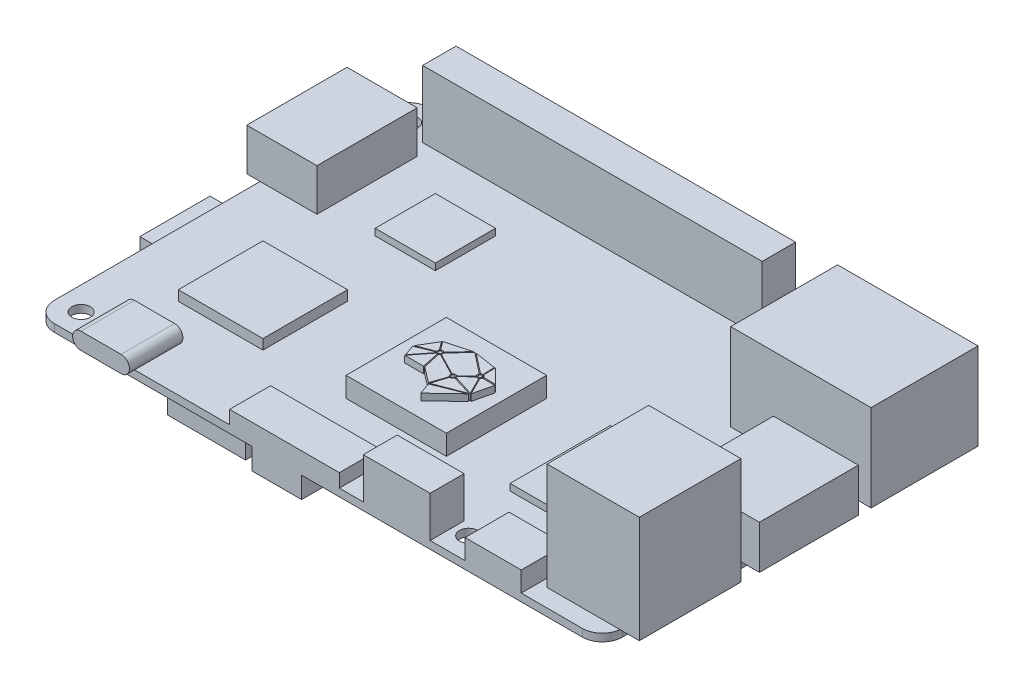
ISO-10303-21;
HEADER;
FILE_DESCRIPTION(('STEP AP214'),'2;1');
FILE_NAME('part.step','',(''),(''),'','','');
FILE_SCHEMA(('AUTOMOTIVE_DESIGN { 1 0 10303 214 1 1 1 1 }'));
ENDSEC;
DATA;
#1=APPLICATION_CONTEXT('core data for automotive mechanical design processes');
#2=APPLICATION_PROTOCOL_DEFINITION('international standard','automotive_design',2000,#1);
#3=PRODUCT_CONTEXT('',#1,'mechanical');
#4=PRODUCT('Part','Part','',(#3));
#5=PRODUCT_RELATED_PRODUCT_CATEGORY('part','',(#4));
#6=PRODUCT_DEFINITION_FORMATION('','',#4);
#7=PRODUCT_DEFINITION_CONTEXT('part definition',#1,'design');
#8=PRODUCT_DEFINITION('design','',#6,#7);
#9=PRODUCT_DEFINITION_SHAPE('','',#8);
#10=(LENGTH_UNIT() NAMED_UNIT(*) SI_UNIT(.MILLI.,.METRE.));
#11=(NAMED_UNIT(*) PLANE_ANGLE_UNIT() SI_UNIT($,.RADIAN.));
#12=(NAMED_UNIT(*) SI_UNIT($,.STERADIAN.) SOLID_ANGLE_UNIT());
#13=UNCERTAINTY_MEASURE_WITH_UNIT(LENGTH_MEASURE(1.E-05),#10,'distance_accuracy_value','');
#14=(GEOMETRIC_REPRESENTATION_CONTEXT(3) GLOBAL_UNCERTAINTY_ASSIGNED_CONTEXT((#13)) GLOBAL_UNIT_ASSIGNED_CONTEXT((#10,
#11,#12)) REPRESENTATION_CONTEXT('',''));
#15=CARTESIAN_POINT('',(0.,0.,0.));
#16=DIRECTION('',(0.,0.,1.));
#17=DIRECTION('',(1.,0.,0.));
#18=AXIS2_PLACEMENT_3D('',#15,#16,#17);
#19=CARTESIAN_POINT('',(0.,4.14,0.));
#20=DIRECTION('',(0.,1.,0.));
#21=DIRECTION('',(0.,0.,1.));
#22=AXIS2_PLACEMENT_3D('',#19,#20,#21);
#23=PLANE('',#22);
#24=CARTESIAN_POINT('',(1.13864724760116,4.14,8.9889394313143));
#25=DIRECTION('',(0.,1.,0.));
#26=DIRECTION('',(0.,0.,1.));
#27=AXIS2_PLACEMENT_3D('',#24,#25,#26);
#28=CIRCLE('',#27,0.223898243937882);
#29=CARTESIAN_POINT('',(1.13864724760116,4.14,9.21283767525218));
#30=VERTEX_POINT('',#29);
#31=EDGE_CURVE('E4242',#30,#30,#28,.T.);
#32=ORIENTED_EDGE('',*,*,#31,.F.);
#33=EDGE_LOOP('',(#32));
#34=FACE_BOUND('',#33,.T.);
#35=CARTESIAN_POINT('',(-2.90106288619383,4.14,6.87145076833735));
#36=DIRECTION('',(0.,1.,0.));
#37=DIRECTION('',(0.,0.,1.));
#38=AXIS2_PLACEMENT_3D('',#35,#36,#37);
#39=CIRCLE('',#38,0.241378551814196);
#40=CARTESIAN_POINT('',(-2.90106288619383,4.14,7.11282932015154));
#41=VERTEX_POINT('',#40);
#42=EDGE_CURVE('E4248',#41,#41,#39,.T.);
#43=ORIENTED_EDGE('',*,*,#42,.F.);
#44=EDGE_LOOP('',(#43));
#45=FACE_BOUND('',#44,.T.);
#46=CARTESIAN_POINT('',(-2.90106288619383,4.14,6.87145076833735));
#47=DIRECTION('',(0.,1.,0.));
#48=DIRECTION('',(0.,0.,1.));
#49=AXIS2_PLACEMENT_3D('',#46,#47,#48);
#50=CIRCLE('',#49,0.418622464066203);
#51=CARTESIAN_POINT('',(-2.64075664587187,4.14,6.54360106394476));
#52=VERTEX_POINT('',#51);
#53=CARTESIAN_POINT('',(-3.15326871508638,4.14,6.53732955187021));
#54=VERTEX_POINT('',#53);
#55=EDGE_CURVE('E1434',#52,#54,#50,.T.);
#56=ORIENTED_EDGE('',*,*,#55,.T.);
#57=DIRECTION('',(0.602466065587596,0.,0.798144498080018));
#58=VECTOR('',#57,1.);
#59=CARTESIAN_POINT('',(-5.15224884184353,4.14,3.88908912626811));
#60=LINE('',#59,#58);
#61=CARTESIAN_POINT('',(-4.10336268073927,4.14,5.27864908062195));
#62=VERTEX_POINT('',#61);
#63=EDGE_CURVE('E1427',#62,#54,#60,.T.);
#64=ORIENTED_EDGE('',*,*,#63,.F.);
#65=DIRECTION('',(-0.964138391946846,0.,0.265400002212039));
#66=VECTOR('',#65,1.);
#67=CARTESIAN_POINT('',(1.06168381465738,4.14,3.85685801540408));
#68=LINE('',#67,#66);
#69=CARTESIAN_POINT('',(-0.502430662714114,4.14,4.28741444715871));
#70=VERTEX_POINT('',#69);
#71=EDGE_CURVE('E1429',#70,#62,#68,.T.);
#72=ORIENTED_EDGE('',*,*,#71,.F.);
#73=DIRECTION('',(0.687894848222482,0.,-0.725810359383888));
#74=VECTOR('',#73,1.);
#75=CARTESIAN_POINT('',(1.87594464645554,4.14,1.77794742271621));
#76=LINE('',#75,#74);
#77=EDGE_CURVE('E1432',#52,#70,#76,.T.);
#78=ORIENTED_EDGE('',*,*,#77,.F.);
#79=EDGE_LOOP('',(#56,#64,#72,#78));
#80=FACE_BOUND('',#79,.T.);
#81=CARTESIAN_POINT('',(3.18731617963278,4.14,6.96266032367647));
#82=DIRECTION('',(0.,1.,0.));
#83=DIRECTION('',(0.,0.,1.));
#84=AXIS2_PLACEMENT_3D('',#81,#82,#83);
#85=CIRCLE('',#84,0.425553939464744);
#86=CARTESIAN_POINT('',(3.60252839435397,4.14,6.86941348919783));
#87=VERTEX_POINT('',#86);
#88=CARTESIAN_POINT('',(3.26138028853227,4.14,6.54360106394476));
#89=VERTEX_POINT('',#88);
#90=EDGE_CURVE('E1463',#87,#89,#85,.T.);
#91=ORIENTED_EDGE('',*,*,#90,.T.);
#92=DIRECTION('',(0.,0.,1.));
#93=VECTOR('',#92,1.);
#94=CARTESIAN_POINT('',(3.26138028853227,4.14,0.));
#95=LINE('',#94,#93);
#96=CARTESIAN_POINT('',(3.26138028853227,4.14,4.78067035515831));
#97=VERTEX_POINT('',#96);
#98=EDGE_CURVE('E1454',#97,#89,#95,.T.);
#99=ORIENTED_EDGE('',*,*,#98,.F.);
#100=DIRECTION('',(-0.707106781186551,0.,-0.707106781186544));
#101=VECTOR('',#100,1.);
#102=CARTESIAN_POINT('',(-0.759645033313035,4.14,0.759645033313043));
#103=LINE('',#102,#101);
#104=CARTESIAN_POINT('',(5.35012342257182,4.14,6.86941348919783));
#105=VERTEX_POINT('',#104);
#106=EDGE_CURVE('E1457',#105,#97,#103,.T.);
#107=ORIENTED_EDGE('',*,*,#106,.F.);
#108=DIRECTION('',(1.,0.,0.));
#109=VECTOR('',#108,1.);
#110=CARTESIAN_POINT('',(0.,4.14,6.86941348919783));
#111=LINE('',#110,#109);
#112=EDGE_CURVE('E1461',#87,#105,#111,.T.);
#113=ORIENTED_EDGE('',*,*,#112,.F.);
#114=EDGE_LOOP('',(#91,#99,#107,#113));
#115=FACE_BOUND('',#114,.T.);
#116=CARTESIAN_POINT('',(3.18731617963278,4.14,6.96266032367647));
#117=DIRECTION('',(0.,1.,0.));
#118=DIRECTION('',(0.,0.,1.));
#119=AXIS2_PLACEMENT_3D('',#116,#117,#118);
#120=CIRCLE('',#119,0.425553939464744);
#121=CARTESIAN_POINT('',(3.18731617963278,4.14,6.53710638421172));
#122=VERTEX_POINT('',#121);
#123=CARTESIAN_POINT('',(2.91535271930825,4.14,6.63535002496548));
#124=VERTEX_POINT('',#123);
#125=EDGE_CURVE('E1492',#122,#124,#120,.T.);
#126=ORIENTED_EDGE('',*,*,#125,.T.);
#127=DIRECTION('',(0.789044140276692,0.,0.614336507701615));
#128=VECTOR('',#127,1.);
#129=CARTESIAN_POINT('',(-2.11612906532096,4.14,2.7179228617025));
#130=LINE('',#129,#128);
#131=CARTESIAN_POINT('',(-0.100298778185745,4.14,4.28741444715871));
#132=VERTEX_POINT('',#131);
#133=EDGE_CURVE('E1483',#132,#124,#130,.T.);
#134=ORIENTED_EDGE('',*,*,#133,.F.);
#135=DIRECTION('',(-0.988474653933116,0.,-0.151386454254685));
#136=VECTOR('',#135,1.);
#137=CARTESIAN_POINT('',(-0.643874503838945,4.14,4.20416496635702));
#138=LINE('',#137,#136);
#139=CARTESIAN_POINT('',(3.12040524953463,4.14,4.78067035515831));
#140=VERTEX_POINT('',#139);
#141=EDGE_CURVE('E1486',#140,#132,#138,.T.);
#142=ORIENTED_EDGE('',*,*,#141,.F.);
#143=DIRECTION('',(-0.0380671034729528,0.,-0.999275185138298));
#144=VECTOR('',#143,1.);
#145=CARTESIAN_POINT('',(2.93402908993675,4.14,-0.111771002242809));
#146=LINE('',#145,#144);
#147=EDGE_CURVE('E1490',#122,#140,#146,.T.);
#148=ORIENTED_EDGE('',*,*,#147,.F.);
#149=EDGE_LOOP('',(#126,#134,#142,#148));
#150=FACE_BOUND('',#149,.T.);
#151=CARTESIAN_POINT('',(3.18731617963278,4.14,6.96266032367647));
#152=DIRECTION('',(0.,1.,0.));
#153=DIRECTION('',(0.,0.,1.));
#154=AXIS2_PLACEMENT_3D('',#151,#152,#153);
#155=CIRCLE('',#154,0.223898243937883);
#156=CARTESIAN_POINT('',(3.18731617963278,4.14,7.18655856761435));
#157=VERTEX_POINT('',#156);
#158=EDGE_CURVE('E1503',#157,#157,#155,.T.);
#159=ORIENTED_EDGE('',*,*,#158,.F.);
#160=EDGE_LOOP('',(#159));
#161=FACE_BOUND('',#160,.T.);
#162=CARTESIAN_POINT('',(3.18731617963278,4.14,6.96266032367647));
#163=DIRECTION('',(0.,1.,0.));
#164=DIRECTION('',(0.,0.,1.));
#165=AXIS2_PLACEMENT_3D('',#162,#163,#164);
#166=CIRCLE('',#165,0.425553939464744);
#167=CARTESIAN_POINT('',(3.45915610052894,4.14,7.29007323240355));
#168=VERTEX_POINT('',#167);
#169=CARTESIAN_POINT('',(3.60252839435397,4.14,7.0559071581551));
#170=VERTEX_POINT('',#169);
#171=EDGE_CURVE('E1527',#168,#170,#166,.T.);
#172=ORIENTED_EDGE('',*,*,#171,.T.);
#173=DIRECTION('',(-1.,0.,0.));
#174=VECTOR('',#173,1.);
#175=CARTESIAN_POINT('',(0.,4.14,7.0559071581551));
#176=LINE('',#175,#174);
#177=CARTESIAN_POINT('',(5.46657780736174,4.14,7.0559071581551));
#178=VERTEX_POINT('',#177);
#179=EDGE_CURVE('E1518',#178,#170,#176,.T.);
#180=ORIENTED_EDGE('',*,*,#179,.F.);
#181=DIRECTION('',(0.234277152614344,0.,-0.972169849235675));
#182=VECTOR('',#181,1.);
#183=CARTESIAN_POINT('',(6.77357394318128,4.14,1.63232136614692));
#184=LINE('',#183,#182);
#185=CARTESIAN_POINT('',(4.78138120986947,4.14,9.89923808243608));
#186=VERTEX_POINT('',#185);
#187=EDGE_CURVE('E1521',#186,#178,#184,.T.);
#188=ORIENTED_EDGE('',*,*,#187,.F.);
#189=DIRECTION('',(0.452032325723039,0.,0.892001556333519));
#190=VECTOR('',#189,1.);
#191=CARTESIAN_POINT('',(-0.18712063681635,4.14,0.0948255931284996));
#192=LINE('',#191,#190);
#193=EDGE_CURVE('E1525',#168,#186,#192,.T.);
#194=ORIENTED_EDGE('',*,*,#193,.F.);
#195=EDGE_LOOP('',(#172,#180,#188,#194));
#196=FACE_BOUND('',#195,.T.);
#197=CARTESIAN_POINT('',(1.13864724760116,4.14,8.9889394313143));
#198=DIRECTION('',(0.,1.,0.));
#199=DIRECTION('',(0.,0.,1.));
#200=AXIS2_PLACEMENT_3D('',#197,#198,#199);
#201=CIRCLE('',#200,0.396116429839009);
#202=CARTESIAN_POINT('',(1.52960811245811,4.14,8.92523834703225));
#203=VERTEX_POINT('',#202);
#204=CARTESIAN_POINT('',(1.47160471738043,4.14,8.77435250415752));
#205=VERTEX_POINT('',#204);
#206=EDGE_CURVE('E1562',#203,#205,#201,.T.);
#207=ORIENTED_EDGE('',*,*,#206,.T.);
#208=DIRECTION('',(-0.729673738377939,0.,0.683795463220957));
#209=VECTOR('',#208,1.);
#210=CARTESIAN_POINT('',(5.0660294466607,4.14,5.40592742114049));
#211=LINE('',#210,#209);
#212=CARTESIAN_POINT('',(2.99810116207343,4.14,7.34383460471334));
#213=VERTEX_POINT('',#212);
#214=EDGE_CURVE('E1550',#213,#205,#211,.T.);
#215=ORIENTED_EDGE('',*,*,#214,.F.);
#216=CARTESIAN_POINT('',(3.18731617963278,4.14,6.96266032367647));
#217=DIRECTION('',(0.,1.,0.));
#218=DIRECTION('',(0.,0.,1.));
#219=AXIS2_PLACEMENT_3D('',#216,#217,#218);
#220=CIRCLE('',#219,0.425553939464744);
#221=CARTESIAN_POINT('',(3.37653119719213,4.14,7.34383460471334));
#222=VERTEX_POINT('',#221);
#223=EDGE_CURVE('E1553',#213,#222,#220,.T.);
#224=ORIENTED_EDGE('',*,*,#223,.T.);
#225=DIRECTION('',(-0.444632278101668,0.,-0.895713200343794));
#226=VECTOR('',#225,1.);
#227=CARTESIAN_POINT('',(-0.215779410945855,4.14,0.107112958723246));
#228=LINE('',#227,#226);
#229=CARTESIAN_POINT('',(4.64503418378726,4.14,9.89923808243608));
#230=VERTEX_POINT('',#229);
#231=EDGE_CURVE('E1557',#230,#222,#228,.T.);
#232=ORIENTED_EDGE('',*,*,#231,.F.);
#233=DIRECTION('',(0.954442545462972,0.,0.298394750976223));
#234=VECTOR('',#233,1.);
#235=CARTESIAN_POINT('',(-2.4057182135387,4.14,7.69490685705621));
#236=LINE('',#235,#234);
#237=EDGE_CURVE('E1560',#203,#230,#236,.T.);
#238=ORIENTED_EDGE('',*,*,#237,.F.);
#239=EDGE_LOOP('',(#207,#215,#224,#232,#238));
#240=FACE_BOUND('',#239,.T.);
#241=CARTESIAN_POINT('',(1.13864724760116,4.14,8.9889394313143));
#242=DIRECTION('',(0.,1.,0.));
#243=DIRECTION('',(0.,0.,1.));
#244=AXIS2_PLACEMENT_3D('',#241,#242,#243);
#245=CIRCLE('',#244,0.396116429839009);
#246=CARTESIAN_POINT('',(1.0523268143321,4.14,9.37553613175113));
#247=VERTEX_POINT('',#246);
#248=CARTESIAN_POINT('',(1.51784848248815,4.14,9.10345864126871));
#249=VERTEX_POINT('',#248);
#250=EDGE_CURVE('E1594',#247,#249,#245,.T.);
#251=ORIENTED_EDGE('',*,*,#250,.T.);
#252=DIRECTION('',(-0.957297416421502,0.,-0.289104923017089));
#253=VECTOR('',#252,1.);
#254=CARTESIAN_POINT('',(-2.39260342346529,4.14,7.92249765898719));
#255=LINE('',#254,#253);
#256=CARTESIAN_POINT('',(4.59598111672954,4.14,10.0330582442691));
#257=VERTEX_POINT('',#256);
#258=EDGE_CURVE('E1585',#257,#249,#255,.T.);
#259=ORIENTED_EDGE('',*,*,#258,.F.);
#260=DIRECTION('',(0.934156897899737,0.,-0.356862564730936));
#261=VECTOR('',#260,1.);
#262=CARTESIAN_POINT('',(3.92997903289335,4.14,10.2874814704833));
#263=LINE('',#262,#261);
#264=CARTESIAN_POINT('',(0.318880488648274,4.14,11.6669776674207));
#265=VERTEX_POINT('',#264);
#266=EDGE_CURVE('E1588',#265,#257,#263,.T.);
#267=ORIENTED_EDGE('',*,*,#266,.F.);
#268=DIRECTION('',(-0.304845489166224,0.,0.952401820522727));
#269=VECTOR('',#268,1.);
#270=CARTESIAN_POINT('',(3.67658329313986,4.14,1.17680353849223));
#271=LINE('',#270,#269);
#272=EDGE_CURVE('E1592',#247,#265,#271,.T.);
#273=ORIENTED_EDGE('',*,*,#272,.F.);
#274=EDGE_LOOP('',(#251,#259,#267,#273));
#275=FACE_BOUND('',#274,.T.);
#276=CARTESIAN_POINT('',(1.13864724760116,4.14,8.9889394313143));
#277=DIRECTION('',(0.,1.,0.));
#278=DIRECTION('',(0.,0.,1.));
#279=AXIS2_PLACEMENT_3D('',#276,#277,#278);
#280=CIRCLE('',#279,0.396116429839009);
#281=CARTESIAN_POINT('',(0.762609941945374,4.14,8.86442368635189));
#282=VERTEX_POINT('',#281);
#283=CARTESIAN_POINT('',(0.94536105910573,4.14,9.33469754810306));
#284=VERTEX_POINT('',#283);
#285=EDGE_CURVE('E1633',#282,#284,#280,.T.);
#286=ORIENTED_EDGE('',*,*,#285,.T.);
#287=DIRECTION('',(0.318943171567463,0.,-0.947773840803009));
#288=VECTOR('',#287,1.);
#289=CARTESIAN_POINT('',(3.67094277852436,4.14,1.23533915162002));
#290=LINE('',#289,#288);
#291=CARTESIAN_POINT('',(0.160506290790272,4.14,11.6669776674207));
#292=VERTEX_POINT('',#291);
#293=EDGE_CURVE('E1618',#292,#284,#290,.T.);
#294=ORIENTED_EDGE('',*,*,#293,.F.);
#295=DIRECTION('',(0.797327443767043,0.,0.603546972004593));
#296=VECTOR('',#295,1.);
#297=CARTESIAN_POINT('',(-5.55596878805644,4.14,7.3398204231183));
#298=LINE('',#297,#296);
#299=CARTESIAN_POINT('',(-2.17480040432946,4.14,9.89923808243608));
#300=VERTEX_POINT('',#299);
#301=EDGE_CURVE('E1621',#300,#292,#298,.T.);
#302=ORIENTED_EDGE('',*,*,#301,.F.);
#303=DIRECTION('',(0.212799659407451,0.,0.977095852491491));
#304=VECTOR('',#303,1.);
#305=CARTESIAN_POINT('',(-4.13462306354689,4.14,0.900470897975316));
#306=LINE('',#305,#304);
#307=CARTESIAN_POINT('',(-2.7492512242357,4.14,7.2615763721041));
#308=VERTEX_POINT('',#307);
#309=EDGE_CURVE('E1625',#308,#300,#306,.T.);
#310=ORIENTED_EDGE('',*,*,#309,.F.);
#311=CARTESIAN_POINT('',(-2.90106288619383,4.14,6.87145076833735));
#312=DIRECTION('',(0.,1.,0.));
#313=DIRECTION('',(0.,0.,1.));
#314=AXIS2_PLACEMENT_3D('',#311,#312,#313);
#315=CIRCLE('',#314,0.418622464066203);
#316=CARTESIAN_POINT('',(-2.5788681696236,4.14,7.13872465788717));
#317=VERTEX_POINT('',#316);
#318=EDGE_CURVE('E1627',#308,#317,#315,.T.);
#319=ORIENTED_EDGE('',*,*,#318,.T.);
#320=DIRECTION('',(-0.888505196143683,0.,-0.458866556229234));
#321=VECTOR('',#320,1.);
#322=CARTESIAN_POINT('',(-3.45349867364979,4.14,6.68702365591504));
#323=LINE('',#322,#321);
#324=EDGE_CURVE('E1630',#282,#317,#323,.T.);
#325=ORIENTED_EDGE('',*,*,#324,.F.);
#326=EDGE_LOOP('',(#286,#294,#302,#310,#319,#325));
#327=FACE_BOUND('',#326,.T.);
#328=CARTESIAN_POINT('',(1.13864724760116,4.14,8.9889394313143));
#329=DIRECTION('',(0.,1.,0.));
#330=DIRECTION('',(0.,0.,1.));
#331=AXIS2_PLACEMENT_3D('',#328,#329,#330);
#332=CIRCLE('',#331,0.396116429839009);
#333=CARTESIAN_POINT('',(1.36830575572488,4.14,8.66619309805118));
#334=VERTEX_POINT('',#333);
#335=CARTESIAN_POINT('',(0.805689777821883,4.14,8.77435250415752));
#336=VERTEX_POINT('',#335);
#337=EDGE_CURVE('E1683',#334,#336,#332,.T.);
#338=ORIENTED_EDGE('',*,*,#337,.T.);
#339=DIRECTION('',(0.88870322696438,0.,0.458482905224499));
#340=VECTOR('',#339,1.);
#341=CARTESIAN_POINT('',(-3.4057945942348,4.14,6.60164340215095));
#342=LINE('',#341,#340);
#343=CARTESIAN_POINT('',(-2.52526958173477,4.14,7.05590715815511));
#344=VERTEX_POINT('',#343);
#345=EDGE_CURVE('E1665',#344,#336,#342,.T.);
#346=ORIENTED_EDGE('',*,*,#345,.F.);
#347=CARTESIAN_POINT('',(-2.90106288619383,4.14,6.87145076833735));
#348=DIRECTION('',(0.,1.,0.));
#349=DIRECTION('',(0.,0.,1.));
#350=AXIS2_PLACEMENT_3D('',#347,#348,#349);
#351=CIRCLE('',#350,0.418622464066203);
#352=CARTESIAN_POINT('',(-2.52947934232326,4.14,6.67865440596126));
#353=VERTEX_POINT('',#352);
#354=EDGE_CURVE('E1668',#344,#353,#351,.T.);
#355=ORIENTED_EDGE('',*,*,#354,.T.);
#356=DIRECTION('',(-0.684216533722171,0.,0.729278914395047));
#357=VECTOR('',#356,1.);
#358=CARTESIAN_POINT('',(1.9872484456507,4.14,1.8644557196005));
#359=LINE('',#358,#357);
#360=CARTESIAN_POINT('',(-0.285994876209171,4.14,4.2874144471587));
#361=VERTEX_POINT('',#360);
#362=EDGE_CURVE('E1672',#361,#353,#359,.T.);
#363=ORIENTED_EDGE('',*,*,#362,.F.);
#364=DIRECTION('',(-0.785696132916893,0.,-0.618612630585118));
#365=VECTOR('',#364,1.);
#366=CARTESIAN_POINT('',(-2.1933065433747,4.14,2.78570527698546));
#367=LINE('',#366,#365);
#368=CARTESIAN_POINT('',(2.82608826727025,4.14,6.73769243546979));
#369=VERTEX_POINT('',#368);
#370=EDGE_CURVE('E1675',#369,#361,#367,.T.);
#371=ORIENTED_EDGE('',*,*,#370,.F.);
#372=CARTESIAN_POINT('',(3.18731617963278,4.14,6.96266032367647));
#373=DIRECTION('',(0.,1.,0.));
#374=DIRECTION('',(0.,0.,1.));
#375=AXIS2_PLACEMENT_3D('',#372,#373,#374);
#376=CIRCLE('',#375,0.425553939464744);
#377=CARTESIAN_POINT('',(2.88442122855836,4.14,7.2615763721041));
#378=VERTEX_POINT('',#377);
#379=EDGE_CURVE('E1677',#369,#378,#376,.T.);
#380=ORIENTED_EDGE('',*,*,#379,.T.);
#381=DIRECTION('',(0.733566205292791,0.,-0.67961799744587));
#382=VECTOR('',#381,1.);
#383=CARTESIAN_POINT('',(4.95247937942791,4.14,5.34560814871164));
#384=LINE('',#383,#382);
#385=EDGE_CURVE('E1680',#334,#378,#384,.T.);
#386=ORIENTED_EDGE('',*,*,#385,.F.);
#387=EDGE_LOOP('',(#338,#346,#355,#363,#371,#380,#386));
#388=FACE_BOUND('',#387,.T.);
#389=CARTESIAN_POINT('',(-2.90106288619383,4.14,6.87145076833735));
#390=DIRECTION('',(0.,1.,0.));
#391=DIRECTION('',(0.,0.,1.));
#392=AXIS2_PLACEMENT_3D('',#389,#390,#391);
#393=CIRCLE('',#392,0.418622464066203);
#394=CARTESIAN_POINT('',(-3.24675235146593,4.14,6.63535002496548));
#395=VERTEX_POINT('',#394);
#396=CARTESIAN_POINT('',(-3.29343603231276,4.14,7.01735512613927));
#397=VERTEX_POINT('',#396);
#398=EDGE_CURVE('E1720',#395,#397,#393,.T.);
#399=ORIENTED_EDGE('',*,*,#398,.T.);
#400=DIRECTION('',(0.937295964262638,0.,-0.348534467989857));
#401=VECTOR('',#400,1.);
#402=CARTESIAN_POINT('',(1.89235488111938,4.14,5.08901344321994));
#403=LINE('',#402,#401);
#404=CARTESIAN_POINT('',(-5.66929435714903,4.14,7.90082048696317));
#405=VERTEX_POINT('',#404);
#406=EDGE_CURVE('E1711',#405,#397,#403,.T.);
#407=ORIENTED_EDGE('',*,*,#406,.F.);
#408=DIRECTION('',(-0.506493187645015,0.,0.862243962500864));
#409=VECTOR('',#408,1.);
#410=CARTESIAN_POINT('',(-0.764468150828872,4.14,-0.449058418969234));
#411=LINE('',#410,#409);
#412=CARTESIAN_POINT('',(-4.18521296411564,4.14,5.37434974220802));
#413=VERTEX_POINT('',#412);
#414=EDGE_CURVE('E1714',#413,#405,#411,.T.);
#415=ORIENTED_EDGE('',*,*,#414,.F.);
#416=DIRECTION('',(-0.597027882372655,0.,-0.802220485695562));
#417=VECTOR('',#416,1.);
#418=CARTESIAN_POINT('',(-5.26746010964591,4.14,3.92014491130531));
#419=LINE('',#418,#417);
#420=EDGE_CURVE('E1718',#395,#413,#419,.T.);
#421=ORIENTED_EDGE('',*,*,#420,.F.);
#422=EDGE_LOOP('',(#399,#407,#415,#421));
#423=FACE_BOUND('',#422,.T.);
#424=CARTESIAN_POINT('',(-2.90106288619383,4.14,6.87145076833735));
#425=DIRECTION('',(0.,1.,0.));
#426=DIRECTION('',(0.,0.,1.));
#427=AXIS2_PLACEMENT_3D('',#424,#425,#426);
#428=CIRCLE('',#427,0.418622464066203);
#429=CARTESIAN_POINT('',(-3.24675235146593,4.14,7.10755151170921));
#430=VERTEX_POINT('',#429);
#431=CARTESIAN_POINT('',(-3.1594771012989,4.14,7.2007938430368));
#432=VERTEX_POINT('',#431);
#433=EDGE_CURVE('E1749',#430,#432,#428,.T.);
#434=ORIENTED_EDGE('',*,*,#433,.T.);
#435=DIRECTION('',(0.617296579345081,0.,-0.786730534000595));
#436=VECTOR('',#435,1.);
#437=CARTESIAN_POINT('',(1.54149486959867,4.14,1.20951134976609));
#438=LINE('',#437,#436);
#439=CARTESIAN_POINT('',(-5.17109226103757,4.14,9.76455188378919));
#440=VERTEX_POINT('',#439);
#441=EDGE_CURVE('E1740',#440,#432,#438,.T.);
#442=ORIENTED_EDGE('',*,*,#441,.F.);
#443=DIRECTION('',(0.337324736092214,0.,0.941388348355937));
#444=VECTOR('',#443,1.);
#445=CARTESIAN_POINT('',(-7.68345250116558,4.14,2.7531874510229));
#446=LINE('',#445,#444);
#447=CARTESIAN_POINT('',(-5.75944685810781,4.14,8.12260244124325));
#448=VERTEX_POINT('',#447);
#449=EDGE_CURVE('E1743',#448,#440,#446,.T.);
#450=ORIENTED_EDGE('',*,*,#449,.F.);
#451=DIRECTION('',(-0.927202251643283,0.,0.374561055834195));
#452=VECTOR('',#451,1.);
#453=CARTESIAN_POINT('',(2.0129026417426,4.14,4.98281343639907));
#454=LINE('',#453,#452);
#455=EDGE_CURVE('E1747',#430,#448,#454,.T.);
#456=ORIENTED_EDGE('',*,*,#455,.F.);
#457=EDGE_LOOP('',(#434,#442,#450,#456));
#458=FACE_BOUND('',#457,.T.);
#459=CARTESIAN_POINT('',(-2.90106288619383,4.14,6.87145076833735));
#460=DIRECTION('',(0.,1.,0.));
#461=DIRECTION('',(0.,0.,1.));
#462=AXIS2_PLACEMENT_3D('',#459,#460,#461);
#463=CIRCLE('',#462,0.418622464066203);
#464=CARTESIAN_POINT('',(-3.07948756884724,4.14,7.2501451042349));
#465=VERTEX_POINT('',#464);
#466=CARTESIAN_POINT('',(-2.90106288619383,4.14,7.29007323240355));
#467=VERTEX_POINT('',#466);
#468=EDGE_CURVE('E1752',#465,#467,#463,.T.);
#469=ORIENTED_EDGE('',*,*,#468,.T.);
#470=DIRECTION('',(-0.207733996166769,0.,-0.97818535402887));
#471=VECTOR('',#470,1.);
#472=CARTESIAN_POINT('',(-4.25723215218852,4.14,0.904094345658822));
#473=LINE('',#472,#471);
#474=CARTESIAN_POINT('',(-2.34696315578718,4.14,9.89923808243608));
#475=VERTEX_POINT('',#474);
#476=EDGE_CURVE('E1764',#475,#467,#473,.T.);
#477=ORIENTED_EDGE('',*,*,#476,.F.);
#478=DIRECTION('',(1.,0.,0.));
#479=VECTOR('',#478,1.);
#480=CARTESIAN_POINT('',(0.,4.14,9.89923808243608));
#481=LINE('',#480,#479);
#482=CARTESIAN_POINT('',(-5.16391439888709,4.14,9.89923808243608));
#483=VERTEX_POINT('',#482);
#484=EDGE_CURVE('E1775',#483,#475,#481,.T.);
#485=ORIENTED_EDGE('',*,*,#484,.F.);
#486=DIRECTION('',(-0.618371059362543,0.,0.785886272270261));
#487=VECTOR('',#486,1.);
#488=CARTESIAN_POINT('',(1.62140354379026,4.14,1.27579404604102));
#489=LINE('',#488,#487);
#490=EDGE_CURVE('E1773',#465,#483,#489,.T.);
#491=ORIENTED_EDGE('',*,*,#490,.F.);
#492=EDGE_LOOP('',(#469,#477,#485,#491));
#493=FACE_BOUND('',#492,.T.);
#494=DIRECTION('',(0.,0.,1.));
#495=VECTOR('',#494,1.);
#496=CARTESIAN_POINT('',(-7.96,4.14,0.880000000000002));
#497=LINE('',#496,#495);
#498=CARTESIAN_POINT('',(-7.96,4.14,0.880000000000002));
#499=VERTEX_POINT('',#498);
#500=CARTESIAN_POINT('',(-7.96,4.14,15.88));
#501=VERTEX_POINT('',#500);
#502=EDGE_CURVE('E1855',#499,#501,#497,.T.);
#503=ORIENTED_EDGE('',*,*,#502,.T.);
#504=DIRECTION('',(1.,0.,0.));
#505=VECTOR('',#504,1.);
#506=CARTESIAN_POINT('',(-7.96,4.14,15.88));
#507=LINE('',#506,#505);
#508=CARTESIAN_POINT('',(7.04,4.14,15.88));
#509=VERTEX_POINT('',#508);
#510=EDGE_CURVE('E1858',#501,#509,#507,.T.);
#511=ORIENTED_EDGE('',*,*,#510,.T.);
#512=DIRECTION('',(0.,0.,-1.));
#513=VECTOR('',#512,1.);
#514=CARTESIAN_POINT('',(7.04,4.14,0.880000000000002));
#515=LINE('',#514,#513);
#516=CARTESIAN_POINT('',(7.04,4.14,0.880000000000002));
#517=VERTEX_POINT('',#516);
#518=EDGE_CURVE('E1861',#509,#517,#515,.T.);
#519=ORIENTED_EDGE('',*,*,#518,.T.);
#520=DIRECTION('',(-1.,0.,0.));
#521=VECTOR('',#520,1.);
#522=CARTESIAN_POINT('',(-7.96,4.14,0.880000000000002));
#523=LINE('',#522,#521);
#524=EDGE_CURVE('E1863',#517,#499,#523,.T.);
#525=ORIENTED_EDGE('',*,*,#524,.T.);
#526=EDGE_LOOP('',(#503,#511,#519,#525));
#527=FACE_BOUND('',#526,.T.);
#528=DIRECTION('',(0.72505223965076,0.,-0.688693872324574));
#529=VECTOR('',#528,1.);
#530=CARTESIAN_POINT('',(7.23625994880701,4.14,7.61828541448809));
#531=LINE('',#530,#529);
#532=CARTESIAN_POINT('',(0.94536105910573,4.14,13.5937217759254));
#533=VERTEX_POINT('',#532);
#534=CARTESIAN_POINT('',(4.59598111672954,4.14,10.1261651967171));
#535=VERTEX_POINT('',#534);
#536=EDGE_CURVE('E1400',#533,#535,#531,.T.);
#537=ORIENTED_EDGE('',*,*,#536,.F.);
#538=DIRECTION('',(0.336889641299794,0.,0.941544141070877));
#539=VECTOR('',#538,1.);
#540=CARTESIAN_POINT('',(-3.47381287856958,4.14,1.24294924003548));
#541=LINE('',#540,#539);
#542=CARTESIAN_POINT('',(0.318880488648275,4.14,11.8428246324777));
#543=VERTEX_POINT('',#542);
#544=EDGE_CURVE('E1407',#543,#533,#541,.T.);
#545=ORIENTED_EDGE('',*,*,#544,.F.);
#546=DIRECTION('',(-0.928040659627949,0.,0.372478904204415));
#547=VECTOR('',#546,1.);
#548=CARTESIAN_POINT('',(4.13801678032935,4.14,10.309974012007));
#549=LINE('',#548,#547);
#550=EDGE_CURVE('E1392',#535,#543,#549,.T.);
#551=ORIENTED_EDGE('',*,*,#550,.F.);
#552=EDGE_LOOP('',(#537,#545,#551));
#553=FACE_BOUND('',#552,.T.);
#554=ADVANCED_FACE('F569',(#34,#45,#80,#115,#150,#161,#196,#240,#275,#327,#388,#423,#458,#493,
#527,#553),#23,.T.);
#555=CARTESIAN_POINT('',(0.,1.14,0.));
#556=DIRECTION('',(0.,-1.,0.));
#557=DIRECTION('',(0.,0.,-1.));
#558=AXIS2_PLACEMENT_3D('',#555,#556,#557);
#559=PLANE('',#558);
#560=DIRECTION('',(0.,0.,1.));
#561=VECTOR('',#560,1.);
#562=CARTESIAN_POINT('',(16.31,1.14,0.610000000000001));
#563=LINE('',#562,#561);
#564=CARTESIAN_POINT('',(16.31,1.14,0.610000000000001));
#565=VERTEX_POINT('',#564);
#566=CARTESIAN_POINT('',(16.31,1.14,15.61));
#567=VERTEX_POINT('',#566);
#568=EDGE_CURVE('E1821',#565,#567,#563,.T.);
#569=ORIENTED_EDGE('',*,*,#568,.F.);
#570=DIRECTION('',(-1.,0.,0.));
#571=VECTOR('',#570,1.);
#572=CARTESIAN_POINT('',(16.31,1.14,0.610000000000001));
#573=LINE('',#572,#571);
#574=CARTESIAN_POINT('',(26.31,1.14,0.610000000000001));
#575=VERTEX_POINT('',#574);
#576=EDGE_CURVE('E1826',#575,#565,#573,.T.);
#577=ORIENTED_EDGE('',*,*,#576,.F.);
#578=DIRECTION('',(0.,0.,-1.));
#579=VECTOR('',#578,1.);
#580=CARTESIAN_POINT('',(26.31,1.14,0.610000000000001));
#581=LINE('',#580,#579);
#582=CARTESIAN_POINT('',(26.31,1.14,15.61));
#583=VERTEX_POINT('',#582);
#584=EDGE_CURVE('E1838',#583,#575,#581,.T.);
#585=ORIENTED_EDGE('',*,*,#584,.F.);
#586=DIRECTION('',(1.,0.,0.));
#587=VECTOR('',#586,1.);
#588=CARTESIAN_POINT('',(16.31,1.14,15.61));
#589=LINE('',#588,#587);
#590=EDGE_CURVE('E1835',#567,#583,#589,.T.);
#591=ORIENTED_EDGE('',*,*,#590,.F.);
#592=EDGE_LOOP('',(#569,#577,#585,#591));
#593=FACE_BOUND('',#592,.T.);
#594=DIRECTION('',(0.,0.,1.));
#595=VECTOR('',#594,1.);
#596=CARTESIAN_POINT('',(-33.1,1.14,3.18));
#597=LINE('',#596,#595);
#598=CARTESIAN_POINT('',(-33.1,1.14,3.18));
#599=VERTEX_POINT('',#598);
#600=CARTESIAN_POINT('',(-33.1,1.14,15.84));
#601=VERTEX_POINT('',#600);
#602=EDGE_CURVE('E1887',#599,#601,#597,.T.);
#603=ORIENTED_EDGE('',*,*,#602,.F.);
#604=DIRECTION('',(-1.,0.,0.));
#605=VECTOR('',#604,1.);
#606=CARTESIAN_POINT('',(-33.1,1.14,3.18));
#607=LINE('',#606,#605);
#608=CARTESIAN_POINT('',(-20.44,1.14,3.18));
#609=VERTEX_POINT('',#608);
#610=EDGE_CURVE('E1892',#609,#599,#607,.T.);
#611=ORIENTED_EDGE('',*,*,#610,.F.);
#612=DIRECTION('',(0.,0.,-1.));
#613=VECTOR('',#612,1.);
#614=CARTESIAN_POINT('',(-20.44,1.14,3.18));
#615=LINE('',#614,#613);
#616=CARTESIAN_POINT('',(-20.44,1.14,15.84));
#617=VERTEX_POINT('',#616);
#618=EDGE_CURVE('E1904',#617,#609,#615,.T.);
#619=ORIENTED_EDGE('',*,*,#618,.F.);
#620=DIRECTION('',(1.,0.,0.));
#621=VECTOR('',#620,1.);
#622=CARTESIAN_POINT('',(-33.1,1.14,15.84));
#623=LINE('',#622,#621);
#624=EDGE_CURVE('E1901',#601,#617,#623,.T.);
#625=ORIENTED_EDGE('',*,*,#624,.F.);
#626=EDGE_LOOP('',(#603,#611,#619,#625));
#627=FACE_BOUND('',#626,.T.);
#628=CARTESIAN_POINT('',(19.,1.14,-24.5));
#629=DIRECTION('',(0.,1.,0.));
#630=DIRECTION('',(0.,0.,1.));
#631=AXIS2_PLACEMENT_3D('',#628,#629,#630);
#632=CIRCLE('',#631,1.38);
#633=CARTESIAN_POINT('',(19.,1.14,-23.12));
#634=VERTEX_POINT('',#633);
#635=EDGE_CURVE('E2230',#634,#634,#632,.T.);
#636=ORIENTED_EDGE('',*,*,#635,.F.);
#637=EDGE_LOOP('',(#636));
#638=FACE_BOUND('',#637,.T.);
#639=CARTESIAN_POINT('',(-38.9871210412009,1.14,24.4999983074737));
#640=DIRECTION('',(0.,1.,0.));
#641=DIRECTION('',(0.,0.,1.));
#642=AXIS2_PLACEMENT_3D('',#639,#640,#641);
#643=CIRCLE('',#642,1.38);
#644=CARTESIAN_POINT('',(-38.9871210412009,1.14,25.8799983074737));
#645=VERTEX_POINT('',#644);
#646=EDGE_CURVE('E2223',#645,#645,#643,.T.);
#647=ORIENTED_EDGE('',*,*,#646,.F.);
#648=EDGE_LOOP('',(#647));
#649=FACE_BOUND('',#648,.T.);
#650=CARTESIAN_POINT('',(19.,1.14,24.5));
#651=DIRECTION('',(0.,1.,0.));
#652=DIRECTION('',(0.,0.,1.));
#653=AXIS2_PLACEMENT_3D('',#650,#651,#652);
#654=CIRCLE('',#653,1.38);
#655=CARTESIAN_POINT('',(19.,1.14,25.88));
#656=VERTEX_POINT('',#655);
#657=EDGE_CURVE('E2219',#656,#656,#654,.T.);
#658=ORIENTED_EDGE('',*,*,#657,.F.);
#659=EDGE_LOOP('',(#658));
#660=FACE_BOUND('',#659,.T.);
#661=CARTESIAN_POINT('',(-39.,1.14,-24.5));
#662=DIRECTION('',(0.,1.,0.));
#663=DIRECTION('',(0.,0.,1.));
#664=AXIS2_PLACEMENT_3D('',#661,#662,#663);
#665=CIRCLE('',#664,1.38);
#666=CARTESIAN_POINT('',(-39.,1.14,-23.12));
#667=VERTEX_POINT('',#666);
#668=EDGE_CURVE('E2229',#667,#667,#665,.T.);
#669=ORIENTED_EDGE('',*,*,#668,.F.);
#670=EDGE_LOOP('',(#669));
#671=FACE_BOUND('',#670,.T.);
#672=DIRECTION('',(0.,0.,1.));
#673=VECTOR('',#672,1.);
#674=CARTESIAN_POINT('',(21.96,1.14,21.42));
#675=LINE('',#674,#673);
#676=CARTESIAN_POINT('',(21.96,1.14,21.42));
#677=VERTEX_POINT('',#676);
#678=CARTESIAN_POINT('',(21.96,1.14,28.));
#679=VERTEX_POINT('',#678);
#680=EDGE_CURVE('E1920',#677,#679,#675,.T.);
#681=ORIENTED_EDGE('',*,*,#680,.F.);
#682=DIRECTION('',(-1.,0.,0.));
#683=VECTOR('',#682,1.);
#684=CARTESIAN_POINT('',(21.96,1.14,21.42));
#685=LINE('',#684,#683);
#686=CARTESIAN_POINT('',(30.36,1.14,21.42));
#687=VERTEX_POINT('',#686);
#688=EDGE_CURVE('E1925',#687,#677,#685,.T.);
#689=ORIENTED_EDGE('',*,*,#688,.F.);
#690=DIRECTION('',(0.,0.,-1.));
#691=VECTOR('',#690,1.);
#692=CARTESIAN_POINT('',(30.36,1.14,21.42));
#693=LINE('',#692,#691);
#694=CARTESIAN_POINT('',(30.36,1.14,28.));
#695=VERTEX_POINT('',#694);
#696=EDGE_CURVE('E1934',#695,#687,#693,.T.);
#697=ORIENTED_EDGE('',*,*,#696,.F.);
#698=DIRECTION('',(1.,0.,0.));
#699=VECTOR('',#698,1.);
#700=CARTESIAN_POINT('',(-42.5,1.14,28.));
#701=LINE('',#700,#699);
#702=CARTESIAN_POINT('',(39.5,1.14,28.));
#703=VERTEX_POINT('',#702);
#704=EDGE_CURVE('E2361',#695,#703,#701,.T.);
#705=ORIENTED_EDGE('',*,*,#704,.T.);
#706=CARTESIAN_POINT('',(39.5,1.14,25.));
#707=DIRECTION('',(0.,-1.,0.));
#708=DIRECTION('',(0.,0.,-1.));
#709=AXIS2_PLACEMENT_3D('',#706,#707,#708);
#710=CIRCLE('',#709,3.);
#711=CARTESIAN_POINT('',(42.4806710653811,1.14,25.34));
#712=VERTEX_POINT('',#711);
#713=EDGE_CURVE('E2403',#703,#712,#710,.F.);
#714=ORIENTED_EDGE('',*,*,#713,.T.);
#715=DIRECTION('',(1.,0.,0.));
#716=VECTOR('',#715,1.);
#717=CARTESIAN_POINT('',(31.57,1.14,25.34));
#718=LINE('',#717,#716);
#719=CARTESIAN_POINT('',(31.57,1.14,25.34));
#720=VERTEX_POINT('',#719);
#721=EDGE_CURVE('E2319',#720,#712,#718,.T.);
#722=ORIENTED_EDGE('',*,*,#721,.F.);
#723=DIRECTION('',(0.,0.,1.));
#724=VECTOR('',#723,1.);
#725=CARTESIAN_POINT('',(31.57,1.14,10.14));
#726=LINE('',#725,#724);
#727=CARTESIAN_POINT('',(31.57,1.14,10.14));
#728=VERTEX_POINT('',#727);
#729=EDGE_CURVE('E2331',#728,#720,#726,.T.);
#730=ORIENTED_EDGE('',*,*,#729,.F.);
#731=DIRECTION('',(-1.,0.,0.));
#732=VECTOR('',#731,1.);
#733=CARTESIAN_POINT('',(31.57,1.14,10.14));
#734=LINE('',#733,#732);
#735=CARTESIAN_POINT('',(42.5,1.14,10.14));
#736=VERTEX_POINT('',#735);
#737=EDGE_CURVE('E577',#736,#728,#734,.T.);
#738=ORIENTED_EDGE('',*,*,#737,.F.);
#739=DIRECTION('',(0.,0.,-1.));
#740=VECTOR('',#739,1.);
#741=CARTESIAN_POINT('',(42.5,1.14,28.));
#742=LINE('',#741,#740);
#743=CARTESIAN_POINT('',(42.5,1.14,7.5));
#744=VERTEX_POINT('',#743);
#745=EDGE_CURVE('E2353',#736,#744,#742,.T.);
#746=ORIENTED_EDGE('',*,*,#745,.T.);
#747=DIRECTION('',(1.,0.,0.));
#748=VECTOR('',#747,1.);
#749=CARTESIAN_POINT('',(32.8041222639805,1.14,7.5));
#750=LINE('',#749,#748);
#751=CARTESIAN_POINT('',(32.8041222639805,1.14,7.5));
#752=VERTEX_POINT('',#751);
#753=EDGE_CURVE('E2295',#752,#744,#750,.T.);
#754=ORIENTED_EDGE('',*,*,#753,.F.);
#755=DIRECTION('',(0.,0.,1.));
#756=VECTOR('',#755,1.);
#757=CARTESIAN_POINT('',(32.8041222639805,1.14,-7.3));
#758=LINE('',#757,#756);
#759=CARTESIAN_POINT('',(32.8041222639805,1.14,-7.3));
#760=VERTEX_POINT('',#759);
#761=EDGE_CURVE('E2280',#760,#752,#758,.T.);
#762=ORIENTED_EDGE('',*,*,#761,.F.);
#763=DIRECTION('',(-1.,0.,0.));
#764=VECTOR('',#763,1.);
#765=CARTESIAN_POINT('',(32.8041222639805,1.14,-7.3));
#766=LINE('',#765,#764);
#767=CARTESIAN_POINT('',(42.5,1.14,-7.3));
#768=VERTEX_POINT('',#767);
#769=EDGE_CURVE('E2300',#768,#760,#766,.T.);
#770=ORIENTED_EDGE('',*,*,#769,.F.);
#771=CARTESIAN_POINT('',(42.5,1.14,-9.2));
#772=VERTEX_POINT('',#771);
#773=EDGE_CURVE('E2354',#768,#772,#742,.T.);
#774=ORIENTED_EDGE('',*,*,#773,.T.);
#775=DIRECTION('',(1.,0.,0.));
#776=VECTOR('',#775,1.);
#777=CARTESIAN_POINT('',(24.5,1.14,-9.2));
#778=LINE('',#777,#776);
#779=CARTESIAN_POINT('',(24.5,1.14,-9.2));
#780=VERTEX_POINT('',#779);
#781=EDGE_CURVE('E2258',#780,#772,#778,.T.);
#782=ORIENTED_EDGE('',*,*,#781,.F.);
#783=DIRECTION('',(0.,0.,1.));
#784=VECTOR('',#783,1.);
#785=CARTESIAN_POINT('',(24.5,1.14,-25.2));
#786=LINE('',#785,#784);
#787=CARTESIAN_POINT('',(24.5,1.14,-25.2));
#788=VERTEX_POINT('',#787);
#789=EDGE_CURVE('E2241',#788,#780,#786,.T.);
#790=ORIENTED_EDGE('',*,*,#789,.F.);
#791=DIRECTION('',(-1.,0.,0.));
#792=VECTOR('',#791,1.);
#793=CARTESIAN_POINT('',(24.5,1.14,-25.2));
#794=LINE('',#793,#792);
#795=CARTESIAN_POINT('',(42.4933259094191,1.14,-25.2));
#796=VERTEX_POINT('',#795);
#797=EDGE_CURVE('E2263',#796,#788,#794,.T.);
#798=ORIENTED_EDGE('',*,*,#797,.F.);
#799=CARTESIAN_POINT('',(39.5,1.14,-25.));
#800=DIRECTION('',(0.,-1.,0.));
#801=DIRECTION('',(0.,0.,-1.));
#802=AXIS2_PLACEMENT_3D('',#799,#800,#801);
#803=CIRCLE('',#802,3.);
#804=CARTESIAN_POINT('',(39.5,1.14,-28.));
#805=VERTEX_POINT('',#804);
#806=EDGE_CURVE('E2406',#796,#805,#803,.F.);
#807=ORIENTED_EDGE('',*,*,#806,.T.);
#808=DIRECTION('',(-1.,0.,0.));
#809=VECTOR('',#808,1.);
#810=CARTESIAN_POINT('',(-42.5,1.14,-28.));
#811=LINE('',#810,#809);
#812=CARTESIAN_POINT('',(15.41,1.14,-28.));
#813=VERTEX_POINT('',#812);
#814=EDGE_CURVE('E2355',#805,#813,#811,.T.);
#815=ORIENTED_EDGE('',*,*,#814,.T.);
#816=DIRECTION('',(0.,0.,-1.));
#817=VECTOR('',#816,1.);
#818=CARTESIAN_POINT('',(15.41,1.14,-28.));
#819=LINE('',#818,#817);
#820=CARTESIAN_POINT('',(15.41,1.14,-23.));
#821=VERTEX_POINT('',#820);
#822=EDGE_CURVE('E2194',#821,#813,#819,.T.);
#823=ORIENTED_EDGE('',*,*,#822,.F.);
#824=DIRECTION('',(1.,0.,0.));
#825=VECTOR('',#824,1.);
#826=CARTESIAN_POINT('',(-35.39,1.14,-23.));
#827=LINE('',#826,#825);
#828=CARTESIAN_POINT('',(-35.39,1.14,-23.));
#829=VERTEX_POINT('',#828);
#830=EDGE_CURVE('E2203',#829,#821,#827,.T.);
#831=ORIENTED_EDGE('',*,*,#830,.F.);
#832=DIRECTION('',(0.,0.,1.));
#833=VECTOR('',#832,1.);
#834=CARTESIAN_POINT('',(-35.39,1.14,-28.));
#835=LINE('',#834,#833);
#836=CARTESIAN_POINT('',(-35.39,1.14,-28.));
#837=VERTEX_POINT('',#836);
#838=EDGE_CURVE('E2189',#837,#829,#835,.T.);
#839=ORIENTED_EDGE('',*,*,#838,.F.);
#840=CARTESIAN_POINT('',(-39.5,1.14,-28.));
#841=VERTEX_POINT('',#840);
#842=EDGE_CURVE('E2352',#837,#841,#811,.T.);
#843=ORIENTED_EDGE('',*,*,#842,.T.);
#844=CARTESIAN_POINT('',(-39.5,1.14,-25.));
#845=DIRECTION('',(0.,-1.,0.));
#846=DIRECTION('',(0.,0.,-1.));
#847=AXIS2_PLACEMENT_3D('',#844,#845,#846);
#848=CIRCLE('',#847,3.);
#849=CARTESIAN_POINT('',(-42.5,1.14,-25.));
#850=VERTEX_POINT('',#849);
#851=EDGE_CURVE('E2412',#841,#850,#848,.F.);
#852=ORIENTED_EDGE('',*,*,#851,.T.);
#853=DIRECTION('',(0.,0.,1.));
#854=VECTOR('',#853,1.);
#855=CARTESIAN_POINT('',(-42.5,1.14,28.));
#856=LINE('',#855,#854);
#857=CARTESIAN_POINT('',(-42.5,1.14,-20.8));
#858=VERTEX_POINT('',#857);
#859=EDGE_CURVE('E2358',#850,#858,#856,.T.);
#860=ORIENTED_EDGE('',*,*,#859,.T.);
#861=DIRECTION('',(-1.,0.,0.));
#862=VECTOR('',#861,1.);
#863=CARTESIAN_POINT('',(-34.,1.14,-20.8));
#864=LINE('',#863,#862);
#865=CARTESIAN_POINT('',(-34.,1.14,-20.8));
#866=VERTEX_POINT('',#865);
#867=EDGE_CURVE('E2170',#866,#858,#864,.T.);
#868=ORIENTED_EDGE('',*,*,#867,.F.);
#869=DIRECTION('',(0.,0.,-1.));
#870=VECTOR('',#869,1.);
#871=CARTESIAN_POINT('',(-34.,1.14,-20.8));
#872=LINE('',#871,#870);
#873=CARTESIAN_POINT('',(-34.,1.14,-5.8));
#874=VERTEX_POINT('',#873);
#875=EDGE_CURVE('E2155',#874,#866,#872,.T.);
#876=ORIENTED_EDGE('',*,*,#875,.F.);
#877=DIRECTION('',(1.,0.,0.));
#878=VECTOR('',#877,1.);
#879=CARTESIAN_POINT('',(-34.,1.14,-5.8));
#880=LINE('',#879,#878);
#881=CARTESIAN_POINT('',(-42.5,1.14,-5.8));
#882=VERTEX_POINT('',#881);
#883=EDGE_CURVE('E2175',#882,#874,#880,.T.);
#884=ORIENTED_EDGE('',*,*,#883,.F.);
#885=CARTESIAN_POINT('',(-42.5,1.14,25.));
#886=VERTEX_POINT('',#885);
#887=EDGE_CURVE('E2357',#882,#886,#856,.T.);
#888=ORIENTED_EDGE('',*,*,#887,.T.);
#889=CARTESIAN_POINT('',(-39.5,1.14,25.));
#890=DIRECTION('',(0.,-1.,0.));
#891=DIRECTION('',(0.,0.,-1.));
#892=AXIS2_PLACEMENT_3D('',#889,#890,#891);
#893=CIRCLE('',#892,3.);
#894=CARTESIAN_POINT('',(-39.5,1.14,28.));
#895=VERTEX_POINT('',#894);
#896=EDGE_CURVE('E2410',#886,#895,#893,.F.);
#897=ORIENTED_EDGE('',*,*,#896,.T.);
#898=CARTESIAN_POINT('',(-34.,1.14,28.));
#899=VERTEX_POINT('',#898);
#900=EDGE_CURVE('E2363',#895,#899,#701,.T.);
#901=ORIENTED_EDGE('',*,*,#900,.T.);
#902=DIRECTION('',(0.,0.,1.));
#903=VECTOR('',#902,1.);
#904=CARTESIAN_POINT('',(-34.,1.14,21.5));
#905=LINE('',#904,#903);
#906=CARTESIAN_POINT('',(-34.,1.14,21.5));
#907=VERTEX_POINT('',#906);
#908=EDGE_CURVE('E2098',#907,#899,#905,.T.);
#909=ORIENTED_EDGE('',*,*,#908,.F.);
#910=DIRECTION('',(1.,0.,0.));
#911=VECTOR('',#910,1.);
#912=CARTESIAN_POINT('',(-34.,1.14,21.5));
#913=LINE('',#912,#911);
#914=CARTESIAN_POINT('',(-28.,1.14,21.5));
#915=VERTEX_POINT('',#914);
#916=EDGE_CURVE('E2069',#907,#915,#913,.T.);
#917=ORIENTED_EDGE('',*,*,#916,.T.);
#918=DIRECTION('',(0.,0.,1.));
#919=VECTOR('',#918,1.);
#920=CARTESIAN_POINT('',(-28.,1.14,21.5));
#921=LINE('',#920,#919);
#922=CARTESIAN_POINT('',(-28.,1.14,28.));
#923=VERTEX_POINT('',#922);
#924=EDGE_CURVE('E2094',#915,#923,#921,.T.);
#925=ORIENTED_EDGE('',*,*,#924,.T.);
#926=CARTESIAN_POINT('',(-13.26,1.14,28.));
#927=VERTEX_POINT('',#926);
#928=EDGE_CURVE('E2847',#923,#927,#701,.T.);
#929=ORIENTED_EDGE('',*,*,#928,.T.);
#930=DIRECTION('',(0.,0.,1.));
#931=VECTOR('',#930,1.);
#932=CARTESIAN_POINT('',(-13.26,1.14,21.88));
#933=LINE('',#932,#931);
#934=CARTESIAN_POINT('',(-13.26,1.14,21.88));
#935=VERTEX_POINT('',#934);
#936=EDGE_CURVE('E2035',#935,#927,#933,.T.);
#937=ORIENTED_EDGE('',*,*,#936,.F.);
#938=DIRECTION('',(-1.,0.,0.));
#939=VECTOR('',#938,1.);
#940=CARTESIAN_POINT('',(-13.26,1.14,21.88));
#941=LINE('',#940,#939);
#942=CARTESIAN_POINT('',(3.15,1.14,21.88));
#943=VERTEX_POINT('',#942);
#944=EDGE_CURVE('E2040',#943,#935,#941,.T.);
#945=ORIENTED_EDGE('',*,*,#944,.F.);
#946=DIRECTION('',(0.,0.,-1.));
#947=VECTOR('',#946,1.);
#948=CARTESIAN_POINT('',(3.15,1.14,21.88));
#949=LINE('',#948,#947);
#950=CARTESIAN_POINT('',(3.15,1.14,28.));
#951=VERTEX_POINT('',#950);
#952=EDGE_CURVE('E2049',#951,#943,#949,.T.);
#953=ORIENTED_EDGE('',*,*,#952,.F.);
#954=CARTESIAN_POINT('',(6.72999999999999,1.14,28.));
#955=VERTEX_POINT('',#954);
#956=EDGE_CURVE('E2849',#951,#955,#701,.T.);
#957=ORIENTED_EDGE('',*,*,#956,.T.);
#958=DIRECTION('',(0.,0.,1.));
#959=VECTOR('',#958,1.);
#960=CARTESIAN_POINT('',(6.72999999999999,1.14,22.92));
#961=LINE('',#960,#959);
#962=CARTESIAN_POINT('',(6.72999999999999,1.14,22.92));
#963=VERTEX_POINT('',#962);
#964=EDGE_CURVE('E2005',#963,#955,#961,.T.);
#965=ORIENTED_EDGE('',*,*,#964,.F.);
#966=DIRECTION('',(-1.,0.,0.));
#967=VECTOR('',#966,1.);
#968=CARTESIAN_POINT('',(6.72999999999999,1.14,22.92));
#969=LINE('',#968,#967);
#970=CARTESIAN_POINT('',(16.73,1.14,22.92));
#971=VERTEX_POINT('',#970);
#972=EDGE_CURVE('E2010',#971,#963,#969,.T.);
#973=ORIENTED_EDGE('',*,*,#972,.F.);
#974=DIRECTION('',(0.,0.,-1.));
#975=VECTOR('',#974,1.);
#976=CARTESIAN_POINT('',(16.73,1.14,22.92));
#977=LINE('',#976,#975);
#978=CARTESIAN_POINT('',(16.73,1.14,28.));
#979=VERTEX_POINT('',#978);
#980=EDGE_CURVE('E2019',#979,#971,#977,.T.);
#981=ORIENTED_EDGE('',*,*,#980,.F.);
#982=EDGE_CURVE('E2850',#979,#679,#701,.T.);
#983=ORIENTED_EDGE('',*,*,#982,.T.);
#984=EDGE_LOOP('',(#681,#689,#697,#705,#714,#722,#730,#738,#746,#754,#762,#770,#774,#782,#790,
#798,#807,#815,#823,#831,#839,#843,#852,#860,#868,#876,#884,#888,#897,#901,#909,#917,#925,#929,
#937,#945,#953,#957,#965,#973,#981,#983));
#985=FACE_BOUND('',#984,.T.);
#986=DIRECTION('',(0.,0.,1.));
#987=VECTOR('',#986,1.);
#988=CARTESIAN_POINT('',(-7.96,1.14,0.880000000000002));
#989=LINE('',#988,#987);
#990=CARTESIAN_POINT('',(-7.96,1.14,0.880000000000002));
#991=VERTEX_POINT('',#990);
#992=CARTESIAN_POINT('',(-7.96,1.14,15.88));
#993=VERTEX_POINT('',#992);
#994=EDGE_CURVE('E1854',#991,#993,#989,.T.);
#995=ORIENTED_EDGE('',*,*,#994,.F.);
#996=DIRECTION('',(-1.,0.,0.));
#997=VECTOR('',#996,1.);
#998=CARTESIAN_POINT('',(-7.96,1.14,0.880000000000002));
#999=LINE('',#998,#997);
#1000=CARTESIAN_POINT('',(7.04,1.14,0.880000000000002));
#1001=VERTEX_POINT('',#1000);
#1002=EDGE_CURVE('E1859',#1001,#991,#999,.T.);
#1003=ORIENTED_EDGE('',*,*,#1002,.F.);
#1004=DIRECTION('',(0.,0.,-1.));
#1005=VECTOR('',#1004,1.);
#1006=CARTESIAN_POINT('',(7.04,1.14,0.880000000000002));
#1007=LINE('',#1006,#1005);
#1008=CARTESIAN_POINT('',(7.04,1.14,15.88));
#1009=VERTEX_POINT('',#1008);
#1010=EDGE_CURVE('E1871',#1009,#1001,#1007,.T.);
#1011=ORIENTED_EDGE('',*,*,#1010,.F.);
#1012=DIRECTION('',(1.,0.,0.));
#1013=VECTOR('',#1012,1.);
#1014=CARTESIAN_POINT('',(-7.96,1.14,15.88));
#1015=LINE('',#1014,#1013);
#1016=EDGE_CURVE('E1868',#993,#1009,#1015,.T.);
#1017=ORIENTED_EDGE('',*,*,#1016,.F.);
#1018=EDGE_LOOP('',(#995,#1003,#1011,#1017));
#1019=FACE_BOUND('',#1018,.T.);
#1020=DIRECTION('',(0.,0.,1.));
#1021=VECTOR('',#1020,1.);
#1022=CARTESIAN_POINT('',(-26.83,1.14,-16.35));
#1023=LINE('',#1022,#1021);
#1024=CARTESIAN_POINT('',(-26.83,1.14,-16.35));
#1025=VERTEX_POINT('',#1024);
#1026=CARTESIAN_POINT('',(-26.83,1.14,-7.35));
#1027=VERTEX_POINT('',#1026);
#1028=EDGE_CURVE('E1788',#1025,#1027,#1023,.T.);
#1029=ORIENTED_EDGE('',*,*,#1028,.F.);
#1030=DIRECTION('',(-1.,0.,0.));
#1031=VECTOR('',#1030,1.);
#1032=CARTESIAN_POINT('',(-26.83,1.14,-16.35));
#1033=LINE('',#1032,#1031);
#1034=CARTESIAN_POINT('',(-17.83,1.14,-16.35));
#1035=VERTEX_POINT('',#1034);
#1036=EDGE_CURVE('E1793',#1035,#1025,#1033,.T.);
#1037=ORIENTED_EDGE('',*,*,#1036,.F.);
#1038=DIRECTION('',(0.,0.,-1.));
#1039=VECTOR('',#1038,1.);
#1040=CARTESIAN_POINT('',(-17.83,1.14,-16.35));
#1041=LINE('',#1040,#1039);
#1042=CARTESIAN_POINT('',(-17.83,1.14,-7.35));
#1043=VERTEX_POINT('',#1042);
#1044=EDGE_CURVE('E1805',#1043,#1035,#1041,.T.);
#1045=ORIENTED_EDGE('',*,*,#1044,.F.);
#1046=DIRECTION('',(1.,0.,0.));
#1047=VECTOR('',#1046,1.);
#1048=CARTESIAN_POINT('',(-26.83,1.14,-7.35));
#1049=LINE('',#1048,#1047);
#1050=EDGE_CURVE('E1802',#1027,#1043,#1049,.T.);
#1051=ORIENTED_EDGE('',*,*,#1050,.F.);
#1052=EDGE_LOOP('',(#1029,#1037,#1045,#1051));
#1053=FACE_BOUND('',#1052,.T.);
#1054=ADVANCED_FACE('F2473',(#593,#627,#638,#649,#660,#671,#985,#1019,#1053),#559,.F.);
#1055=CARTESIAN_POINT('',(0.,0.,0.));
#1056=DIRECTION('',(0.,-1.,0.));
#1057=DIRECTION('',(0.,0.,-1.));
#1058=AXIS2_PLACEMENT_3D('',#1055,#1056,#1057);
#1059=PLANE('',#1058);
#1060=CARTESIAN_POINT('',(19.,0.,-24.5));
#1061=DIRECTION('',(0.,1.,0.));
#1062=DIRECTION('',(0.,0.,1.));
#1063=AXIS2_PLACEMENT_3D('',#1060,#1061,#1062);
#1064=CIRCLE('',#1063,1.38);
#1065=CARTESIAN_POINT('',(19.,0.,-23.12));
#1066=VERTEX_POINT('',#1065);
#1067=EDGE_CURVE('E2226',#1066,#1066,#1064,.T.);
#1068=ORIENTED_EDGE('',*,*,#1067,.T.);
#1069=EDGE_LOOP('',(#1068));
#1070=FACE_BOUND('',#1069,.T.);
#1071=CARTESIAN_POINT('',(-38.9871210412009,0.,24.4999983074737));
#1072=DIRECTION('',(0.,1.,0.));
#1073=DIRECTION('',(0.,0.,1.));
#1074=AXIS2_PLACEMENT_3D('',#1071,#1072,#1073);
#1075=CIRCLE('',#1074,1.38);
#1076=CARTESIAN_POINT('',(-38.9871210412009,0.,25.8799983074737));
#1077=VERTEX_POINT('',#1076);
#1078=EDGE_CURVE('E2233',#1077,#1077,#1075,.T.);
#1079=ORIENTED_EDGE('',*,*,#1078,.T.);
#1080=EDGE_LOOP('',(#1079));
#1081=FACE_BOUND('',#1080,.T.);
#1082=CARTESIAN_POINT('',(19.,0.,24.5));
#1083=DIRECTION('',(0.,1.,0.));
#1084=DIRECTION('',(0.,0.,1.));
#1085=AXIS2_PLACEMENT_3D('',#1082,#1083,#1084);
#1086=CIRCLE('',#1085,1.38);
#1087=CARTESIAN_POINT('',(19.,0.,25.88));
#1088=VERTEX_POINT('',#1087);
#1089=EDGE_CURVE('E2220',#1088,#1088,#1086,.T.);
#1090=ORIENTED_EDGE('',*,*,#1089,.T.);
#1091=EDGE_LOOP('',(#1090));
#1092=FACE_BOUND('',#1091,.T.);
#1093=CARTESIAN_POINT('',(-39.,0.,-24.5));
#1094=DIRECTION('',(0.,1.,0.));
#1095=DIRECTION('',(0.,0.,1.));
#1096=AXIS2_PLACEMENT_3D('',#1093,#1094,#1095);
#1097=CIRCLE('',#1096,1.38);
#1098=CARTESIAN_POINT('',(-39.,0.,-23.12));
#1099=VERTEX_POINT('',#1098);
#1100=EDGE_CURVE('E2238',#1099,#1099,#1097,.T.);
#1101=ORIENTED_EDGE('',*,*,#1100,.T.);
#1102=EDGE_LOOP('',(#1101));
#1103=FACE_BOUND('',#1102,.T.);
#1104=DIRECTION('',(1.,0.,0.));
#1105=VECTOR('',#1104,1.);
#1106=CARTESIAN_POINT('',(-23.15,0.,22.43));
#1107=LINE('',#1106,#1105);
#1108=CARTESIAN_POINT('',(-23.15,0.,22.43));
#1109=VERTEX_POINT('',#1108);
#1110=CARTESIAN_POINT('',(-11.45,0.,22.43));
#1111=VERTEX_POINT('',#1110);
#1112=EDGE_CURVE('E1990',#1109,#1111,#1107,.T.);
#1113=ORIENTED_EDGE('',*,*,#1112,.F.);
#1114=DIRECTION('',(0.,0.,-1.));
#1115=VECTOR('',#1114,1.);
#1116=CARTESIAN_POINT('',(-23.15,0.,27.43));
#1117=LINE('',#1116,#1115);
#1118=CARTESIAN_POINT('',(-23.15,0.,27.43));
#1119=VERTEX_POINT('',#1118);
#1120=EDGE_CURVE('E1976',#1119,#1109,#1117,.T.);
#1121=ORIENTED_EDGE('',*,*,#1120,.F.);
#1122=DIRECTION('',(-1.,0.,0.));
#1123=VECTOR('',#1122,1.);
#1124=CARTESIAN_POINT('',(-23.15,0.,27.43));
#1125=LINE('',#1124,#1123);
#1126=CARTESIAN_POINT('',(-11.45,0.,27.43));
#1127=VERTEX_POINT('',#1126);
#1128=EDGE_CURVE('E1981',#1127,#1119,#1125,.T.);
#1129=ORIENTED_EDGE('',*,*,#1128,.F.);
#1130=DIRECTION('',(0.,0.,1.));
#1131=VECTOR('',#1130,1.);
#1132=CARTESIAN_POINT('',(-11.45,0.,27.43));
#1133=LINE('',#1132,#1131);
#1134=EDGE_CURVE('E1992',#1111,#1127,#1133,.T.);
#1135=ORIENTED_EDGE('',*,*,#1134,.F.);
#1136=EDGE_LOOP('',(#1113,#1121,#1129,#1135));
#1137=FACE_BOUND('',#1136,.T.);
#1138=DIRECTION('',(1.,0.,0.));
#1139=VECTOR('',#1138,1.);
#1140=CARTESIAN_POINT('',(-9.92000000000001,0.,22.85));
#1141=LINE('',#1140,#1139);
#1142=CARTESIAN_POINT('',(-9.92000000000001,0.,22.85));
#1143=VERTEX_POINT('',#1142);
#1144=CARTESIAN_POINT('',(-2.50000000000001,0.,22.85));
#1145=VERTEX_POINT('',#1144);
#1146=EDGE_CURVE('E1964',#1143,#1145,#1141,.T.);
#1147=ORIENTED_EDGE('',*,*,#1146,.F.);
#1148=DIRECTION('',(0.,0.,-1.));
#1149=VECTOR('',#1148,1.);
#1150=CARTESIAN_POINT('',(-9.92000000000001,0.,28.));
#1151=LINE('',#1150,#1149);
#1152=CARTESIAN_POINT('',(-9.92000000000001,0.,28.));
#1153=VERTEX_POINT('',#1152);
#1154=EDGE_CURVE('E1950',#1153,#1143,#1151,.T.);
#1155=ORIENTED_EDGE('',*,*,#1154,.F.);
#1156=DIRECTION('',(1.,0.,0.));
#1157=VECTOR('',#1156,1.);
#1158=CARTESIAN_POINT('',(-42.5,0.,28.));
#1159=LINE('',#1158,#1157);
#1160=CARTESIAN_POINT('',(-39.5,0.,28.));
#1161=VERTEX_POINT('',#1160);
#1162=EDGE_CURVE('E2378',#1161,#1153,#1159,.T.);
#1163=ORIENTED_EDGE('',*,*,#1162,.F.);
#1164=CARTESIAN_POINT('',(-39.5,0.,25.));
#1165=DIRECTION('',(0.,-1.,0.));
#1166=DIRECTION('',(0.,0.,-1.));
#1167=AXIS2_PLACEMENT_3D('',#1164,#1165,#1166);
#1168=CIRCLE('',#1167,3.);
#1169=CARTESIAN_POINT('',(-42.5,0.,25.));
#1170=VERTEX_POINT('',#1169);
#1171=EDGE_CURVE('E2391',#1161,#1170,#1168,.T.);
#1172=ORIENTED_EDGE('',*,*,#1171,.T.);
#1173=DIRECTION('',(0.,0.,1.));
#1174=VECTOR('',#1173,1.);
#1175=CARTESIAN_POINT('',(-42.5,0.,28.));
#1176=LINE('',#1175,#1174);
#1177=CARTESIAN_POINT('',(-42.5,0.,10.2));
#1178=VERTEX_POINT('',#1177);
#1179=EDGE_CURVE('E2373',#1178,#1170,#1176,.T.);
#1180=ORIENTED_EDGE('',*,*,#1179,.F.);
#1181=DIRECTION('',(-1.,0.,0.));
#1182=VECTOR('',#1181,1.);
#1183=CARTESIAN_POINT('',(-42.5,0.,10.2));
#1184=LINE('',#1183,#1182);
#1185=CARTESIAN_POINT('',(-28.,0.,10.2));
#1186=VERTEX_POINT('',#1185);
#1187=EDGE_CURVE('E2141',#1186,#1178,#1184,.T.);
#1188=ORIENTED_EDGE('',*,*,#1187,.F.);
#1189=DIRECTION('',(0.,0.,1.));
#1190=VECTOR('',#1189,1.);
#1191=CARTESIAN_POINT('',(-28.,0.,-4.3));
#1192=LINE('',#1191,#1190);
#1193=CARTESIAN_POINT('',(-28.,0.,-4.3));
#1194=VERTEX_POINT('',#1193);
#1195=EDGE_CURVE('E2138',#1194,#1186,#1192,.T.);
#1196=ORIENTED_EDGE('',*,*,#1195,.F.);
#1197=DIRECTION('',(1.,0.,0.));
#1198=VECTOR('',#1197,1.);
#1199=CARTESIAN_POINT('',(-42.5,0.,-4.3));
#1200=LINE('',#1199,#1198);
#1201=CARTESIAN_POINT('',(-42.5,0.,-4.3));
#1202=VERTEX_POINT('',#1201);
#1203=EDGE_CURVE('E2124',#1202,#1194,#1200,.T.);
#1204=ORIENTED_EDGE('',*,*,#1203,.F.);
#1205=CARTESIAN_POINT('',(-42.5,0.,-25.));
#1206=VERTEX_POINT('',#1205);
#1207=EDGE_CURVE('E2374',#1206,#1202,#1176,.T.);
#1208=ORIENTED_EDGE('',*,*,#1207,.F.);
#1209=CARTESIAN_POINT('',(-39.5,0.,-25.));
#1210=DIRECTION('',(0.,-1.,0.));
#1211=DIRECTION('',(0.,0.,-1.));
#1212=AXIS2_PLACEMENT_3D('',#1209,#1210,#1211);
#1213=CIRCLE('',#1212,3.);
#1214=CARTESIAN_POINT('',(-39.5,0.,-28.));
#1215=VERTEX_POINT('',#1214);
#1216=EDGE_CURVE('E2394',#1206,#1215,#1213,.T.);
#1217=ORIENTED_EDGE('',*,*,#1216,.T.);
#1218=DIRECTION('',(-1.,0.,0.));
#1219=VECTOR('',#1218,1.);
#1220=CARTESIAN_POINT('',(-42.5,0.,-28.));
#1221=LINE('',#1220,#1219);
#1222=CARTESIAN_POINT('',(39.5,0.,-28.));
#1223=VERTEX_POINT('',#1222);
#1224=EDGE_CURVE('E2370',#1223,#1215,#1221,.T.);
#1225=ORIENTED_EDGE('',*,*,#1224,.F.);
#1226=CARTESIAN_POINT('',(39.5,0.,-25.));
#1227=DIRECTION('',(0.,-1.,0.));
#1228=DIRECTION('',(0.,0.,-1.));
#1229=AXIS2_PLACEMENT_3D('',#1226,#1227,#1228);
#1230=CIRCLE('',#1229,3.);
#1231=CARTESIAN_POINT('',(42.5,0.,-25.));
#1232=VERTEX_POINT('',#1231);
#1233=EDGE_CURVE('E2389',#1223,#1232,#1230,.T.);
#1234=ORIENTED_EDGE('',*,*,#1233,.T.);
#1235=DIRECTION('',(0.,0.,-1.));
#1236=VECTOR('',#1235,1.);
#1237=CARTESIAN_POINT('',(42.5,0.,28.));
#1238=LINE('',#1237,#1236);
#1239=CARTESIAN_POINT('',(42.5,0.,25.));
#1240=VERTEX_POINT('',#1239);
#1241=EDGE_CURVE('E2348',#1240,#1232,#1238,.T.);
#1242=ORIENTED_EDGE('',*,*,#1241,.F.);
#1243=CARTESIAN_POINT('',(39.5,0.,25.));
#1244=DIRECTION('',(0.,-1.,0.));
#1245=DIRECTION('',(0.,0.,-1.));
#1246=AXIS2_PLACEMENT_3D('',#1243,#1244,#1245);
#1247=CIRCLE('',#1246,3.);
#1248=CARTESIAN_POINT('',(39.5,0.,28.));
#1249=VERTEX_POINT('',#1248);
#1250=EDGE_CURVE('E2386',#1240,#1249,#1247,.T.);
#1251=ORIENTED_EDGE('',*,*,#1250,.T.);
#1252=CARTESIAN_POINT('',(-2.50000000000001,0.,28.));
#1253=VERTEX_POINT('',#1252);
#1254=EDGE_CURVE('E2377',#1253,#1249,#1159,.T.);
#1255=ORIENTED_EDGE('',*,*,#1254,.F.);
#1256=DIRECTION('',(0.,0.,1.));
#1257=VECTOR('',#1256,1.);
#1258=CARTESIAN_POINT('',(-2.50000000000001,0.,28.));
#1259=LINE('',#1258,#1257);
#1260=EDGE_CURVE('E1955',#1145,#1253,#1259,.T.);
#1261=ORIENTED_EDGE('',*,*,#1260,.F.);
#1262=EDGE_LOOP('',(#1147,#1155,#1163,#1172,#1180,#1188,#1196,#1204,#1208,#1217,#1225,#1234,
#1242,#1251,#1255,#1261));
#1263=FACE_BOUND('',#1262,.T.);
#1264=ADVANCED_FACE('F2459',(#1070,#1081,#1092,#1103,#1137,#1263),#1059,.T.);
#1265=CARTESIAN_POINT('',(42.5,1.14,28.));
#1266=DIRECTION('',(-1.,0.,0.));
#1267=DIRECTION('',(0.,0.,1.));
#1268=AXIS2_PLACEMENT_3D('',#1265,#1266,#1267);
#1269=PLANE('',#1268);
#1270=ORIENTED_EDGE('',*,*,#1241,.T.);
#1271=DIRECTION('',(0.,-1.,0.));
#1272=VECTOR('',#1271,1.);
#1273=CARTESIAN_POINT('',(42.5,1.14,-25.));
#1274=LINE('',#1273,#1272);
#1275=CARTESIAN_POINT('',(42.5,1.14,-25.));
#1276=VERTEX_POINT('',#1275);
#1277=EDGE_CURVE('E2422',#1232,#1276,#1274,.F.);
#1278=ORIENTED_EDGE('',*,*,#1277,.T.);
#1279=DIRECTION('',(0.,0.,-1.));
#1280=VECTOR('',#1279,1.);
#1281=CARTESIAN_POINT('',(42.5,1.14,28.));
#1282=LINE('',#1281,#1280);
#1283=EDGE_CURVE('E2277',#772,#1276,#1282,.T.);
#1284=ORIENTED_EDGE('',*,*,#1283,.F.);
#1285=ORIENTED_EDGE('',*,*,#773,.F.);
#1286=EDGE_CURVE('E2477',#744,#768,#742,.T.);
#1287=ORIENTED_EDGE('',*,*,#1286,.F.);
#1288=ORIENTED_EDGE('',*,*,#745,.F.);
#1289=CARTESIAN_POINT('',(42.5,1.14,25.));
#1290=VERTEX_POINT('',#1289);
#1291=EDGE_CURVE('E2349',#1290,#736,#742,.T.);
#1292=ORIENTED_EDGE('',*,*,#1291,.F.);
#1293=DIRECTION('',(0.,-1.,0.));
#1294=VECTOR('',#1293,1.);
#1295=CARTESIAN_POINT('',(42.5,1.14,25.));
#1296=LINE('',#1295,#1294);
#1297=EDGE_CURVE('E2420',#1290,#1240,#1296,.T.);
#1298=ORIENTED_EDGE('',*,*,#1297,.T.);
#1299=EDGE_LOOP('',(#1270,#1278,#1284,#1285,#1287,#1288,#1292,#1298));
#1300=FACE_BOUND('',#1299,.T.);
#1301=ADVANCED_FACE('F2451',(#1300),#1269,.F.);
#1302=CARTESIAN_POINT('',(-42.5,1.14,-28.));
#1303=DIRECTION('',(0.,0.,1.));
#1304=DIRECTION('',(1.,0.,0.));
#1305=AXIS2_PLACEMENT_3D('',#1302,#1303,#1304);
#1306=PLANE('',#1305);
#1307=ORIENTED_EDGE('',*,*,#1224,.T.);
#1308=DIRECTION('',(0.,-1.,0.));
#1309=VECTOR('',#1308,1.);
#1310=CARTESIAN_POINT('',(-39.5,1.14,-28.));
#1311=LINE('',#1310,#1309);
#1312=EDGE_CURVE('E2399',#1215,#841,#1311,.F.);
#1313=ORIENTED_EDGE('',*,*,#1312,.T.);
#1314=ORIENTED_EDGE('',*,*,#842,.F.);
#1315=DIRECTION('',(0.,-1.,0.));
#1316=VECTOR('',#1315,1.);
#1317=CARTESIAN_POINT('',(-35.39,11.14,-28.));
#1318=LINE('',#1317,#1316);
#1319=CARTESIAN_POINT('',(-35.39,11.14,-28.));
#1320=VERTEX_POINT('',#1319);
#1321=EDGE_CURVE('E2200',#1320,#837,#1318,.T.);
#1322=ORIENTED_EDGE('',*,*,#1321,.F.);
#1323=DIRECTION('',(-1.,0.,0.));
#1324=VECTOR('',#1323,1.);
#1325=CARTESIAN_POINT('',(-35.39,11.14,-28.));
#1326=LINE('',#1325,#1324);
#1327=CARTESIAN_POINT('',(15.41,11.14,-28.));
#1328=VERTEX_POINT('',#1327);
#1329=EDGE_CURVE('E2198',#1328,#1320,#1326,.T.);
#1330=ORIENTED_EDGE('',*,*,#1329,.F.);
#1331=DIRECTION('',(0.,-1.,0.));
#1332=VECTOR('',#1331,1.);
#1333=CARTESIAN_POINT('',(15.41,11.14,-28.));
#1334=LINE('',#1333,#1332);
#1335=EDGE_CURVE('E2210',#1328,#813,#1334,.T.);
#1336=ORIENTED_EDGE('',*,*,#1335,.T.);
#1337=ORIENTED_EDGE('',*,*,#814,.F.);
#1338=DIRECTION('',(0.,-1.,0.));
#1339=VECTOR('',#1338,1.);
#1340=CARTESIAN_POINT('',(39.5,1.14,-28.));
#1341=LINE('',#1340,#1339);
#1342=EDGE_CURVE('E2396',#805,#1223,#1341,.T.);
#1343=ORIENTED_EDGE('',*,*,#1342,.T.);
#1344=EDGE_LOOP('',(#1307,#1313,#1314,#1322,#1330,#1336,#1337,#1343));
#1345=FACE_BOUND('',#1344,.T.);
#1346=ADVANCED_FACE('F2786',(#1345),#1306,.F.);
#1347=CARTESIAN_POINT('',(-42.5,1.14,28.));
#1348=DIRECTION('',(1.,0.,0.));
#1349=DIRECTION('',(0.,0.,-1.));
#1350=AXIS2_PLACEMENT_3D('',#1347,#1348,#1349);
#1351=PLANE('',#1350);
#1352=DIRECTION('',(0.,0.,-1.));
#1353=VECTOR('',#1352,1.);
#1354=CARTESIAN_POINT('',(-42.5,0.,28.));
#1355=LINE('',#1354,#1353);
#1356=CARTESIAN_POINT('',(-42.5,0.,9.2));
#1357=VERTEX_POINT('',#1356);
#1358=CARTESIAN_POINT('',(-42.5,0.,-1.3));
#1359=VERTEX_POINT('',#1358);
#1360=EDGE_CURVE('E12',#1357,#1359,#1355,.T.);
#1361=ORIENTED_EDGE('',*,*,#1360,.F.);
#1362=DIRECTION('',(0.,-1.,0.));
#1363=VECTOR('',#1362,1.);
#1364=CARTESIAN_POINT('',(-42.5,1.14,9.2));
#1365=LINE('',#1364,#1363);
#1366=CARTESIAN_POINT('',(-42.5,-2.,9.2));
#1367=VERTEX_POINT('',#1366);
#1368=EDGE_CURVE('E2122',#1357,#1367,#1365,.T.);
#1369=ORIENTED_EDGE('',*,*,#1368,.T.);
#1370=DIRECTION('',(0.,0.,-1.));
#1371=VECTOR('',#1370,1.);
#1372=CARTESIAN_POINT('',(-42.5,-2.,-4.3));
#1373=LINE('',#1372,#1371);
#1374=CARTESIAN_POINT('',(-42.5,-2.,10.2));
#1375=VERTEX_POINT('',#1374);
#1376=EDGE_CURVE('E2125',#1375,#1367,#1373,.T.);
#1377=ORIENTED_EDGE('',*,*,#1376,.F.);
#1378=DIRECTION('',(0.,1.,0.));
#1379=VECTOR('',#1378,1.);
#1380=CARTESIAN_POINT('',(-42.5,-2.,10.2));
#1381=LINE('',#1380,#1379);
#1382=EDGE_CURVE('E2135',#1375,#1178,#1381,.T.);
#1383=ORIENTED_EDGE('',*,*,#1382,.T.);
#1384=ORIENTED_EDGE('',*,*,#1179,.T.);
#1385=DIRECTION('',(0.,-1.,0.));
#1386=VECTOR('',#1385,1.);
#1387=CARTESIAN_POINT('',(-42.5,1.14,25.));
#1388=LINE('',#1387,#1386);
#1389=EDGE_CURVE('E2366',#1170,#886,#1388,.F.);
#1390=ORIENTED_EDGE('',*,*,#1389,.T.);
#1391=ORIENTED_EDGE('',*,*,#887,.F.);
#1392=EDGE_CURVE('E2362',#858,#882,#856,.T.);
#1393=ORIENTED_EDGE('',*,*,#1392,.F.);
#1394=ORIENTED_EDGE('',*,*,#859,.F.);
#1395=DIRECTION('',(0.,-1.,0.));
#1396=VECTOR('',#1395,1.);
#1397=CARTESIAN_POINT('',(-42.5,1.14,-25.));
#1398=LINE('',#1397,#1396);
#1399=EDGE_CURVE('E2383',#850,#1206,#1398,.T.);
#1400=ORIENTED_EDGE('',*,*,#1399,.T.);
#1401=ORIENTED_EDGE('',*,*,#1207,.T.);
#1402=DIRECTION('',(0.,1.,0.));
#1403=VECTOR('',#1402,1.);
#1404=CARTESIAN_POINT('',(-42.5,-2.,-4.3));
#1405=LINE('',#1404,#1403);
#1406=CARTESIAN_POINT('',(-42.5,-2.,-4.3));
#1407=VERTEX_POINT('',#1406);
#1408=EDGE_CURVE('E2152',#1407,#1202,#1405,.T.);
#1409=ORIENTED_EDGE('',*,*,#1408,.F.);
#1410=CARTESIAN_POINT('',(-42.5,-2.,-1.3));
#1411=VERTEX_POINT('',#1410);
#1412=EDGE_CURVE('E2129',#1411,#1407,#1373,.T.);
#1413=ORIENTED_EDGE('',*,*,#1412,.F.);
#1414=DIRECTION('',(0.,1.,0.));
#1415=VECTOR('',#1414,1.);
#1416=CARTESIAN_POINT('',(-42.5,1.14,-1.3));
#1417=LINE('',#1416,#1415);
#1418=EDGE_CURVE('E2120',#1411,#1359,#1417,.T.);
#1419=ORIENTED_EDGE('',*,*,#1418,.T.);
#1420=EDGE_LOOP('',(#1361,#1369,#1377,#1383,#1384,#1390,#1391,#1393,#1394,#1400,#1401,#1409,
#1413,#1419));
#1421=FACE_BOUND('',#1420,.T.);
#1422=ADVANCED_FACE('F2803',(#1421),#1351,.F.);
#1423=CARTESIAN_POINT('',(-42.5,1.14,28.));
#1424=DIRECTION('',(0.,0.,-1.));
#1425=DIRECTION('',(-1.,0.,0.));
#1426=AXIS2_PLACEMENT_3D('',#1423,#1424,#1425);
#1427=PLANE('',#1426);
#1428=ORIENTED_EDGE('',*,*,#900,.F.);
#1429=DIRECTION('',(0.,-1.,0.));
#1430=VECTOR('',#1429,1.);
#1431=CARTESIAN_POINT('',(-39.5,1.14,28.));
#1432=LINE('',#1431,#1430);
#1433=EDGE_CURVE('E2417',#895,#1161,#1432,.T.);
#1434=ORIENTED_EDGE('',*,*,#1433,.T.);
#1435=ORIENTED_EDGE('',*,*,#1162,.T.);
#1436=DIRECTION('',(0.,1.,0.));
#1437=VECTOR('',#1436,1.);
#1438=CARTESIAN_POINT('',(-9.92000000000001,-3.18,28.));
#1439=LINE('',#1438,#1437);
#1440=CARTESIAN_POINT('',(-9.92000000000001,-3.18,28.));
#1441=VERTEX_POINT('',#1440);
#1442=EDGE_CURVE('E1961',#1441,#1153,#1439,.T.);
#1443=ORIENTED_EDGE('',*,*,#1442,.F.);
#1444=DIRECTION('',(-1.,0.,0.));
#1445=VECTOR('',#1444,1.);
#1446=CARTESIAN_POINT('',(-9.92000000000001,-3.18,28.));
#1447=LINE('',#1446,#1445);
#1448=CARTESIAN_POINT('',(-2.50000000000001,-3.18,28.));
#1449=VERTEX_POINT('',#1448);
#1450=EDGE_CURVE('E1959',#1449,#1441,#1447,.T.);
#1451=ORIENTED_EDGE('',*,*,#1450,.F.);
#1452=DIRECTION('',(0.,1.,0.));
#1453=VECTOR('',#1452,1.);
#1454=CARTESIAN_POINT('',(-2.50000000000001,-3.18,28.));
#1455=LINE('',#1454,#1453);
#1456=EDGE_CURVE('E1969',#1449,#1253,#1455,.T.);
#1457=ORIENTED_EDGE('',*,*,#1456,.T.);
#1458=ORIENTED_EDGE('',*,*,#1254,.T.);
#1459=DIRECTION('',(0.,-1.,0.));
#1460=VECTOR('',#1459,1.);
#1461=CARTESIAN_POINT('',(39.5,1.14,28.));
#1462=LINE('',#1461,#1460);
#1463=EDGE_CURVE('E2414',#1249,#703,#1462,.F.);
#1464=ORIENTED_EDGE('',*,*,#1463,.T.);
#1465=ORIENTED_EDGE('',*,*,#704,.F.);
#1466=DIRECTION('',(0.,-1.,0.));
#1467=VECTOR('',#1466,1.);
#1468=CARTESIAN_POINT('',(30.36,4.14,28.));
#1469=LINE('',#1468,#1467);
#1470=CARTESIAN_POINT('',(30.36,4.14,28.));
#1471=VERTEX_POINT('',#1470);
#1472=EDGE_CURVE('E1944',#1471,#695,#1469,.T.);
#1473=ORIENTED_EDGE('',*,*,#1472,.F.);
#1474=DIRECTION('',(1.,0.,0.));
#1475=VECTOR('',#1474,1.);
#1476=CARTESIAN_POINT('',(21.96,4.14,28.));
#1477=LINE('',#1476,#1475);
#1478=CARTESIAN_POINT('',(21.96,4.14,28.));
#1479=VERTEX_POINT('',#1478);
#1480=EDGE_CURVE('E1924',#1479,#1471,#1477,.T.);
#1481=ORIENTED_EDGE('',*,*,#1480,.F.);
#1482=DIRECTION('',(0.,-1.,0.));
#1483=VECTOR('',#1482,1.);
#1484=CARTESIAN_POINT('',(21.96,4.14,28.));
#1485=LINE('',#1484,#1483);
#1486=EDGE_CURVE('E1947',#1479,#679,#1485,.T.);
#1487=ORIENTED_EDGE('',*,*,#1486,.T.);
#1488=ORIENTED_EDGE('',*,*,#982,.F.);
#1489=DIRECTION('',(0.,-1.,0.));
#1490=VECTOR('',#1489,1.);
#1491=CARTESIAN_POINT('',(16.73,7.26,28.));
#1492=LINE('',#1491,#1490);
#1493=CARTESIAN_POINT('',(16.73,7.26,28.));
#1494=VERTEX_POINT('',#1493);
#1495=EDGE_CURVE('E2029',#1494,#979,#1492,.T.);
#1496=ORIENTED_EDGE('',*,*,#1495,.F.);
#1497=DIRECTION('',(1.,0.,0.));
#1498=VECTOR('',#1497,1.);
#1499=CARTESIAN_POINT('',(6.73,7.26,28.));
#1500=LINE('',#1499,#1498);
#1501=CARTESIAN_POINT('',(6.73,7.26,28.));
#1502=VERTEX_POINT('',#1501);
#1503=EDGE_CURVE('E2009',#1502,#1494,#1500,.T.);
#1504=ORIENTED_EDGE('',*,*,#1503,.F.);
#1505=DIRECTION('',(0.,-1.,0.));
#1506=VECTOR('',#1505,1.);
#1507=CARTESIAN_POINT('',(6.73,7.26,28.));
#1508=LINE('',#1507,#1506);
#1509=EDGE_CURVE('E2032',#1502,#955,#1508,.T.);
#1510=ORIENTED_EDGE('',*,*,#1509,.T.);
#1511=ORIENTED_EDGE('',*,*,#956,.F.);
#1512=DIRECTION('',(0.,-1.,0.));
#1513=VECTOR('',#1512,1.);
#1514=CARTESIAN_POINT('',(3.15,3.14,28.));
#1515=LINE('',#1514,#1513);
#1516=CARTESIAN_POINT('',(3.15,3.14,28.));
#1517=VERTEX_POINT('',#1516);
#1518=EDGE_CURVE('E2059',#1517,#951,#1515,.T.);
#1519=ORIENTED_EDGE('',*,*,#1518,.F.);
#1520=DIRECTION('',(1.,0.,0.));
#1521=VECTOR('',#1520,1.);
#1522=CARTESIAN_POINT('',(-13.26,3.14,28.));
#1523=LINE('',#1522,#1521);
#1524=CARTESIAN_POINT('',(-13.26,3.14,28.));
#1525=VERTEX_POINT('',#1524);
#1526=EDGE_CURVE('E2039',#1525,#1517,#1523,.T.);
#1527=ORIENTED_EDGE('',*,*,#1526,.F.);
#1528=DIRECTION('',(0.,-1.,0.));
#1529=VECTOR('',#1528,1.);
#1530=CARTESIAN_POINT('',(-13.26,3.14,28.));
#1531=LINE('',#1530,#1529);
#1532=EDGE_CURVE('E2062',#1525,#927,#1531,.T.);
#1533=ORIENTED_EDGE('',*,*,#1532,.T.);
#1534=ORIENTED_EDGE('',*,*,#928,.F.);
#1535=EDGE_CURVE('E2367',#899,#923,#701,.T.);
#1536=ORIENTED_EDGE('',*,*,#1535,.F.);
#1537=EDGE_LOOP('',(#1428,#1434,#1435,#1443,#1451,#1457,#1458,#1464,#1465,#1473,#1481,#1487,
#1488,#1496,#1504,#1510,#1511,#1519,#1527,#1533,#1534,#1536));
#1538=FACE_BOUND('',#1537,.T.);
#1539=ADVANCED_FACE('F2845',(#1538),#1427,.F.);
#1540=CARTESIAN_POINT('',(-39.5,1.14,-25.));
#1541=DIRECTION('',(0.,-1.,0.));
#1542=DIRECTION('',(0.,0.,-1.));
#1543=AXIS2_PLACEMENT_3D('',#1540,#1541,#1542);
#1544=CYLINDRICAL_SURFACE('',#1543,3.);
#1545=ORIENTED_EDGE('',*,*,#851,.F.);
#1546=ORIENTED_EDGE('',*,*,#1312,.F.);
#1547=ORIENTED_EDGE('',*,*,#1216,.F.);
#1548=ORIENTED_EDGE('',*,*,#1399,.F.);
#1549=EDGE_LOOP('',(#1545,#1546,#1547,#1548));
#1550=FACE_BOUND('',#1549,.T.);
#1551=ADVANCED_FACE('F2800',(#1550),#1544,.T.);
#1552=CARTESIAN_POINT('',(-39.5,1.14,25.));
#1553=DIRECTION('',(0.,-1.,0.));
#1554=DIRECTION('',(0.,0.,-1.));
#1555=AXIS2_PLACEMENT_3D('',#1552,#1553,#1554);
#1556=CYLINDRICAL_SURFACE('',#1555,3.);
#1557=ORIENTED_EDGE('',*,*,#896,.F.);
#1558=ORIENTED_EDGE('',*,*,#1389,.F.);
#1559=ORIENTED_EDGE('',*,*,#1171,.F.);
#1560=ORIENTED_EDGE('',*,*,#1433,.F.);
#1561=EDGE_LOOP('',(#1557,#1558,#1559,#1560));
#1562=FACE_BOUND('',#1561,.T.);
#1563=ADVANCED_FACE('F2828',(#1562),#1556,.T.);
#1564=CARTESIAN_POINT('',(39.5,1.14,-25.));
#1565=DIRECTION('',(0.,-1.,0.));
#1566=DIRECTION('',(0.,0.,-1.));
#1567=AXIS2_PLACEMENT_3D('',#1564,#1565,#1566);
#1568=CYLINDRICAL_SURFACE('',#1567,3.);
#1569=EDGE_CURVE('E2407',#1276,#796,#803,.F.);
#1570=ORIENTED_EDGE('',*,*,#1569,.F.);
#1571=ORIENTED_EDGE('',*,*,#1277,.F.);
#1572=ORIENTED_EDGE('',*,*,#1233,.F.);
#1573=ORIENTED_EDGE('',*,*,#1342,.F.);
#1574=ORIENTED_EDGE('',*,*,#806,.F.);
#1575=EDGE_LOOP('',(#1570,#1571,#1572,#1573,#1574));
#1576=FACE_BOUND('',#1575,.T.);
#1577=ADVANCED_FACE('F2463',(#1576),#1568,.T.);
#1578=CARTESIAN_POINT('',(39.5,1.14,25.));
#1579=DIRECTION('',(0.,-1.,0.));
#1580=DIRECTION('',(0.,0.,-1.));
#1581=AXIS2_PLACEMENT_3D('',#1578,#1579,#1580);
#1582=CYLINDRICAL_SURFACE('',#1581,3.);
#1583=ORIENTED_EDGE('',*,*,#713,.F.);
#1584=ORIENTED_EDGE('',*,*,#1463,.F.);
#1585=ORIENTED_EDGE('',*,*,#1250,.F.);
#1586=ORIENTED_EDGE('',*,*,#1297,.F.);
#1587=EDGE_CURVE('E2402',#712,#1290,#710,.F.);
#1588=ORIENTED_EDGE('',*,*,#1587,.F.);
#1589=EDGE_LOOP('',(#1583,#1584,#1585,#1586,#1588));
#1590=FACE_BOUND('',#1589,.T.);
#1591=ADVANCED_FACE('F571',(#1590),#1582,.T.);
#1592=CARTESIAN_POINT('',(0.,1.14,0.));
#1593=DIRECTION('',(0.,1.,0.));
#1594=DIRECTION('',(0.,0.,1.));
#1595=AXIS2_PLACEMENT_3D('',#1592,#1593,#1594);
#1596=PLANE('',#1595);
#1597=CARTESIAN_POINT('',(45.37,1.14,25.34));
#1598=VERTEX_POINT('',#1597);
#1599=EDGE_CURVE('E2334',#712,#1598,#718,.T.);
#1600=ORIENTED_EDGE('',*,*,#1599,.F.);
#1601=ORIENTED_EDGE('',*,*,#1587,.T.);
#1602=ORIENTED_EDGE('',*,*,#1291,.T.);
#1603=CARTESIAN_POINT('',(45.37,1.14,10.14));
#1604=VERTEX_POINT('',#1603);
#1605=EDGE_CURVE('E2328',#1604,#736,#734,.T.);
#1606=ORIENTED_EDGE('',*,*,#1605,.F.);
#1607=DIRECTION('',(0.,0.,-1.));
#1608=VECTOR('',#1607,1.);
#1609=CARTESIAN_POINT('',(45.37,1.14,10.14));
#1610=LINE('',#1609,#1608);
#1611=EDGE_CURVE('E2314',#1598,#1604,#1610,.T.);
#1612=ORIENTED_EDGE('',*,*,#1611,.F.);
#1613=EDGE_LOOP('',(#1600,#1601,#1602,#1606,#1612));
#1614=FACE_BOUND('',#1613,.T.);
#1615=ADVANCED_FACE('F2448',(#1614),#1596,.F.);
#1616=CARTESIAN_POINT('',(45.37,17.14,10.14));
#1617=DIRECTION('',(-1.,0.,0.));
#1618=DIRECTION('',(0.,0.,1.));
#1619=AXIS2_PLACEMENT_3D('',#1616,#1617,#1618);
#1620=PLANE('',#1619);
#1621=ORIENTED_EDGE('',*,*,#1611,.T.);
#1622=DIRECTION('',(0.,-1.,0.));
#1623=VECTOR('',#1622,1.);
#1624=CARTESIAN_POINT('',(45.37,17.14,10.14));
#1625=LINE('',#1624,#1623);
#1626=CARTESIAN_POINT('',(45.37,17.14,10.14));
#1627=VERTEX_POINT('',#1626);
#1628=EDGE_CURVE('E2345',#1627,#1604,#1625,.T.);
#1629=ORIENTED_EDGE('',*,*,#1628,.F.);
#1630=DIRECTION('',(0.,0.,-1.));
#1631=VECTOR('',#1630,1.);
#1632=CARTESIAN_POINT('',(45.37,17.14,10.14));
#1633=LINE('',#1632,#1631);
#1634=CARTESIAN_POINT('',(45.37,17.14,25.34));
#1635=VERTEX_POINT('',#1634);
#1636=EDGE_CURVE('E2315',#1635,#1627,#1633,.T.);
#1637=ORIENTED_EDGE('',*,*,#1636,.F.);
#1638=DIRECTION('',(0.,-1.,0.));
#1639=VECTOR('',#1638,1.);
#1640=CARTESIAN_POINT('',(45.37,17.14,25.34));
#1641=LINE('',#1640,#1639);
#1642=EDGE_CURVE('E2325',#1635,#1598,#1641,.T.);
#1643=ORIENTED_EDGE('',*,*,#1642,.T.);
#1644=EDGE_LOOP('',(#1621,#1629,#1637,#1643));
#1645=FACE_BOUND('',#1644,.T.);
#1646=ADVANCED_FACE('F2445',(#1645),#1620,.F.);
#1647=CARTESIAN_POINT('',(31.57,17.14,10.14));
#1648=DIRECTION('',(0.,0.,1.));
#1649=DIRECTION('',(1.,0.,0.));
#1650=AXIS2_PLACEMENT_3D('',#1647,#1648,#1649);
#1651=PLANE('',#1650);
#1652=ORIENTED_EDGE('',*,*,#1605,.T.);
#1653=ORIENTED_EDGE('',*,*,#737,.T.);
#1654=DIRECTION('',(0.,-1.,0.));
#1655=VECTOR('',#1654,1.);
#1656=CARTESIAN_POINT('',(31.57,17.14,10.14));
#1657=LINE('',#1656,#1655);
#1658=CARTESIAN_POINT('',(31.57,17.14,10.14));
#1659=VERTEX_POINT('',#1658);
#1660=EDGE_CURVE('E2342',#1659,#728,#1657,.T.);
#1661=ORIENTED_EDGE('',*,*,#1660,.F.);
#1662=DIRECTION('',(-1.,0.,0.));
#1663=VECTOR('',#1662,1.);
#1664=CARTESIAN_POINT('',(31.57,17.14,10.14));
#1665=LINE('',#1664,#1663);
#1666=EDGE_CURVE('E2318',#1627,#1659,#1665,.T.);
#1667=ORIENTED_EDGE('',*,*,#1666,.F.);
#1668=ORIENTED_EDGE('',*,*,#1628,.T.);
#1669=EDGE_LOOP('',(#1652,#1653,#1661,#1667,#1668));
#1670=FACE_BOUND('',#1669,.T.);
#1671=ADVANCED_FACE('F2429',(#1670),#1651,.F.);
#1672=CARTESIAN_POINT('',(31.57,17.14,10.14));
#1673=DIRECTION('',(1.,0.,0.));
#1674=DIRECTION('',(0.,0.,-1.));
#1675=AXIS2_PLACEMENT_3D('',#1672,#1673,#1674);
#1676=PLANE('',#1675);
#1677=ORIENTED_EDGE('',*,*,#729,.T.);
#1678=DIRECTION('',(0.,-1.,0.));
#1679=VECTOR('',#1678,1.);
#1680=CARTESIAN_POINT('',(31.57,17.14,25.34));
#1681=LINE('',#1680,#1679);
#1682=CARTESIAN_POINT('',(31.57,17.14,25.34));
#1683=VERTEX_POINT('',#1682);
#1684=EDGE_CURVE('E2339',#1683,#720,#1681,.T.);
#1685=ORIENTED_EDGE('',*,*,#1684,.F.);
#1686=DIRECTION('',(0.,0.,1.));
#1687=VECTOR('',#1686,1.);
#1688=CARTESIAN_POINT('',(31.57,17.14,10.14));
#1689=LINE('',#1688,#1687);
#1690=EDGE_CURVE('E2321',#1659,#1683,#1689,.T.);
#1691=ORIENTED_EDGE('',*,*,#1690,.F.);
#1692=ORIENTED_EDGE('',*,*,#1660,.T.);
#1693=EDGE_LOOP('',(#1677,#1685,#1691,#1692));
#1694=FACE_BOUND('',#1693,.T.);
#1695=ADVANCED_FACE('F2435',(#1694),#1676,.F.);
#1696=CARTESIAN_POINT('',(31.57,17.14,25.34));
#1697=DIRECTION('',(0.,0.,-1.));
#1698=DIRECTION('',(-1.,0.,0.));
#1699=AXIS2_PLACEMENT_3D('',#1696,#1697,#1698);
#1700=PLANE('',#1699);
#1701=ORIENTED_EDGE('',*,*,#721,.T.);
#1702=ORIENTED_EDGE('',*,*,#1599,.T.);
#1703=ORIENTED_EDGE('',*,*,#1642,.F.);
#1704=DIRECTION('',(1.,0.,0.));
#1705=VECTOR('',#1704,1.);
#1706=CARTESIAN_POINT('',(31.57,17.14,25.34));
#1707=LINE('',#1706,#1705);
#1708=EDGE_CURVE('E2323',#1683,#1635,#1707,.T.);
#1709=ORIENTED_EDGE('',*,*,#1708,.F.);
#1710=ORIENTED_EDGE('',*,*,#1684,.T.);
#1711=EDGE_LOOP('',(#1701,#1702,#1703,#1709,#1710));
#1712=FACE_BOUND('',#1711,.T.);
#1713=ADVANCED_FACE('F2883',(#1712),#1700,.F.);
#1714=CARTESIAN_POINT('',(0.,17.14,0.));
#1715=DIRECTION('',(0.,1.,0.));
#1716=DIRECTION('',(0.,0.,1.));
#1717=AXIS2_PLACEMENT_3D('',#1714,#1715,#1716);
#1718=PLANE('',#1717);
#1719=ORIENTED_EDGE('',*,*,#1636,.T.);
#1720=ORIENTED_EDGE('',*,*,#1666,.T.);
#1721=ORIENTED_EDGE('',*,*,#1690,.T.);
#1722=ORIENTED_EDGE('',*,*,#1708,.T.);
#1723=EDGE_LOOP('',(#1719,#1720,#1721,#1722));
#1724=FACE_BOUND('',#1723,.T.);
#1725=ADVANCED_FACE('F2439',(#1724),#1718,.T.);
#1726=CARTESIAN_POINT('',(0.,1.14,0.));
#1727=DIRECTION('',(0.,1.,0.));
#1728=DIRECTION('',(0.,0.,1.));
#1729=AXIS2_PLACEMENT_3D('',#1726,#1727,#1728);
#1730=PLANE('',#1729);
#1731=CARTESIAN_POINT('',(45.5,1.14,7.5));
#1732=VERTEX_POINT('',#1731);
#1733=EDGE_CURVE('E2294',#744,#1732,#750,.T.);
#1734=ORIENTED_EDGE('',*,*,#1733,.F.);
#1735=ORIENTED_EDGE('',*,*,#1286,.T.);
#1736=CARTESIAN_POINT('',(45.5,1.14,-7.3));
#1737=VERTEX_POINT('',#1736);
#1738=EDGE_CURVE('E2285',#1737,#768,#766,.T.);
#1739=ORIENTED_EDGE('',*,*,#1738,.F.);
#1740=DIRECTION('',(0.,0.,-1.));
#1741=VECTOR('',#1740,1.);
#1742=CARTESIAN_POINT('',(45.5,1.14,-7.3));
#1743=LINE('',#1742,#1741);
#1744=EDGE_CURVE('E2298',#1732,#1737,#1743,.T.);
#1745=ORIENTED_EDGE('',*,*,#1744,.F.);
#1746=EDGE_LOOP('',(#1734,#1735,#1739,#1745));
#1747=FACE_BOUND('',#1746,.T.);
#1748=ADVANCED_FACE('F2482',(#1747),#1730,.F.);
#1749=CARTESIAN_POINT('',(32.8041222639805,7.64,-7.3));
#1750=DIRECTION('',(1.,0.,0.));
#1751=DIRECTION('',(0.,0.,-1.));
#1752=AXIS2_PLACEMENT_3D('',#1749,#1750,#1751);
#1753=PLANE('',#1752);
#1754=ORIENTED_EDGE('',*,*,#761,.T.);
#1755=DIRECTION('',(0.,-1.,0.));
#1756=VECTOR('',#1755,1.);
#1757=CARTESIAN_POINT('',(32.8041222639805,7.64,7.5));
#1758=LINE('',#1757,#1756);
#1759=CARTESIAN_POINT('',(32.8041222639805,7.64,7.5));
#1760=VERTEX_POINT('',#1759);
#1761=EDGE_CURVE('E2311',#1760,#752,#1758,.T.);
#1762=ORIENTED_EDGE('',*,*,#1761,.F.);
#1763=DIRECTION('',(0.,0.,1.));
#1764=VECTOR('',#1763,1.);
#1765=CARTESIAN_POINT('',(32.8041222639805,7.64,-7.3));
#1766=LINE('',#1765,#1764);
#1767=CARTESIAN_POINT('',(32.8041222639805,7.64,-7.3));
#1768=VERTEX_POINT('',#1767);
#1769=EDGE_CURVE('E2281',#1768,#1760,#1766,.T.);
#1770=ORIENTED_EDGE('',*,*,#1769,.F.);
#1771=DIRECTION('',(0.,-1.,0.));
#1772=VECTOR('',#1771,1.);
#1773=CARTESIAN_POINT('',(32.8041222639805,7.64,-7.3));
#1774=LINE('',#1773,#1772);
#1775=EDGE_CURVE('E2291',#1768,#760,#1774,.T.);
#1776=ORIENTED_EDGE('',*,*,#1775,.T.);
#1777=EDGE_LOOP('',(#1754,#1762,#1770,#1776));
#1778=FACE_BOUND('',#1777,.T.);
#1779=ADVANCED_FACE('F2489',(#1778),#1753,.F.);
#1780=CARTESIAN_POINT('',(32.8041222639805,7.64,7.5));
#1781=DIRECTION('',(0.,0.,-1.));
#1782=DIRECTION('',(-1.,0.,0.));
#1783=AXIS2_PLACEMENT_3D('',#1780,#1781,#1782);
#1784=PLANE('',#1783);
#1785=ORIENTED_EDGE('',*,*,#753,.T.);
#1786=ORIENTED_EDGE('',*,*,#1733,.T.);
#1787=DIRECTION('',(0.,-1.,0.));
#1788=VECTOR('',#1787,1.);
#1789=CARTESIAN_POINT('',(45.5,7.64,7.5));
#1790=LINE('',#1789,#1788);
#1791=CARTESIAN_POINT('',(45.5,7.64,7.5));
#1792=VERTEX_POINT('',#1791);
#1793=EDGE_CURVE('E2308',#1792,#1732,#1790,.T.);
#1794=ORIENTED_EDGE('',*,*,#1793,.F.);
#1795=DIRECTION('',(1.,0.,0.));
#1796=VECTOR('',#1795,1.);
#1797=CARTESIAN_POINT('',(32.8041222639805,7.64,7.5));
#1798=LINE('',#1797,#1796);
#1799=EDGE_CURVE('E2284',#1760,#1792,#1798,.T.);
#1800=ORIENTED_EDGE('',*,*,#1799,.F.);
#1801=ORIENTED_EDGE('',*,*,#1761,.T.);
#1802=EDGE_LOOP('',(#1785,#1786,#1794,#1800,#1801));
#1803=FACE_BOUND('',#1802,.T.);
#1804=ADVANCED_FACE('F2485',(#1803),#1784,.F.);
#1805=CARTESIAN_POINT('',(45.5,7.64,-7.3));
#1806=DIRECTION('',(-1.,0.,0.));
#1807=DIRECTION('',(0.,0.,1.));
#1808=AXIS2_PLACEMENT_3D('',#1805,#1806,#1807);
#1809=PLANE('',#1808);
#1810=ORIENTED_EDGE('',*,*,#1744,.T.);
#1811=DIRECTION('',(0.,-1.,0.));
#1812=VECTOR('',#1811,1.);
#1813=CARTESIAN_POINT('',(45.5,7.64,-7.3));
#1814=LINE('',#1813,#1812);
#1815=CARTESIAN_POINT('',(45.5,7.64,-7.3));
#1816=VERTEX_POINT('',#1815);
#1817=EDGE_CURVE('E2305',#1816,#1737,#1814,.T.);
#1818=ORIENTED_EDGE('',*,*,#1817,.F.);
#1819=DIRECTION('',(0.,0.,-1.));
#1820=VECTOR('',#1819,1.);
#1821=CARTESIAN_POINT('',(45.5,7.64,-7.3));
#1822=LINE('',#1821,#1820);
#1823=EDGE_CURVE('E2287',#1792,#1816,#1822,.T.);
#1824=ORIENTED_EDGE('',*,*,#1823,.F.);
#1825=ORIENTED_EDGE('',*,*,#1793,.T.);
#1826=EDGE_LOOP('',(#1810,#1818,#1824,#1825));
#1827=FACE_BOUND('',#1826,.T.);
#1828=ADVANCED_FACE('F2497',(#1827),#1809,.F.);
#1829=CARTESIAN_POINT('',(32.8041222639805,7.64,-7.3));
#1830=DIRECTION('',(0.,0.,1.));
#1831=DIRECTION('',(1.,0.,0.));
#1832=AXIS2_PLACEMENT_3D('',#1829,#1830,#1831);
#1833=PLANE('',#1832);
#1834=ORIENTED_EDGE('',*,*,#1738,.T.);
#1835=ORIENTED_EDGE('',*,*,#769,.T.);
#1836=ORIENTED_EDGE('',*,*,#1775,.F.);
#1837=DIRECTION('',(-1.,0.,0.));
#1838=VECTOR('',#1837,1.);
#1839=CARTESIAN_POINT('',(32.8041222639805,7.64,-7.3));
#1840=LINE('',#1839,#1838);
#1841=EDGE_CURVE('E2289',#1816,#1768,#1840,.T.);
#1842=ORIENTED_EDGE('',*,*,#1841,.F.);
#1843=ORIENTED_EDGE('',*,*,#1817,.T.);
#1844=EDGE_LOOP('',(#1834,#1835,#1836,#1842,#1843));
#1845=FACE_BOUND('',#1844,.T.);
#1846=ADVANCED_FACE('F2492',(#1845),#1833,.F.);
#1847=CARTESIAN_POINT('',(0.,7.64,0.));
#1848=DIRECTION('',(0.,1.,0.));
#1849=DIRECTION('',(0.,0.,1.));
#1850=AXIS2_PLACEMENT_3D('',#1847,#1848,#1849);
#1851=PLANE('',#1850);
#1852=ORIENTED_EDGE('',*,*,#1769,.T.);
#1853=ORIENTED_EDGE('',*,*,#1799,.T.);
#1854=ORIENTED_EDGE('',*,*,#1823,.T.);
#1855=ORIENTED_EDGE('',*,*,#1841,.T.);
#1856=EDGE_LOOP('',(#1852,#1853,#1854,#1855));
#1857=FACE_BOUND('',#1856,.T.);
#1858=ADVANCED_FACE('F2499',(#1857),#1851,.T.);
#1859=CARTESIAN_POINT('',(0.,1.14,0.));
#1860=DIRECTION('',(0.,1.,0.));
#1861=DIRECTION('',(0.,0.,1.));
#1862=AXIS2_PLACEMENT_3D('',#1859,#1860,#1861);
#1863=PLANE('',#1862);
#1864=CARTESIAN_POINT('',(45.5,1.14,-9.2));
#1865=VERTEX_POINT('',#1864);
#1866=EDGE_CURVE('E2257',#772,#1865,#778,.T.);
#1867=ORIENTED_EDGE('',*,*,#1866,.F.);
#1868=ORIENTED_EDGE('',*,*,#1283,.T.);
#1869=ORIENTED_EDGE('',*,*,#1569,.T.);
#1870=CARTESIAN_POINT('',(45.5,1.14,-25.2));
#1871=VERTEX_POINT('',#1870);
#1872=EDGE_CURVE('E2248',#1871,#796,#794,.T.);
#1873=ORIENTED_EDGE('',*,*,#1872,.F.);
#1874=DIRECTION('',(0.,0.,-1.));
#1875=VECTOR('',#1874,1.);
#1876=CARTESIAN_POINT('',(45.5,1.14,-25.2));
#1877=LINE('',#1876,#1875);
#1878=EDGE_CURVE('E2261',#1865,#1871,#1877,.T.);
#1879=ORIENTED_EDGE('',*,*,#1878,.F.);
#1880=EDGE_LOOP('',(#1867,#1868,#1869,#1873,#1879));
#1881=FACE_BOUND('',#1880,.T.);
#1882=ADVANCED_FACE('F2469',(#1881),#1863,.F.);
#1883=CARTESIAN_POINT('',(24.5,14.14,-25.2));
#1884=DIRECTION('',(1.,0.,0.));
#1885=DIRECTION('',(0.,0.,-1.));
#1886=AXIS2_PLACEMENT_3D('',#1883,#1884,#1885);
#1887=PLANE('',#1886);
#1888=ORIENTED_EDGE('',*,*,#789,.T.);
#1889=DIRECTION('',(0.,-1.,0.));
#1890=VECTOR('',#1889,1.);
#1891=CARTESIAN_POINT('',(24.5,14.14,-9.2));
#1892=LINE('',#1891,#1890);
#1893=CARTESIAN_POINT('',(24.5,14.14,-9.2));
#1894=VERTEX_POINT('',#1893);
#1895=EDGE_CURVE('E2274',#1894,#780,#1892,.T.);
#1896=ORIENTED_EDGE('',*,*,#1895,.F.);
#1897=DIRECTION('',(0.,0.,1.));
#1898=VECTOR('',#1897,1.);
#1899=CARTESIAN_POINT('',(24.5,14.14,-25.2));
#1900=LINE('',#1899,#1898);
#1901=CARTESIAN_POINT('',(24.5,14.14,-25.2));
#1902=VERTEX_POINT('',#1901);
#1903=EDGE_CURVE('E2244',#1902,#1894,#1900,.T.);
#1904=ORIENTED_EDGE('',*,*,#1903,.F.);
#1905=DIRECTION('',(0.,-1.,0.));
#1906=VECTOR('',#1905,1.);
#1907=CARTESIAN_POINT('',(24.5,14.14,-25.2));
#1908=LINE('',#1907,#1906);
#1909=EDGE_CURVE('E2254',#1902,#788,#1908,.T.);
#1910=ORIENTED_EDGE('',*,*,#1909,.T.);
#1911=EDGE_LOOP('',(#1888,#1896,#1904,#1910));
#1912=FACE_BOUND('',#1911,.T.);
#1913=ADVANCED_FACE('F2506',(#1912),#1887,.F.);
#1914=CARTESIAN_POINT('',(24.5,14.14,-9.2));
#1915=DIRECTION('',(0.,0.,-1.));
#1916=DIRECTION('',(-1.,0.,0.));
#1917=AXIS2_PLACEMENT_3D('',#1914,#1915,#1916);
#1918=PLANE('',#1917);
#1919=ORIENTED_EDGE('',*,*,#781,.T.);
#1920=ORIENTED_EDGE('',*,*,#1866,.T.);
#1921=DIRECTION('',(0.,-1.,0.));
#1922=VECTOR('',#1921,1.);
#1923=CARTESIAN_POINT('',(45.5,14.14,-9.2));
#1924=LINE('',#1923,#1922);
#1925=CARTESIAN_POINT('',(45.5,14.14,-9.2));
#1926=VERTEX_POINT('',#1925);
#1927=EDGE_CURVE('E2271',#1926,#1865,#1924,.T.);
#1928=ORIENTED_EDGE('',*,*,#1927,.F.);
#1929=DIRECTION('',(1.,0.,0.));
#1930=VECTOR('',#1929,1.);
#1931=CARTESIAN_POINT('',(24.5,14.14,-9.2));
#1932=LINE('',#1931,#1930);
#1933=EDGE_CURVE('E2247',#1894,#1926,#1932,.T.);
#1934=ORIENTED_EDGE('',*,*,#1933,.F.);
#1935=ORIENTED_EDGE('',*,*,#1895,.T.);
#1936=EDGE_LOOP('',(#1919,#1920,#1928,#1934,#1935));
#1937=FACE_BOUND('',#1936,.T.);
#1938=ADVANCED_FACE('F2768',(#1937),#1918,.F.);
#1939=CARTESIAN_POINT('',(45.5,14.14,-25.2));
#1940=DIRECTION('',(-1.,0.,0.));
#1941=DIRECTION('',(0.,0.,1.));
#1942=AXIS2_PLACEMENT_3D('',#1939,#1940,#1941);
#1943=PLANE('',#1942);
#1944=ORIENTED_EDGE('',*,*,#1878,.T.);
#1945=DIRECTION('',(0.,-1.,0.));
#1946=VECTOR('',#1945,1.);
#1947=CARTESIAN_POINT('',(45.5,14.14,-25.2));
#1948=LINE('',#1947,#1946);
#1949=CARTESIAN_POINT('',(45.5,14.14,-25.2));
#1950=VERTEX_POINT('',#1949);
#1951=EDGE_CURVE('E2268',#1950,#1871,#1948,.T.);
#1952=ORIENTED_EDGE('',*,*,#1951,.F.);
#1953=DIRECTION('',(0.,0.,-1.));
#1954=VECTOR('',#1953,1.);
#1955=CARTESIAN_POINT('',(45.5,14.14,-25.2));
#1956=LINE('',#1955,#1954);
#1957=EDGE_CURVE('E2250',#1926,#1950,#1956,.T.);
#1958=ORIENTED_EDGE('',*,*,#1957,.F.);
#1959=ORIENTED_EDGE('',*,*,#1927,.T.);
#1960=EDGE_LOOP('',(#1944,#1952,#1958,#1959));
#1961=FACE_BOUND('',#1960,.T.);
#1962=ADVANCED_FACE('F2764',(#1961),#1943,.F.);
#1963=CARTESIAN_POINT('',(24.5,14.14,-25.2));
#1964=DIRECTION('',(0.,0.,1.));
#1965=DIRECTION('',(1.,0.,0.));
#1966=AXIS2_PLACEMENT_3D('',#1963,#1964,#1965);
#1967=PLANE('',#1966);
#1968=ORIENTED_EDGE('',*,*,#1872,.T.);
#1969=ORIENTED_EDGE('',*,*,#797,.T.);
#1970=ORIENTED_EDGE('',*,*,#1909,.F.);
#1971=DIRECTION('',(-1.,0.,0.));
#1972=VECTOR('',#1971,1.);
#1973=CARTESIAN_POINT('',(24.5,14.14,-25.2));
#1974=LINE('',#1973,#1972);
#1975=EDGE_CURVE('E2252',#1950,#1902,#1974,.T.);
#1976=ORIENTED_EDGE('',*,*,#1975,.F.);
#1977=ORIENTED_EDGE('',*,*,#1951,.T.);
#1978=EDGE_LOOP('',(#1968,#1969,#1970,#1976,#1977));
#1979=FACE_BOUND('',#1978,.T.);
#1980=ADVANCED_FACE('F2759',(#1979),#1967,.F.);
#1981=CARTESIAN_POINT('',(0.,14.14,0.));
#1982=DIRECTION('',(0.,1.,0.));
#1983=DIRECTION('',(0.,0.,1.));
#1984=AXIS2_PLACEMENT_3D('',#1981,#1982,#1983);
#1985=PLANE('',#1984);
#1986=ORIENTED_EDGE('',*,*,#1903,.T.);
#1987=ORIENTED_EDGE('',*,*,#1933,.T.);
#1988=ORIENTED_EDGE('',*,*,#1957,.T.);
#1989=ORIENTED_EDGE('',*,*,#1975,.T.);
#1990=EDGE_LOOP('',(#1986,#1987,#1988,#1989));
#1991=FACE_BOUND('',#1990,.T.);
#1992=ADVANCED_FACE('F2756',(#1991),#1985,.T.);
#1993=CARTESIAN_POINT('',(-39.,0.,-24.5));
#1994=DIRECTION('',(0.,1.,0.));
#1995=DIRECTION('',(0.,0.,1.));
#1996=AXIS2_PLACEMENT_3D('',#1993,#1994,#1995);
#1997=CYLINDRICAL_SURFACE('',#1996,1.38);
#1998=ORIENTED_EDGE('',*,*,#1100,.F.);
#1999=EDGE_LOOP('',(#1998));
#2000=FACE_BOUND('',#1999,.T.);
#2001=ORIENTED_EDGE('',*,*,#668,.T.);
#2002=EDGE_LOOP('',(#2001));
#2003=FACE_BOUND('',#2002,.T.);
#2004=ADVANCED_FACE('F2746',(#2000,#2003),#1997,.F.);
#2005=CARTESIAN_POINT('',(19.,0.,24.5));
#2006=DIRECTION('',(0.,1.,0.));
#2007=DIRECTION('',(0.,0.,1.));
#2008=AXIS2_PLACEMENT_3D('',#2005,#2006,#2007);
#2009=CYLINDRICAL_SURFACE('',#2008,1.38);
#2010=ORIENTED_EDGE('',*,*,#1089,.F.);
#2011=EDGE_LOOP('',(#2010));
#2012=FACE_BOUND('',#2011,.T.);
#2013=ORIENTED_EDGE('',*,*,#657,.T.);
#2014=EDGE_LOOP('',(#2013));
#2015=FACE_BOUND('',#2014,.T.);
#2016=ADVANCED_FACE('F2742',(#2012,#2015),#2009,.F.);
#2017=CARTESIAN_POINT('',(-38.9871210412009,0.,24.4999983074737));
#2018=DIRECTION('',(0.,1.,0.));
#2019=DIRECTION('',(0.,0.,1.));
#2020=AXIS2_PLACEMENT_3D('',#2017,#2018,#2019);
#2021=CYLINDRICAL_SURFACE('',#2020,1.38);
#2022=ORIENTED_EDGE('',*,*,#1078,.F.);
#2023=EDGE_LOOP('',(#2022));
#2024=FACE_BOUND('',#2023,.T.);
#2025=ORIENTED_EDGE('',*,*,#646,.T.);
#2026=EDGE_LOOP('',(#2025));
#2027=FACE_BOUND('',#2026,.T.);
#2028=ADVANCED_FACE('F2745',(#2024,#2027),#2021,.F.);
#2029=CARTESIAN_POINT('',(19.,0.,-24.5));
#2030=DIRECTION('',(0.,1.,0.));
#2031=DIRECTION('',(0.,0.,1.));
#2032=AXIS2_PLACEMENT_3D('',#2029,#2030,#2031);
#2033=CYLINDRICAL_SURFACE('',#2032,1.38);
#2034=ORIENTED_EDGE('',*,*,#1067,.F.);
#2035=EDGE_LOOP('',(#2034));
#2036=FACE_BOUND('',#2035,.T.);
#2037=ORIENTED_EDGE('',*,*,#635,.T.);
#2038=EDGE_LOOP('',(#2037));
#2039=FACE_BOUND('',#2038,.T.);
#2040=ADVANCED_FACE('F2740',(#2036,#2039),#2033,.F.);
#2041=CARTESIAN_POINT('',(-35.39,11.14,-28.));
#2042=DIRECTION('',(1.,0.,0.));
#2043=DIRECTION('',(0.,0.,-1.));
#2044=AXIS2_PLACEMENT_3D('',#2041,#2042,#2043);
#2045=PLANE('',#2044);
#2046=ORIENTED_EDGE('',*,*,#838,.T.);
#2047=DIRECTION('',(0.,-1.,0.));
#2048=VECTOR('',#2047,1.);
#2049=CARTESIAN_POINT('',(-35.39,11.14,-23.));
#2050=LINE('',#2049,#2048);
#2051=CARTESIAN_POINT('',(-35.39,11.14,-23.));
#2052=VERTEX_POINT('',#2051);
#2053=EDGE_CURVE('E2216',#2052,#829,#2050,.T.);
#2054=ORIENTED_EDGE('',*,*,#2053,.F.);
#2055=DIRECTION('',(0.,0.,1.));
#2056=VECTOR('',#2055,1.);
#2057=CARTESIAN_POINT('',(-35.39,11.14,-28.));
#2058=LINE('',#2057,#2056);
#2059=EDGE_CURVE('E2190',#1320,#2052,#2058,.T.);
#2060=ORIENTED_EDGE('',*,*,#2059,.F.);
#2061=ORIENTED_EDGE('',*,*,#1321,.T.);
#2062=EDGE_LOOP('',(#2046,#2054,#2060,#2061));
#2063=FACE_BOUND('',#2062,.T.);
#2064=ADVANCED_FACE('F2736',(#2063),#2045,.F.);
#2065=CARTESIAN_POINT('',(-35.39,11.14,-23.));
#2066=DIRECTION('',(0.,0.,-1.));
#2067=DIRECTION('',(-1.,0.,0.));
#2068=AXIS2_PLACEMENT_3D('',#2065,#2066,#2067);
#2069=PLANE('',#2068);
#2070=ORIENTED_EDGE('',*,*,#830,.T.);
#2071=DIRECTION('',(0.,-1.,0.));
#2072=VECTOR('',#2071,1.);
#2073=CARTESIAN_POINT('',(15.41,11.14,-23.));
#2074=LINE('',#2073,#2072);
#2075=CARTESIAN_POINT('',(15.41,11.14,-23.));
#2076=VERTEX_POINT('',#2075);
#2077=EDGE_CURVE('E2213',#2076,#821,#2074,.T.);
#2078=ORIENTED_EDGE('',*,*,#2077,.F.);
#2079=DIRECTION('',(1.,0.,0.));
#2080=VECTOR('',#2079,1.);
#2081=CARTESIAN_POINT('',(-35.39,11.14,-23.));
#2082=LINE('',#2081,#2080);
#2083=EDGE_CURVE('E2193',#2052,#2076,#2082,.T.);
#2084=ORIENTED_EDGE('',*,*,#2083,.F.);
#2085=ORIENTED_EDGE('',*,*,#2053,.T.);
#2086=EDGE_LOOP('',(#2070,#2078,#2084,#2085));
#2087=FACE_BOUND('',#2086,.T.);
#2088=ADVANCED_FACE('F2732',(#2087),#2069,.F.);
#2089=CARTESIAN_POINT('',(15.41,11.14,-28.));
#2090=DIRECTION('',(-1.,0.,0.));
#2091=DIRECTION('',(0.,0.,1.));
#2092=AXIS2_PLACEMENT_3D('',#2089,#2090,#2091);
#2093=PLANE('',#2092);
#2094=ORIENTED_EDGE('',*,*,#822,.T.);
#2095=ORIENTED_EDGE('',*,*,#1335,.F.);
#2096=DIRECTION('',(0.,0.,-1.));
#2097=VECTOR('',#2096,1.);
#2098=CARTESIAN_POINT('',(15.41,11.14,-28.));
#2099=LINE('',#2098,#2097);
#2100=EDGE_CURVE('E2196',#2076,#1328,#2099,.T.);
#2101=ORIENTED_EDGE('',*,*,#2100,.F.);
#2102=ORIENTED_EDGE('',*,*,#2077,.T.);
#2103=EDGE_LOOP('',(#2094,#2095,#2101,#2102));
#2104=FACE_BOUND('',#2103,.T.);
#2105=ADVANCED_FACE('F2728',(#2104),#2093,.F.);
#2106=CARTESIAN_POINT('',(0.,11.14,0.));
#2107=DIRECTION('',(0.,1.,0.));
#2108=DIRECTION('',(0.,0.,1.));
#2109=AXIS2_PLACEMENT_3D('',#2106,#2107,#2108);
#2110=PLANE('',#2109);
#2111=ORIENTED_EDGE('',*,*,#2059,.T.);
#2112=ORIENTED_EDGE('',*,*,#2083,.T.);
#2113=ORIENTED_EDGE('',*,*,#2100,.T.);
#2114=ORIENTED_EDGE('',*,*,#1329,.T.);
#2115=EDGE_LOOP('',(#2111,#2112,#2113,#2114));
#2116=FACE_BOUND('',#2115,.T.);
#2117=ADVANCED_FACE('F2710',(#2116),#2110,.T.);
#2118=CARTESIAN_POINT('',(0.,1.14,0.));
#2119=DIRECTION('',(0.,-1.,0.));
#2120=DIRECTION('',(0.,0.,-1.));
#2121=AXIS2_PLACEMENT_3D('',#2118,#2119,#2120);
#2122=PLANE('',#2121);
#2123=ORIENTED_EDGE('',*,*,#1392,.T.);
#2124=CARTESIAN_POINT('',(-44.5,1.14,-5.8));
#2125=VERTEX_POINT('',#2124);
#2126=EDGE_CURVE('E2160',#2125,#882,#880,.T.);
#2127=ORIENTED_EDGE('',*,*,#2126,.F.);
#2128=DIRECTION('',(0.,0.,1.));
#2129=VECTOR('',#2128,1.);
#2130=CARTESIAN_POINT('',(-44.5,1.14,-20.8));
#2131=LINE('',#2130,#2129);
#2132=CARTESIAN_POINT('',(-44.5,1.14,-20.8));
#2133=VERTEX_POINT('',#2132);
#2134=EDGE_CURVE('E2173',#2133,#2125,#2131,.T.);
#2135=ORIENTED_EDGE('',*,*,#2134,.F.);
#2136=EDGE_CURVE('E2169',#858,#2133,#864,.T.);
#2137=ORIENTED_EDGE('',*,*,#2136,.F.);
#2138=EDGE_LOOP('',(#2123,#2127,#2135,#2137));
#2139=FACE_BOUND('',#2138,.T.);
#2140=ADVANCED_FACE('F2706',(#2139),#2122,.T.);
#2141=CARTESIAN_POINT('',(-34.,7.44,-20.8));
#2142=DIRECTION('',(-1.,0.,0.));
#2143=DIRECTION('',(0.,0.,1.));
#2144=AXIS2_PLACEMENT_3D('',#2141,#2142,#2143);
#2145=PLANE('',#2144);
#2146=ORIENTED_EDGE('',*,*,#875,.T.);
#2147=DIRECTION('',(0.,-1.,0.));
#2148=VECTOR('',#2147,1.);
#2149=CARTESIAN_POINT('',(-34.,7.44,-20.8));
#2150=LINE('',#2149,#2148);
#2151=CARTESIAN_POINT('',(-34.,7.44,-20.8));
#2152=VERTEX_POINT('',#2151);
#2153=EDGE_CURVE('E2186',#2152,#866,#2150,.T.);
#2154=ORIENTED_EDGE('',*,*,#2153,.F.);
#2155=DIRECTION('',(0.,0.,-1.));
#2156=VECTOR('',#2155,1.);
#2157=CARTESIAN_POINT('',(-34.,7.44,-20.8));
#2158=LINE('',#2157,#2156);
#2159=CARTESIAN_POINT('',(-34.,7.44,-5.8));
#2160=VERTEX_POINT('',#2159);
#2161=EDGE_CURVE('E2156',#2160,#2152,#2158,.T.);
#2162=ORIENTED_EDGE('',*,*,#2161,.F.);
#2163=DIRECTION('',(0.,-1.,0.));
#2164=VECTOR('',#2163,1.);
#2165=CARTESIAN_POINT('',(-34.,7.44,-5.8));
#2166=LINE('',#2165,#2164);
#2167=EDGE_CURVE('E2166',#2160,#874,#2166,.T.);
#2168=ORIENTED_EDGE('',*,*,#2167,.T.);
#2169=EDGE_LOOP('',(#2146,#2154,#2162,#2168));
#2170=FACE_BOUND('',#2169,.T.);
#2171=ADVANCED_FACE('F2709',(#2170),#2145,.F.);
#2172=CARTESIAN_POINT('',(-34.,7.44,-20.8));
#2173=DIRECTION('',(0.,0.,1.));
#2174=DIRECTION('',(1.,0.,0.));
#2175=AXIS2_PLACEMENT_3D('',#2172,#2173,#2174);
#2176=PLANE('',#2175);
#2177=ORIENTED_EDGE('',*,*,#867,.T.);
#2178=ORIENTED_EDGE('',*,*,#2136,.T.);
#2179=DIRECTION('',(0.,-1.,0.));
#2180=VECTOR('',#2179,1.);
#2181=CARTESIAN_POINT('',(-44.5,7.44,-20.8));
#2182=LINE('',#2181,#2180);
#2183=CARTESIAN_POINT('',(-44.5,7.44,-20.8));
#2184=VERTEX_POINT('',#2183);
#2185=EDGE_CURVE('E2183',#2184,#2133,#2182,.T.);
#2186=ORIENTED_EDGE('',*,*,#2185,.F.);
#2187=DIRECTION('',(-1.,0.,0.));
#2188=VECTOR('',#2187,1.);
#2189=CARTESIAN_POINT('',(-34.,7.44,-20.8));
#2190=LINE('',#2189,#2188);
#2191=EDGE_CURVE('E2159',#2152,#2184,#2190,.T.);
#2192=ORIENTED_EDGE('',*,*,#2191,.F.);
#2193=ORIENTED_EDGE('',*,*,#2153,.T.);
#2194=EDGE_LOOP('',(#2177,#2178,#2186,#2192,#2193));
#2195=FACE_BOUND('',#2194,.T.);
#2196=ADVANCED_FACE('F2718',(#2195),#2176,.F.);
#2197=CARTESIAN_POINT('',(-44.5,7.44,-20.8));
#2198=DIRECTION('',(1.,0.,0.));
#2199=DIRECTION('',(0.,0.,-1.));
#2200=AXIS2_PLACEMENT_3D('',#2197,#2198,#2199);
#2201=PLANE('',#2200);
#2202=ORIENTED_EDGE('',*,*,#2134,.T.);
#2203=DIRECTION('',(0.,-1.,0.));
#2204=VECTOR('',#2203,1.);
#2205=CARTESIAN_POINT('',(-44.5,7.44,-5.8));
#2206=LINE('',#2205,#2204);
#2207=CARTESIAN_POINT('',(-44.5,7.44,-5.8));
#2208=VERTEX_POINT('',#2207);
#2209=EDGE_CURVE('E2180',#2208,#2125,#2206,.T.);
#2210=ORIENTED_EDGE('',*,*,#2209,.F.);
#2211=DIRECTION('',(0.,0.,1.));
#2212=VECTOR('',#2211,1.);
#2213=CARTESIAN_POINT('',(-44.5,7.44,-20.8));
#2214=LINE('',#2213,#2212);
#2215=EDGE_CURVE('E2162',#2184,#2208,#2214,.T.);
#2216=ORIENTED_EDGE('',*,*,#2215,.F.);
#2217=ORIENTED_EDGE('',*,*,#2185,.T.);
#2218=EDGE_LOOP('',(#2202,#2210,#2216,#2217));
#2219=FACE_BOUND('',#2218,.T.);
#2220=ADVANCED_FACE('F2714',(#2219),#2201,.F.);
#2221=CARTESIAN_POINT('',(-34.,7.44,-5.8));
#2222=DIRECTION('',(0.,0.,-1.));
#2223=DIRECTION('',(-1.,0.,0.));
#2224=AXIS2_PLACEMENT_3D('',#2221,#2222,#2223);
#2225=PLANE('',#2224);
#2226=ORIENTED_EDGE('',*,*,#2126,.T.);
#2227=ORIENTED_EDGE('',*,*,#883,.T.);
#2228=ORIENTED_EDGE('',*,*,#2167,.F.);
#2229=DIRECTION('',(1.,0.,0.));
#2230=VECTOR('',#2229,1.);
#2231=CARTESIAN_POINT('',(-34.,7.44,-5.8));
#2232=LINE('',#2231,#2230);
#2233=EDGE_CURVE('E2164',#2208,#2160,#2232,.T.);
#2234=ORIENTED_EDGE('',*,*,#2233,.F.);
#2235=ORIENTED_EDGE('',*,*,#2209,.T.);
#2236=EDGE_LOOP('',(#2226,#2227,#2228,#2234,#2235));
#2237=FACE_BOUND('',#2236,.T.);
#2238=ADVANCED_FACE('F2704',(#2237),#2225,.F.);
#2239=CARTESIAN_POINT('',(0.,7.44,0.));
#2240=DIRECTION('',(0.,-1.,0.));
#2241=DIRECTION('',(0.,0.,-1.));
#2242=AXIS2_PLACEMENT_3D('',#2239,#2240,#2241);
#2243=PLANE('',#2242);
#2244=ORIENTED_EDGE('',*,*,#2161,.T.);
#2245=ORIENTED_EDGE('',*,*,#2191,.T.);
#2246=ORIENTED_EDGE('',*,*,#2215,.T.);
#2247=ORIENTED_EDGE('',*,*,#2233,.T.);
#2248=EDGE_LOOP('',(#2244,#2245,#2246,#2247));
#2249=FACE_BOUND('',#2248,.T.);
#2250=ADVANCED_FACE('F2700',(#2249),#2243,.F.);
#2251=CARTESIAN_POINT('',(-42.5,-2.,-4.3));
#2252=DIRECTION('',(0.,0.,1.));
#2253=DIRECTION('',(1.,0.,0.));
#2254=AXIS2_PLACEMENT_3D('',#2251,#2252,#2253);
#2255=PLANE('',#2254);
#2256=ORIENTED_EDGE('',*,*,#1203,.T.);
#2257=DIRECTION('',(0.,1.,0.));
#2258=VECTOR('',#2257,1.);
#2259=CARTESIAN_POINT('',(-28.,-2.,-4.3));
#2260=LINE('',#2259,#2258);
#2261=CARTESIAN_POINT('',(-28.,-2.,-4.3));
#2262=VERTEX_POINT('',#2261);
#2263=EDGE_CURVE('E2149',#2262,#1194,#2260,.T.);
#2264=ORIENTED_EDGE('',*,*,#2263,.F.);
#2265=DIRECTION('',(1.,0.,0.));
#2266=VECTOR('',#2265,1.);
#2267=CARTESIAN_POINT('',(-42.5,-2.,-4.3));
#2268=LINE('',#2267,#2266);
#2269=EDGE_CURVE('E2128',#1407,#2262,#2268,.T.);
#2270=ORIENTED_EDGE('',*,*,#2269,.F.);
#2271=ORIENTED_EDGE('',*,*,#1408,.T.);
#2272=EDGE_LOOP('',(#2256,#2264,#2270,#2271));
#2273=FACE_BOUND('',#2272,.T.);
#2274=ADVANCED_FACE('F2696',(#2273),#2255,.F.);
#2275=CARTESIAN_POINT('',(-28.,-2.,-4.3));
#2276=DIRECTION('',(-1.,0.,0.));
#2277=DIRECTION('',(0.,0.,1.));
#2278=AXIS2_PLACEMENT_3D('',#2275,#2276,#2277);
#2279=PLANE('',#2278);
#2280=ORIENTED_EDGE('',*,*,#1195,.T.);
#2281=DIRECTION('',(0.,1.,0.));
#2282=VECTOR('',#2281,1.);
#2283=CARTESIAN_POINT('',(-28.,-2.,10.2));
#2284=LINE('',#2283,#2282);
#2285=CARTESIAN_POINT('',(-28.,-2.,10.2));
#2286=VERTEX_POINT('',#2285);
#2287=EDGE_CURVE('E2146',#2286,#1186,#2284,.T.);
#2288=ORIENTED_EDGE('',*,*,#2287,.F.);
#2289=DIRECTION('',(0.,0.,1.));
#2290=VECTOR('',#2289,1.);
#2291=CARTESIAN_POINT('',(-28.,-2.,-4.3));
#2292=LINE('',#2291,#2290);
#2293=EDGE_CURVE('E2131',#2262,#2286,#2292,.T.);
#2294=ORIENTED_EDGE('',*,*,#2293,.F.);
#2295=ORIENTED_EDGE('',*,*,#2263,.T.);
#2296=EDGE_LOOP('',(#2280,#2288,#2294,#2295));
#2297=FACE_BOUND('',#2296,.T.);
#2298=ADVANCED_FACE('F2692',(#2297),#2279,.F.);
#2299=CARTESIAN_POINT('',(-42.5,-2.,10.2));
#2300=DIRECTION('',(0.,0.,-1.));
#2301=DIRECTION('',(-1.,0.,0.));
#2302=AXIS2_PLACEMENT_3D('',#2299,#2300,#2301);
#2303=PLANE('',#2302);
#2304=ORIENTED_EDGE('',*,*,#1187,.T.);
#2305=ORIENTED_EDGE('',*,*,#1382,.F.);
#2306=DIRECTION('',(-1.,0.,0.));
#2307=VECTOR('',#2306,1.);
#2308=CARTESIAN_POINT('',(-42.5,-2.,10.2));
#2309=LINE('',#2308,#2307);
#2310=EDGE_CURVE('E2133',#2286,#1375,#2309,.T.);
#2311=ORIENTED_EDGE('',*,*,#2310,.F.);
#2312=ORIENTED_EDGE('',*,*,#2287,.T.);
#2313=EDGE_LOOP('',(#2304,#2305,#2311,#2312));
#2314=FACE_BOUND('',#2313,.T.);
#2315=ADVANCED_FACE('F2688',(#2314),#2303,.F.);
#2316=CARTESIAN_POINT('',(0.,-2.,0.));
#2317=DIRECTION('',(0.,1.,0.));
#2318=DIRECTION('',(0.,0.,1.));
#2319=AXIS2_PLACEMENT_3D('',#2316,#2317,#2318);
#2320=PLANE('',#2319);
#2321=ORIENTED_EDGE('',*,*,#1376,.T.);
#2322=DIRECTION('',(-1.,0.,0.));
#2323=VECTOR('',#2322,1.);
#2324=CARTESIAN_POINT('',(-45.5,-2.,9.2));
#2325=LINE('',#2324,#2323);
#2326=CARTESIAN_POINT('',(-45.5,-2.,9.2));
#2327=VERTEX_POINT('',#2326);
#2328=EDGE_CURVE('E2113',#1367,#2327,#2325,.T.);
#2329=ORIENTED_EDGE('',*,*,#2328,.T.);
#2330=DIRECTION('',(0.,0.,-1.));
#2331=VECTOR('',#2330,1.);
#2332=CARTESIAN_POINT('',(-45.5,-2.,9.2));
#2333=LINE('',#2332,#2331);
#2334=CARTESIAN_POINT('',(-45.5,-2.,-1.3));
#2335=VERTEX_POINT('',#2334);
#2336=EDGE_CURVE('E2091',#2327,#2335,#2333,.T.);
#2337=ORIENTED_EDGE('',*,*,#2336,.T.);
#2338=DIRECTION('',(1.,0.,0.));
#2339=VECTOR('',#2338,1.);
#2340=CARTESIAN_POINT('',(-45.5,-2.,-1.3));
#2341=LINE('',#2340,#2339);
#2342=EDGE_CURVE('E2110',#2335,#1411,#2341,.T.);
#2343=ORIENTED_EDGE('',*,*,#2342,.T.);
#2344=ORIENTED_EDGE('',*,*,#1412,.T.);
#2345=ORIENTED_EDGE('',*,*,#2269,.T.);
#2346=ORIENTED_EDGE('',*,*,#2293,.T.);
#2347=ORIENTED_EDGE('',*,*,#2310,.T.);
#2348=EDGE_LOOP('',(#2321,#2329,#2337,#2343,#2344,#2345,#2346,#2347));
#2349=FACE_BOUND('',#2348,.T.);
#2350=ADVANCED_FACE('F2674',(#2349),#2320,.F.);
#2351=CARTESIAN_POINT('',(0.,0.,0.));
#2352=DIRECTION('',(0.,-1.,0.));
#2353=DIRECTION('',(0.,0.,-1.));
#2354=AXIS2_PLACEMENT_3D('',#2351,#2352,#2353);
#2355=PLANE('',#2354);
#2356=DIRECTION('',(1.,0.,0.));
#2357=VECTOR('',#2356,1.);
#2358=CARTESIAN_POINT('',(-45.5,0.,9.2));
#2359=LINE('',#2358,#2357);
#2360=CARTESIAN_POINT('',(-45.5,0.,9.2));
#2361=VERTEX_POINT('',#2360);
#2362=EDGE_CURVE('E2101',#2361,#1357,#2359,.T.);
#2363=ORIENTED_EDGE('',*,*,#2362,.T.);
#2364=ORIENTED_EDGE('',*,*,#1360,.T.);
#2365=DIRECTION('',(-1.,0.,0.));
#2366=VECTOR('',#2365,1.);
#2367=CARTESIAN_POINT('',(-45.5,0.,-1.3));
#2368=LINE('',#2367,#2366);
#2369=CARTESIAN_POINT('',(-45.5,0.,-1.3));
#2370=VERTEX_POINT('',#2369);
#2371=EDGE_CURVE('E2107',#1359,#2370,#2368,.T.);
#2372=ORIENTED_EDGE('',*,*,#2371,.T.);
#2373=DIRECTION('',(0.,0.,1.));
#2374=VECTOR('',#2373,1.);
#2375=CARTESIAN_POINT('',(-45.5,0.,9.2));
#2376=LINE('',#2375,#2374);
#2377=EDGE_CURVE('E2104',#2370,#2361,#2376,.T.);
#2378=ORIENTED_EDGE('',*,*,#2377,.T.);
#2379=EDGE_LOOP('',(#2363,#2364,#2372,#2378));
#2380=FACE_BOUND('',#2379,.T.);
#2381=ADVANCED_FACE('F2670',(#2380),#2355,.F.);
#2382=CARTESIAN_POINT('',(-45.5,13.7033245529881,9.2));
#2383=DIRECTION('',(0.,0.,1.));
#2384=DIRECTION('',(1.,0.,0.));
#2385=AXIS2_PLACEMENT_3D('',#2382,#2383,#2384);
#2386=PLANE('',#2385);
#2387=ORIENTED_EDGE('',*,*,#1368,.F.);
#2388=ORIENTED_EDGE('',*,*,#2362,.F.);
#2389=DIRECTION('',(0.,-1.,0.));
#2390=VECTOR('',#2389,1.);
#2391=CARTESIAN_POINT('',(-45.5,13.7033245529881,9.2));
#2392=LINE('',#2391,#2390);
#2393=EDGE_CURVE('E2105',#2361,#2327,#2392,.T.);
#2394=ORIENTED_EDGE('',*,*,#2393,.T.);
#2395=ORIENTED_EDGE('',*,*,#2328,.F.);
#2396=EDGE_LOOP('',(#2387,#2388,#2394,#2395));
#2397=FACE_BOUND('',#2396,.T.);
#2398=ADVANCED_FACE('F2673',(#2397),#2386,.T.);
#2399=CARTESIAN_POINT('',(-45.5,13.7033245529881,-1.3));
#2400=DIRECTION('',(0.,0.,-1.));
#2401=DIRECTION('',(-1.,0.,0.));
#2402=AXIS2_PLACEMENT_3D('',#2399,#2400,#2401);
#2403=PLANE('',#2402);
#2404=ORIENTED_EDGE('',*,*,#1418,.F.);
#2405=ORIENTED_EDGE('',*,*,#2342,.F.);
#2406=DIRECTION('',(0.,-1.,0.));
#2407=VECTOR('',#2406,1.);
#2408=CARTESIAN_POINT('',(-45.5,13.7033245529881,-1.3));
#2409=LINE('',#2408,#2407);
#2410=EDGE_CURVE('E2115',#2370,#2335,#2409,.T.);
#2411=ORIENTED_EDGE('',*,*,#2410,.F.);
#2412=ORIENTED_EDGE('',*,*,#2371,.F.);
#2413=EDGE_LOOP('',(#2404,#2405,#2411,#2412));
#2414=FACE_BOUND('',#2413,.T.);
#2415=ADVANCED_FACE('F2678',(#2414),#2403,.T.);
#2416=CARTESIAN_POINT('',(-45.5,13.7033245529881,9.2));
#2417=DIRECTION('',(-1.,0.,0.));
#2418=DIRECTION('',(0.,0.,1.));
#2419=AXIS2_PLACEMENT_3D('',#2416,#2417,#2418);
#2420=PLANE('',#2419);
#2421=ORIENTED_EDGE('',*,*,#2377,.F.);
#2422=ORIENTED_EDGE('',*,*,#2410,.T.);
#2423=ORIENTED_EDGE('',*,*,#2336,.F.);
#2424=ORIENTED_EDGE('',*,*,#2393,.F.);
#2425=EDGE_LOOP('',(#2421,#2422,#2423,#2424));
#2426=FACE_BOUND('',#2425,.T.);
#2427=ADVANCED_FACE('F2665',(#2426),#2420,.T.);
#2428=CARTESIAN_POINT('',(-34.,1.14,21.5));
#2429=DIRECTION('',(0.,-1.,0.));
#2430=DIRECTION('',(1.,0.,0.));
#2431=AXIS2_PLACEMENT_3D('',#2428,#2429,#2430);
#2432=PLANE('',#2431);
#2433=ORIENTED_EDGE('',*,*,#1535,.T.);
#2434=CARTESIAN_POINT('',(-28.,1.14,29.5));
#2435=VERTEX_POINT('',#2434);
#2436=EDGE_CURVE('E2097',#923,#2435,#921,.T.);
#2437=ORIENTED_EDGE('',*,*,#2436,.T.);
#2438=DIRECTION('',(1.,0.,0.));
#2439=VECTOR('',#2438,1.);
#2440=CARTESIAN_POINT('',(-34.,1.14,29.5));
#2441=LINE('',#2440,#2439);
#2442=CARTESIAN_POINT('',(-34.,1.14,29.5));
#2443=VERTEX_POINT('',#2442);
#2444=EDGE_CURVE('E2081',#2443,#2435,#2441,.T.);
#2445=ORIENTED_EDGE('',*,*,#2444,.F.);
#2446=EDGE_CURVE('E2078',#899,#2443,#905,.T.);
#2447=ORIENTED_EDGE('',*,*,#2446,.F.);
#2448=EDGE_LOOP('',(#2433,#2437,#2445,#2447));
#2449=FACE_BOUND('',#2448,.T.);
#2450=ADVANCED_FACE('F2662',(#2449),#2432,.T.);
#2451=CARTESIAN_POINT('',(-34.,2.39,21.5));
#2452=DIRECTION('',(0.,0.,1.));
#2453=DIRECTION('',(1.,0.,0.));
#2454=AXIS2_PLACEMENT_3D('',#2451,#2452,#2453);
#2455=CYLINDRICAL_SURFACE('',#2454,1.25);
#2456=CARTESIAN_POINT('',(-34.,2.39,29.5));
#2457=DIRECTION('',(0.,0.,1.));
#2458=DIRECTION('',(1.,0.,0.));
#2459=AXIS2_PLACEMENT_3D('',#2456,#2457,#2458);
#2460=CIRCLE('',#2459,1.25);
#2461=CARTESIAN_POINT('',(-34.,3.64,29.5));
#2462=VERTEX_POINT('',#2461);
#2463=EDGE_CURVE('E2065',#2462,#2443,#2460,.T.);
#2464=ORIENTED_EDGE('',*,*,#2463,.F.);
#2465=DIRECTION('',(0.,0.,1.));
#2466=VECTOR('',#2465,1.);
#2467=CARTESIAN_POINT('',(-34.,3.64,21.5));
#2468=LINE('',#2467,#2466);
#2469=CARTESIAN_POINT('',(-34.,3.64,21.5));
#2470=VERTEX_POINT('',#2469);
#2471=EDGE_CURVE('E2089',#2470,#2462,#2468,.T.);
#2472=ORIENTED_EDGE('',*,*,#2471,.F.);
#2473=CARTESIAN_POINT('',(-34.,2.39,21.5));
#2474=DIRECTION('',(0.,0.,1.));
#2475=DIRECTION('',(1.,0.,0.));
#2476=AXIS2_PLACEMENT_3D('',#2473,#2474,#2475);
#2477=CIRCLE('',#2476,1.25);
#2478=EDGE_CURVE('E2066',#2470,#907,#2477,.T.);
#2479=ORIENTED_EDGE('',*,*,#2478,.T.);
#2480=ORIENTED_EDGE('',*,*,#908,.T.);
#2481=ORIENTED_EDGE('',*,*,#2446,.T.);
#2482=EDGE_LOOP('',(#2464,#2472,#2479,#2480,#2481));
#2483=FACE_BOUND('',#2482,.T.);
#2484=ADVANCED_FACE('F2657',(#2483),#2455,.T.);
#2485=CARTESIAN_POINT('',(-34.,3.64,21.5));
#2486=DIRECTION('',(0.,1.,0.));
#2487=DIRECTION('',(-1.,0.,0.));
#2488=AXIS2_PLACEMENT_3D('',#2485,#2486,#2487);
#2489=PLANE('',#2488);
#2490=DIRECTION('',(-1.,0.,0.));
#2491=VECTOR('',#2490,1.);
#2492=CARTESIAN_POINT('',(-34.,3.64,29.5));
#2493=LINE('',#2492,#2491);
#2494=CARTESIAN_POINT('',(-28.,3.64,29.5));
#2495=VERTEX_POINT('',#2494);
#2496=EDGE_CURVE('E2070',#2495,#2462,#2493,.T.);
#2497=ORIENTED_EDGE('',*,*,#2496,.F.);
#2498=DIRECTION('',(0.,0.,1.));
#2499=VECTOR('',#2498,1.);
#2500=CARTESIAN_POINT('',(-28.,3.64,21.5));
#2501=LINE('',#2500,#2499);
#2502=CARTESIAN_POINT('',(-28.,3.64,21.5));
#2503=VERTEX_POINT('',#2502);
#2504=EDGE_CURVE('E2092',#2503,#2495,#2501,.T.);
#2505=ORIENTED_EDGE('',*,*,#2504,.F.);
#2506=DIRECTION('',(-1.,0.,0.));
#2507=VECTOR('',#2506,1.);
#2508=CARTESIAN_POINT('',(-34.,3.64,21.5));
#2509=LINE('',#2508,#2507);
#2510=EDGE_CURVE('E2075',#2503,#2470,#2509,.T.);
#2511=ORIENTED_EDGE('',*,*,#2510,.T.);
#2512=ORIENTED_EDGE('',*,*,#2471,.T.);
#2513=EDGE_LOOP('',(#2497,#2505,#2511,#2512));
#2514=FACE_BOUND('',#2513,.T.);
#2515=ADVANCED_FACE('F2654',(#2514),#2489,.T.);
#2516=CARTESIAN_POINT('',(-28.,2.39,21.5));
#2517=DIRECTION('',(0.,0.,1.));
#2518=DIRECTION('',(1.,0.,0.));
#2519=AXIS2_PLACEMENT_3D('',#2516,#2517,#2518);
#2520=CYLINDRICAL_SURFACE('',#2519,1.25);
#2521=CARTESIAN_POINT('',(-28.,2.39,29.5));
#2522=DIRECTION('',(0.,0.,1.));
#2523=DIRECTION('',(1.,0.,0.));
#2524=AXIS2_PLACEMENT_3D('',#2521,#2522,#2523);
#2525=CIRCLE('',#2524,1.25);
#2526=EDGE_CURVE('E2084',#2435,#2495,#2525,.T.);
#2527=ORIENTED_EDGE('',*,*,#2526,.F.);
#2528=ORIENTED_EDGE('',*,*,#2436,.F.);
#2529=ORIENTED_EDGE('',*,*,#924,.F.);
#2530=CARTESIAN_POINT('',(-28.,2.39,21.5));
#2531=DIRECTION('',(0.,0.,1.));
#2532=DIRECTION('',(1.,0.,0.));
#2533=AXIS2_PLACEMENT_3D('',#2530,#2531,#2532);
#2534=CIRCLE('',#2533,1.25);
#2535=EDGE_CURVE('E2072',#915,#2503,#2534,.T.);
#2536=ORIENTED_EDGE('',*,*,#2535,.T.);
#2537=ORIENTED_EDGE('',*,*,#2504,.T.);
#2538=EDGE_LOOP('',(#2527,#2528,#2529,#2536,#2537));
#2539=FACE_BOUND('',#2538,.T.);
#2540=ADVANCED_FACE('F2649',(#2539),#2520,.T.);
#2541=CARTESIAN_POINT('',(-34.,2.39,21.5));
#2542=DIRECTION('',(0.,0.,1.));
#2543=DIRECTION('',(1.,0.,0.));
#2544=AXIS2_PLACEMENT_3D('',#2541,#2542,#2543);
#2545=PLANE('',#2544);
#2546=ORIENTED_EDGE('',*,*,#2478,.F.);
#2547=ORIENTED_EDGE('',*,*,#2510,.F.);
#2548=ORIENTED_EDGE('',*,*,#2535,.F.);
#2549=ORIENTED_EDGE('',*,*,#916,.F.);
#2550=EDGE_LOOP('',(#2546,#2547,#2548,#2549));
#2551=FACE_BOUND('',#2550,.T.);
#2552=ADVANCED_FACE('F2646',(#2551),#2545,.F.);
#2553=CARTESIAN_POINT('',(-34.,2.39,29.5));
#2554=DIRECTION('',(0.,0.,1.));
#2555=DIRECTION('',(1.,0.,0.));
#2556=AXIS2_PLACEMENT_3D('',#2553,#2554,#2555);
#2557=PLANE('',#2556);
#2558=ORIENTED_EDGE('',*,*,#2463,.T.);
#2559=ORIENTED_EDGE('',*,*,#2444,.T.);
#2560=ORIENTED_EDGE('',*,*,#2526,.T.);
#2561=ORIENTED_EDGE('',*,*,#2496,.T.);
#2562=EDGE_LOOP('',(#2558,#2559,#2560,#2561));
#2563=FACE_BOUND('',#2562,.T.);
#2564=ADVANCED_FACE('F2644',(#2563),#2557,.T.);
#2565=CARTESIAN_POINT('',(-13.26,3.14,21.88));
#2566=DIRECTION('',(1.,0.,0.));
#2567=DIRECTION('',(0.,0.,-1.));
#2568=AXIS2_PLACEMENT_3D('',#2565,#2566,#2567);
#2569=PLANE('',#2568);
#2570=ORIENTED_EDGE('',*,*,#936,.T.);
#2571=ORIENTED_EDGE('',*,*,#1532,.F.);
#2572=DIRECTION('',(0.,0.,1.));
#2573=VECTOR('',#2572,1.);
#2574=CARTESIAN_POINT('',(-13.26,3.14,21.88));
#2575=LINE('',#2574,#2573);
#2576=CARTESIAN_POINT('',(-13.26,3.14,21.88));
#2577=VERTEX_POINT('',#2576);
#2578=EDGE_CURVE('E2036',#2577,#1525,#2575,.T.);
#2579=ORIENTED_EDGE('',*,*,#2578,.F.);
#2580=DIRECTION('',(0.,-1.,0.));
#2581=VECTOR('',#2580,1.);
#2582=CARTESIAN_POINT('',(-13.26,3.14,21.88));
#2583=LINE('',#2582,#2581);
#2584=EDGE_CURVE('E2046',#2577,#935,#2583,.T.);
#2585=ORIENTED_EDGE('',*,*,#2584,.T.);
#2586=EDGE_LOOP('',(#2570,#2571,#2579,#2585));
#2587=FACE_BOUND('',#2586,.T.);
#2588=ADVANCED_FACE('F2640',(#2587),#2569,.F.);
#2589=CARTESIAN_POINT('',(3.15,3.14,21.88));
#2590=DIRECTION('',(-1.,0.,0.));
#2591=DIRECTION('',(0.,0.,1.));
#2592=AXIS2_PLACEMENT_3D('',#2589,#2590,#2591);
#2593=PLANE('',#2592);
#2594=ORIENTED_EDGE('',*,*,#952,.T.);
#2595=DIRECTION('',(0.,-1.,0.));
#2596=VECTOR('',#2595,1.);
#2597=CARTESIAN_POINT('',(3.15,3.14,21.88));
#2598=LINE('',#2597,#2596);
#2599=CARTESIAN_POINT('',(3.15,3.14,21.88));
#2600=VERTEX_POINT('',#2599);
#2601=EDGE_CURVE('E2056',#2600,#943,#2598,.T.);
#2602=ORIENTED_EDGE('',*,*,#2601,.F.);
#2603=DIRECTION('',(0.,0.,-1.));
#2604=VECTOR('',#2603,1.);
#2605=CARTESIAN_POINT('',(3.15,3.14,21.88));
#2606=LINE('',#2605,#2604);
#2607=EDGE_CURVE('E2042',#1517,#2600,#2606,.T.);
#2608=ORIENTED_EDGE('',*,*,#2607,.F.);
#2609=ORIENTED_EDGE('',*,*,#1518,.T.);
#2610=EDGE_LOOP('',(#2594,#2602,#2608,#2609));
#2611=FACE_BOUND('',#2610,.T.);
#2612=ADVANCED_FACE('F2636',(#2611),#2593,.F.);
#2613=CARTESIAN_POINT('',(-13.26,3.14,21.88));
#2614=DIRECTION('',(0.,0.,1.));
#2615=DIRECTION('',(1.,0.,0.));
#2616=AXIS2_PLACEMENT_3D('',#2613,#2614,#2615);
#2617=PLANE('',#2616);
#2618=ORIENTED_EDGE('',*,*,#944,.T.);
#2619=ORIENTED_EDGE('',*,*,#2584,.F.);
#2620=DIRECTION('',(-1.,0.,0.));
#2621=VECTOR('',#2620,1.);
#2622=CARTESIAN_POINT('',(-13.26,3.14,21.88));
#2623=LINE('',#2622,#2621);
#2624=EDGE_CURVE('E2044',#2600,#2577,#2623,.T.);
#2625=ORIENTED_EDGE('',*,*,#2624,.F.);
#2626=ORIENTED_EDGE('',*,*,#2601,.T.);
#2627=EDGE_LOOP('',(#2618,#2619,#2625,#2626));
#2628=FACE_BOUND('',#2627,.T.);
#2629=ADVANCED_FACE('F2632',(#2628),#2617,.F.);
#2630=CARTESIAN_POINT('',(0.,3.14,0.));
#2631=DIRECTION('',(0.,1.,0.));
#2632=DIRECTION('',(0.,0.,1.));
#2633=AXIS2_PLACEMENT_3D('',#2630,#2631,#2632);
#2634=PLANE('',#2633);
#2635=ORIENTED_EDGE('',*,*,#2578,.T.);
#2636=ORIENTED_EDGE('',*,*,#1526,.T.);
#2637=ORIENTED_EDGE('',*,*,#2607,.T.);
#2638=ORIENTED_EDGE('',*,*,#2624,.T.);
#2639=EDGE_LOOP('',(#2635,#2636,#2637,#2638));
#2640=FACE_BOUND('',#2639,.T.);
#2641=ADVANCED_FACE('F2628',(#2640),#2634,.T.);
#2642=CARTESIAN_POINT('',(6.72999999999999,7.26,22.92));
#2643=DIRECTION('',(1.,0.,0.));
#2644=DIRECTION('',(0.,0.,-1.));
#2645=AXIS2_PLACEMENT_3D('',#2642,#2643,#2644);
#2646=PLANE('',#2645);
#2647=ORIENTED_EDGE('',*,*,#964,.T.);
#2648=ORIENTED_EDGE('',*,*,#1509,.F.);
#2649=DIRECTION('',(0.,0.,1.));
#2650=VECTOR('',#2649,1.);
#2651=CARTESIAN_POINT('',(6.72999999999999,7.26,22.92));
#2652=LINE('',#2651,#2650);
#2653=CARTESIAN_POINT('',(6.72999999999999,7.26,22.92));
#2654=VERTEX_POINT('',#2653);
#2655=EDGE_CURVE('E2006',#2654,#1502,#2652,.T.);
#2656=ORIENTED_EDGE('',*,*,#2655,.F.);
#2657=DIRECTION('',(0.,-1.,0.));
#2658=VECTOR('',#2657,1.);
#2659=CARTESIAN_POINT('',(6.72999999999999,7.26,22.92));
#2660=LINE('',#2659,#2658);
#2661=EDGE_CURVE('E2016',#2654,#963,#2660,.T.);
#2662=ORIENTED_EDGE('',*,*,#2661,.T.);
#2663=EDGE_LOOP('',(#2647,#2648,#2656,#2662));
#2664=FACE_BOUND('',#2663,.T.);
#2665=ADVANCED_FACE('F2624',(#2664),#2646,.F.);
#2666=CARTESIAN_POINT('',(16.73,7.26,22.92));
#2667=DIRECTION('',(-1.,0.,0.));
#2668=DIRECTION('',(0.,0.,1.));
#2669=AXIS2_PLACEMENT_3D('',#2666,#2667,#2668);
#2670=PLANE('',#2669);
#2671=ORIENTED_EDGE('',*,*,#980,.T.);
#2672=DIRECTION('',(0.,-1.,0.));
#2673=VECTOR('',#2672,1.);
#2674=CARTESIAN_POINT('',(16.73,7.26,22.92));
#2675=LINE('',#2674,#2673);
#2676=CARTESIAN_POINT('',(16.73,7.26,22.92));
#2677=VERTEX_POINT('',#2676);
#2678=EDGE_CURVE('E2026',#2677,#971,#2675,.T.);
#2679=ORIENTED_EDGE('',*,*,#2678,.F.);
#2680=DIRECTION('',(0.,0.,-1.));
#2681=VECTOR('',#2680,1.);
#2682=CARTESIAN_POINT('',(16.73,7.26,22.92));
#2683=LINE('',#2682,#2681);
#2684=EDGE_CURVE('E2012',#1494,#2677,#2683,.T.);
#2685=ORIENTED_EDGE('',*,*,#2684,.F.);
#2686=ORIENTED_EDGE('',*,*,#1495,.T.);
#2687=EDGE_LOOP('',(#2671,#2679,#2685,#2686));
#2688=FACE_BOUND('',#2687,.T.);
#2689=ADVANCED_FACE('F2620',(#2688),#2670,.F.);
#2690=CARTESIAN_POINT('',(6.72999999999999,7.26,22.92));
#2691=DIRECTION('',(0.,0.,1.));
#2692=DIRECTION('',(1.,0.,0.));
#2693=AXIS2_PLACEMENT_3D('',#2690,#2691,#2692);
#2694=PLANE('',#2693);
#2695=ORIENTED_EDGE('',*,*,#972,.T.);
#2696=ORIENTED_EDGE('',*,*,#2661,.F.);
#2697=DIRECTION('',(-1.,0.,0.));
#2698=VECTOR('',#2697,1.);
#2699=CARTESIAN_POINT('',(6.72999999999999,7.26,22.92));
#2700=LINE('',#2699,#2698);
#2701=EDGE_CURVE('E2014',#2677,#2654,#2700,.T.);
#2702=ORIENTED_EDGE('',*,*,#2701,.F.);
#2703=ORIENTED_EDGE('',*,*,#2678,.T.);
#2704=EDGE_LOOP('',(#2695,#2696,#2702,#2703));
#2705=FACE_BOUND('',#2704,.T.);
#2706=ADVANCED_FACE('F2616',(#2705),#2694,.F.);
#2707=CARTESIAN_POINT('',(0.,7.26,0.));
#2708=DIRECTION('',(0.,1.,0.));
#2709=DIRECTION('',(0.,0.,1.));
#2710=AXIS2_PLACEMENT_3D('',#2707,#2708,#2709);
#2711=PLANE('',#2710);
#2712=ORIENTED_EDGE('',*,*,#2655,.T.);
#2713=ORIENTED_EDGE('',*,*,#1503,.T.);
#2714=ORIENTED_EDGE('',*,*,#2684,.T.);
#2715=ORIENTED_EDGE('',*,*,#2701,.T.);
#2716=EDGE_LOOP('',(#2712,#2713,#2714,#2715));
#2717=FACE_BOUND('',#2716,.T.);
#2718=ADVANCED_FACE('F2612',(#2717),#2711,.T.);
#2719=CARTESIAN_POINT('',(-23.15,-2.81,27.43));
#2720=DIRECTION('',(1.,0.,0.));
#2721=DIRECTION('',(0.,0.,-1.));
#2722=AXIS2_PLACEMENT_3D('',#2719,#2720,#2721);
#2723=PLANE('',#2722);
#2724=ORIENTED_EDGE('',*,*,#1120,.T.);
#2725=DIRECTION('',(0.,1.,0.));
#2726=VECTOR('',#2725,1.);
#2727=CARTESIAN_POINT('',(-23.15,-2.81,22.43));
#2728=LINE('',#2727,#2726);
#2729=CARTESIAN_POINT('',(-23.15,-2.81,22.43));
#2730=VERTEX_POINT('',#2729);
#2731=EDGE_CURVE('E2003',#2730,#1109,#2728,.T.);
#2732=ORIENTED_EDGE('',*,*,#2731,.F.);
#2733=DIRECTION('',(0.,0.,-1.));
#2734=VECTOR('',#2733,1.);
#2735=CARTESIAN_POINT('',(-23.15,-2.81,27.43));
#2736=LINE('',#2735,#2734);
#2737=CARTESIAN_POINT('',(-23.15,-2.81,27.43));
#2738=VERTEX_POINT('',#2737);
#2739=EDGE_CURVE('E1977',#2738,#2730,#2736,.T.);
#2740=ORIENTED_EDGE('',*,*,#2739,.F.);
#2741=DIRECTION('',(0.,1.,0.));
#2742=VECTOR('',#2741,1.);
#2743=CARTESIAN_POINT('',(-23.15,-2.81,27.43));
#2744=LINE('',#2743,#2742);
#2745=EDGE_CURVE('E1987',#2738,#1119,#2744,.T.);
#2746=ORIENTED_EDGE('',*,*,#2745,.T.);
#2747=EDGE_LOOP('',(#2724,#2732,#2740,#2746));
#2748=FACE_BOUND('',#2747,.T.);
#2749=ADVANCED_FACE('F2608',(#2748),#2723,.F.);
#2750=CARTESIAN_POINT('',(-23.15,-2.81,22.43));
#2751=DIRECTION('',(0.,0.,1.));
#2752=DIRECTION('',(1.,0.,0.));
#2753=AXIS2_PLACEMENT_3D('',#2750,#2751,#2752);
#2754=PLANE('',#2753);
#2755=ORIENTED_EDGE('',*,*,#1112,.T.);
#2756=DIRECTION('',(0.,1.,0.));
#2757=VECTOR('',#2756,1.);
#2758=CARTESIAN_POINT('',(-11.45,-2.81,22.43));
#2759=LINE('',#2758,#2757);
#2760=CARTESIAN_POINT('',(-11.45,-2.81,22.43));
#2761=VERTEX_POINT('',#2760);
#2762=EDGE_CURVE('E2000',#2761,#1111,#2759,.T.);
#2763=ORIENTED_EDGE('',*,*,#2762,.F.);
#2764=DIRECTION('',(1.,0.,0.));
#2765=VECTOR('',#2764,1.);
#2766=CARTESIAN_POINT('',(-23.15,-2.81,22.43));
#2767=LINE('',#2766,#2765);
#2768=EDGE_CURVE('E1980',#2730,#2761,#2767,.T.);
#2769=ORIENTED_EDGE('',*,*,#2768,.F.);
#2770=ORIENTED_EDGE('',*,*,#2731,.T.);
#2771=EDGE_LOOP('',(#2755,#2763,#2769,#2770));
#2772=FACE_BOUND('',#2771,.T.);
#2773=ADVANCED_FACE('F2604',(#2772),#2754,.F.);
#2774=CARTESIAN_POINT('',(-11.45,-2.81,27.43));
#2775=DIRECTION('',(-1.,0.,0.));
#2776=DIRECTION('',(0.,0.,1.));
#2777=AXIS2_PLACEMENT_3D('',#2774,#2775,#2776);
#2778=PLANE('',#2777);
#2779=ORIENTED_EDGE('',*,*,#1134,.T.);
#2780=DIRECTION('',(0.,1.,0.));
#2781=VECTOR('',#2780,1.);
#2782=CARTESIAN_POINT('',(-11.45,-2.81,27.43));
#2783=LINE('',#2782,#2781);
#2784=CARTESIAN_POINT('',(-11.45,-2.81,27.43));
#2785=VERTEX_POINT('',#2784);
#2786=EDGE_CURVE('E1998',#2785,#1127,#2783,.T.);
#2787=ORIENTED_EDGE('',*,*,#2786,.F.);
#2788=DIRECTION('',(0.,0.,1.));
#2789=VECTOR('',#2788,1.);
#2790=CARTESIAN_POINT('',(-11.45,-2.81,27.43));
#2791=LINE('',#2790,#2789);
#2792=EDGE_CURVE('E1983',#2761,#2785,#2791,.T.);
#2793=ORIENTED_EDGE('',*,*,#2792,.F.);
#2794=ORIENTED_EDGE('',*,*,#2762,.T.);
#2795=EDGE_LOOP('',(#2779,#2787,#2793,#2794));
#2796=FACE_BOUND('',#2795,.T.);
#2797=ADVANCED_FACE('F2600',(#2796),#2778,.F.);
#2798=CARTESIAN_POINT('',(-23.15,-2.81,27.43));
#2799=DIRECTION('',(0.,0.,-1.));
#2800=DIRECTION('',(-1.,0.,0.));
#2801=AXIS2_PLACEMENT_3D('',#2798,#2799,#2800);
#2802=PLANE('',#2801);
#2803=ORIENTED_EDGE('',*,*,#1128,.T.);
#2804=ORIENTED_EDGE('',*,*,#2745,.F.);
#2805=DIRECTION('',(-1.,0.,0.));
#2806=VECTOR('',#2805,1.);
#2807=CARTESIAN_POINT('',(-23.15,-2.81,27.43));
#2808=LINE('',#2807,#2806);
#2809=EDGE_CURVE('E1985',#2785,#2738,#2808,.T.);
#2810=ORIENTED_EDGE('',*,*,#2809,.F.);
#2811=ORIENTED_EDGE('',*,*,#2786,.T.);
#2812=EDGE_LOOP('',(#2803,#2804,#2810,#2811));
#2813=FACE_BOUND('',#2812,.T.);
#2814=ADVANCED_FACE('F2596',(#2813),#2802,.F.);
#2815=CARTESIAN_POINT('',(0.,-2.81,0.));
#2816=DIRECTION('',(0.,-1.,0.));
#2817=DIRECTION('',(0.,0.,-1.));
#2818=AXIS2_PLACEMENT_3D('',#2815,#2816,#2817);
#2819=PLANE('',#2818);
#2820=ORIENTED_EDGE('',*,*,#2739,.T.);
#2821=ORIENTED_EDGE('',*,*,#2768,.T.);
#2822=ORIENTED_EDGE('',*,*,#2792,.T.);
#2823=ORIENTED_EDGE('',*,*,#2809,.T.);
#2824=EDGE_LOOP('',(#2820,#2821,#2822,#2823));
#2825=FACE_BOUND('',#2824,.T.);
#2826=ADVANCED_FACE('F2592',(#2825),#2819,.T.);
#2827=CARTESIAN_POINT('',(-9.92000000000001,-3.18,28.));
#2828=DIRECTION('',(1.,0.,0.));
#2829=DIRECTION('',(0.,0.,-1.));
#2830=AXIS2_PLACEMENT_3D('',#2827,#2828,#2829);
#2831=PLANE('',#2830);
#2832=ORIENTED_EDGE('',*,*,#1154,.T.);
#2833=DIRECTION('',(0.,1.,0.));
#2834=VECTOR('',#2833,1.);
#2835=CARTESIAN_POINT('',(-9.92000000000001,-3.18,22.85));
#2836=LINE('',#2835,#2834);
#2837=CARTESIAN_POINT('',(-9.92000000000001,-3.18,22.85));
#2838=VERTEX_POINT('',#2837);
#2839=EDGE_CURVE('E1974',#2838,#1143,#2836,.T.);
#2840=ORIENTED_EDGE('',*,*,#2839,.F.);
#2841=DIRECTION('',(0.,0.,-1.));
#2842=VECTOR('',#2841,1.);
#2843=CARTESIAN_POINT('',(-9.92000000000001,-3.18,28.));
#2844=LINE('',#2843,#2842);
#2845=EDGE_CURVE('E1951',#1441,#2838,#2844,.T.);
#2846=ORIENTED_EDGE('',*,*,#2845,.F.);
#2847=ORIENTED_EDGE('',*,*,#1442,.T.);
#2848=EDGE_LOOP('',(#2832,#2840,#2846,#2847));
#2849=FACE_BOUND('',#2848,.T.);
#2850=ADVANCED_FACE('F2588',(#2849),#2831,.F.);
#2851=CARTESIAN_POINT('',(-9.92000000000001,-3.18,22.85));
#2852=DIRECTION('',(0.,0.,1.));
#2853=DIRECTION('',(1.,0.,0.));
#2854=AXIS2_PLACEMENT_3D('',#2851,#2852,#2853);
#2855=PLANE('',#2854);
#2856=ORIENTED_EDGE('',*,*,#1146,.T.);
#2857=DIRECTION('',(0.,1.,0.));
#2858=VECTOR('',#2857,1.);
#2859=CARTESIAN_POINT('',(-2.50000000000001,-3.18,22.85));
#2860=LINE('',#2859,#2858);
#2861=CARTESIAN_POINT('',(-2.50000000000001,-3.18,22.85));
#2862=VERTEX_POINT('',#2861);
#2863=EDGE_CURVE('E1971',#2862,#1145,#2860,.T.);
#2864=ORIENTED_EDGE('',*,*,#2863,.F.);
#2865=DIRECTION('',(1.,0.,0.));
#2866=VECTOR('',#2865,1.);
#2867=CARTESIAN_POINT('',(-9.92000000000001,-3.18,22.85));
#2868=LINE('',#2867,#2866);
#2869=EDGE_CURVE('E1954',#2838,#2862,#2868,.T.);
#2870=ORIENTED_EDGE('',*,*,#2869,.F.);
#2871=ORIENTED_EDGE('',*,*,#2839,.T.);
#2872=EDGE_LOOP('',(#2856,#2864,#2870,#2871));
#2873=FACE_BOUND('',#2872,.T.);
#2874=ADVANCED_FACE('F2584',(#2873),#2855,.F.);
#2875=CARTESIAN_POINT('',(-2.50000000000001,-3.18,28.));
#2876=DIRECTION('',(-1.,0.,0.));
#2877=DIRECTION('',(0.,0.,1.));
#2878=AXIS2_PLACEMENT_3D('',#2875,#2876,#2877);
#2879=PLANE('',#2878);
#2880=ORIENTED_EDGE('',*,*,#1260,.T.);
#2881=ORIENTED_EDGE('',*,*,#1456,.F.);
#2882=DIRECTION('',(0.,0.,1.));
#2883=VECTOR('',#2882,1.);
#2884=CARTESIAN_POINT('',(-2.50000000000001,-3.18,28.));
#2885=LINE('',#2884,#2883);
#2886=EDGE_CURVE('E1957',#2862,#1449,#2885,.T.);
#2887=ORIENTED_EDGE('',*,*,#2886,.F.);
#2888=ORIENTED_EDGE('',*,*,#2863,.T.);
#2889=EDGE_LOOP('',(#2880,#2881,#2887,#2888));
#2890=FACE_BOUND('',#2889,.T.);
#2891=ADVANCED_FACE('F2580',(#2890),#2879,.F.);
#2892=CARTESIAN_POINT('',(0.,-3.18,0.));
#2893=DIRECTION('',(0.,-1.,0.));
#2894=DIRECTION('',(0.,0.,-1.));
#2895=AXIS2_PLACEMENT_3D('',#2892,#2893,#2894);
#2896=PLANE('',#2895);
#2897=ORIENTED_EDGE('',*,*,#2845,.T.);
#2898=ORIENTED_EDGE('',*,*,#2869,.T.);
#2899=ORIENTED_EDGE('',*,*,#2886,.T.);
#2900=ORIENTED_EDGE('',*,*,#1450,.T.);
#2901=EDGE_LOOP('',(#2897,#2898,#2899,#2900));
#2902=FACE_BOUND('',#2901,.T.);
#2903=ADVANCED_FACE('F2576',(#2902),#2896,.T.);
#2904=CARTESIAN_POINT('',(21.96,4.14,21.42));
#2905=DIRECTION('',(1.,0.,0.));
#2906=DIRECTION('',(0.,0.,-1.));
#2907=AXIS2_PLACEMENT_3D('',#2904,#2905,#2906);
#2908=PLANE('',#2907);
#2909=ORIENTED_EDGE('',*,*,#680,.T.);
#2910=ORIENTED_EDGE('',*,*,#1486,.F.);
#2911=DIRECTION('',(0.,0.,1.));
#2912=VECTOR('',#2911,1.);
#2913=CARTESIAN_POINT('',(21.96,4.14,21.42));
#2914=LINE('',#2913,#2912);
#2915=CARTESIAN_POINT('',(21.96,4.14,21.42));
#2916=VERTEX_POINT('',#2915);
#2917=EDGE_CURVE('E1921',#2916,#1479,#2914,.T.);
#2918=ORIENTED_EDGE('',*,*,#2917,.F.);
#2919=DIRECTION('',(0.,-1.,0.));
#2920=VECTOR('',#2919,1.);
#2921=CARTESIAN_POINT('',(21.96,4.14,21.42));
#2922=LINE('',#2921,#2920);
#2923=EDGE_CURVE('E1931',#2916,#677,#2922,.T.);
#2924=ORIENTED_EDGE('',*,*,#2923,.T.);
#2925=EDGE_LOOP('',(#2909,#2910,#2918,#2924));
#2926=FACE_BOUND('',#2925,.T.);
#2927=ADVANCED_FACE('F2572',(#2926),#2908,.F.);
#2928=CARTESIAN_POINT('',(30.36,4.14,21.42));
#2929=DIRECTION('',(-1.,0.,0.));
#2930=DIRECTION('',(0.,0.,1.));
#2931=AXIS2_PLACEMENT_3D('',#2928,#2929,#2930);
#2932=PLANE('',#2931);
#2933=ORIENTED_EDGE('',*,*,#696,.T.);
#2934=DIRECTION('',(0.,-1.,0.));
#2935=VECTOR('',#2934,1.);
#2936=CARTESIAN_POINT('',(30.36,4.14,21.42));
#2937=LINE('',#2936,#2935);
#2938=CARTESIAN_POINT('',(30.36,4.14,21.42));
#2939=VERTEX_POINT('',#2938);
#2940=EDGE_CURVE('E1941',#2939,#687,#2937,.T.);
#2941=ORIENTED_EDGE('',*,*,#2940,.F.);
#2942=DIRECTION('',(0.,0.,-1.));
#2943=VECTOR('',#2942,1.);
#2944=CARTESIAN_POINT('',(30.36,4.14,21.42));
#2945=LINE('',#2944,#2943);
#2946=EDGE_CURVE('E1927',#1471,#2939,#2945,.T.);
#2947=ORIENTED_EDGE('',*,*,#2946,.F.);
#2948=ORIENTED_EDGE('',*,*,#1472,.T.);
#2949=EDGE_LOOP('',(#2933,#2941,#2947,#2948));
#2950=FACE_BOUND('',#2949,.T.);
#2951=ADVANCED_FACE('F2568',(#2950),#2932,.F.);
#2952=CARTESIAN_POINT('',(21.96,4.14,21.42));
#2953=DIRECTION('',(0.,0.,1.));
#2954=DIRECTION('',(1.,0.,0.));
#2955=AXIS2_PLACEMENT_3D('',#2952,#2953,#2954);
#2956=PLANE('',#2955);
#2957=ORIENTED_EDGE('',*,*,#688,.T.);
#2958=ORIENTED_EDGE('',*,*,#2923,.F.);
#2959=DIRECTION('',(-1.,0.,0.));
#2960=VECTOR('',#2959,1.);
#2961=CARTESIAN_POINT('',(21.96,4.14,21.42));
#2962=LINE('',#2961,#2960);
#2963=EDGE_CURVE('E1929',#2939,#2916,#2962,.T.);
#2964=ORIENTED_EDGE('',*,*,#2963,.F.);
#2965=ORIENTED_EDGE('',*,*,#2940,.T.);
#2966=EDGE_LOOP('',(#2957,#2958,#2964,#2965));
#2967=FACE_BOUND('',#2966,.T.);
#2968=ADVANCED_FACE('F2564',(#2967),#2956,.F.);
#2969=CARTESIAN_POINT('',(0.,4.14,0.));
#2970=DIRECTION('',(0.,1.,0.));
#2971=DIRECTION('',(0.,0.,1.));
#2972=AXIS2_PLACEMENT_3D('',#2969,#2970,#2971);
#2973=PLANE('',#2972);
#2974=ORIENTED_EDGE('',*,*,#2917,.T.);
#2975=ORIENTED_EDGE('',*,*,#1480,.T.);
#2976=ORIENTED_EDGE('',*,*,#2946,.T.);
#2977=ORIENTED_EDGE('',*,*,#2963,.T.);
#2978=EDGE_LOOP('',(#2974,#2975,#2976,#2977));
#2979=FACE_BOUND('',#2978,.T.);
#2980=ADVANCED_FACE('F2560',(#2979),#2973,.T.);
#2981=CARTESIAN_POINT('',(-33.1,2.64,3.18));
#2982=DIRECTION('',(1.,0.,0.));
#2983=DIRECTION('',(0.,0.,-1.));
#2984=AXIS2_PLACEMENT_3D('',#2981,#2982,#2983);
#2985=PLANE('',#2984);
#2986=ORIENTED_EDGE('',*,*,#602,.T.);
#2987=DIRECTION('',(0.,-1.,0.));
#2988=VECTOR('',#2987,1.);
#2989=CARTESIAN_POINT('',(-33.1,2.64,15.84));
#2990=LINE('',#2989,#2988);
#2991=CARTESIAN_POINT('',(-33.1,2.64,15.84));
#2992=VERTEX_POINT('',#2991);
#2993=EDGE_CURVE('E1917',#2992,#601,#2990,.T.);
#2994=ORIENTED_EDGE('',*,*,#2993,.F.);
#2995=DIRECTION('',(0.,0.,1.));
#2996=VECTOR('',#2995,1.);
#2997=CARTESIAN_POINT('',(-33.1,2.64,3.18));
#2998=LINE('',#2997,#2996);
#2999=CARTESIAN_POINT('',(-33.1,2.64,3.18));
#3000=VERTEX_POINT('',#2999);
#3001=EDGE_CURVE('E1888',#3000,#2992,#2998,.T.);
#3002=ORIENTED_EDGE('',*,*,#3001,.F.);
#3003=DIRECTION('',(0.,-1.,0.));
#3004=VECTOR('',#3003,1.);
#3005=CARTESIAN_POINT('',(-33.1,2.64,3.18));
#3006=LINE('',#3005,#3004);
#3007=EDGE_CURVE('E1898',#3000,#599,#3006,.T.);
#3008=ORIENTED_EDGE('',*,*,#3007,.T.);
#3009=EDGE_LOOP('',(#2986,#2994,#3002,#3008));
#3010=FACE_BOUND('',#3009,.T.);
#3011=ADVANCED_FACE('F2556',(#3010),#2985,.F.);
#3012=CARTESIAN_POINT('',(-33.1,2.64,15.84));
#3013=DIRECTION('',(0.,0.,-1.));
#3014=DIRECTION('',(-1.,0.,0.));
#3015=AXIS2_PLACEMENT_3D('',#3012,#3013,#3014);
#3016=PLANE('',#3015);
#3017=ORIENTED_EDGE('',*,*,#624,.T.);
#3018=DIRECTION('',(0.,-1.,0.));
#3019=VECTOR('',#3018,1.);
#3020=CARTESIAN_POINT('',(-20.44,2.64,15.84));
#3021=LINE('',#3020,#3019);
#3022=CARTESIAN_POINT('',(-20.44,2.64,15.84));
#3023=VERTEX_POINT('',#3022);
#3024=EDGE_CURVE('E1914',#3023,#617,#3021,.T.);
#3025=ORIENTED_EDGE('',*,*,#3024,.F.);
#3026=DIRECTION('',(1.,0.,0.));
#3027=VECTOR('',#3026,1.);
#3028=CARTESIAN_POINT('',(-33.1,2.64,15.84));
#3029=LINE('',#3028,#3027);
#3030=EDGE_CURVE('E1891',#2992,#3023,#3029,.T.);
#3031=ORIENTED_EDGE('',*,*,#3030,.F.);
#3032=ORIENTED_EDGE('',*,*,#2993,.T.);
#3033=EDGE_LOOP('',(#3017,#3025,#3031,#3032));
#3034=FACE_BOUND('',#3033,.T.);
#3035=ADVANCED_FACE('F2552',(#3034),#3016,.F.);
#3036=CARTESIAN_POINT('',(-20.44,2.64,3.18));
#3037=DIRECTION('',(-1.,0.,0.));
#3038=DIRECTION('',(0.,0.,1.));
#3039=AXIS2_PLACEMENT_3D('',#3036,#3037,#3038);
#3040=PLANE('',#3039);
#3041=ORIENTED_EDGE('',*,*,#618,.T.);
#3042=DIRECTION('',(0.,-1.,0.));
#3043=VECTOR('',#3042,1.);
#3044=CARTESIAN_POINT('',(-20.44,2.64,3.18));
#3045=LINE('',#3044,#3043);
#3046=CARTESIAN_POINT('',(-20.44,2.64,3.18));
#3047=VERTEX_POINT('',#3046);
#3048=EDGE_CURVE('E1911',#3047,#609,#3045,.T.);
#3049=ORIENTED_EDGE('',*,*,#3048,.F.);
#3050=DIRECTION('',(0.,0.,-1.));
#3051=VECTOR('',#3050,1.);
#3052=CARTESIAN_POINT('',(-20.44,2.64,3.18));
#3053=LINE('',#3052,#3051);
#3054=EDGE_CURVE('E1894',#3023,#3047,#3053,.T.);
#3055=ORIENTED_EDGE('',*,*,#3054,.F.);
#3056=ORIENTED_EDGE('',*,*,#3024,.T.);
#3057=EDGE_LOOP('',(#3041,#3049,#3055,#3056));
#3058=FACE_BOUND('',#3057,.T.);
#3059=ADVANCED_FACE('F2548',(#3058),#3040,.F.);
#3060=CARTESIAN_POINT('',(-33.1,2.64,3.18));
#3061=DIRECTION('',(0.,0.,1.));
#3062=DIRECTION('',(1.,0.,0.));
#3063=AXIS2_PLACEMENT_3D('',#3060,#3061,#3062);
#3064=PLANE('',#3063);
#3065=ORIENTED_EDGE('',*,*,#610,.T.);
#3066=ORIENTED_EDGE('',*,*,#3007,.F.);
#3067=DIRECTION('',(-1.,0.,0.));
#3068=VECTOR('',#3067,1.);
#3069=CARTESIAN_POINT('',(-33.1,2.64,3.18));
#3070=LINE('',#3069,#3068);
#3071=EDGE_CURVE('E1896',#3047,#3000,#3070,.T.);
#3072=ORIENTED_EDGE('',*,*,#3071,.F.);
#3073=ORIENTED_EDGE('',*,*,#3048,.T.);
#3074=EDGE_LOOP('',(#3065,#3066,#3072,#3073));
#3075=FACE_BOUND('',#3074,.T.);
#3076=ADVANCED_FACE('F2544',(#3075),#3064,.F.);
#3077=CARTESIAN_POINT('',(0.,2.64,0.));
#3078=DIRECTION('',(0.,1.,0.));
#3079=DIRECTION('',(0.,0.,1.));
#3080=AXIS2_PLACEMENT_3D('',#3077,#3078,#3079);
#3081=PLANE('',#3080);
#3082=ORIENTED_EDGE('',*,*,#3001,.T.);
#3083=ORIENTED_EDGE('',*,*,#3030,.T.);
#3084=ORIENTED_EDGE('',*,*,#3054,.T.);
#3085=ORIENTED_EDGE('',*,*,#3071,.T.);
#3086=EDGE_LOOP('',(#3082,#3083,#3084,#3085));
#3087=FACE_BOUND('',#3086,.T.);
#3088=ADVANCED_FACE('F2540',(#3087),#3081,.T.);
#3089=CARTESIAN_POINT('',(-7.96,4.14,0.880000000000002));
#3090=DIRECTION('',(1.,0.,0.));
#3091=DIRECTION('',(0.,0.,-1.));
#3092=AXIS2_PLACEMENT_3D('',#3089,#3090,#3091);
#3093=PLANE('',#3092);
#3094=ORIENTED_EDGE('',*,*,#994,.T.);
#3095=DIRECTION('',(0.,-1.,0.));
#3096=VECTOR('',#3095,1.);
#3097=CARTESIAN_POINT('',(-7.96,4.14,15.88));
#3098=LINE('',#3097,#3096);
#3099=EDGE_CURVE('E1884',#501,#993,#3098,.T.);
#3100=ORIENTED_EDGE('',*,*,#3099,.F.);
#3101=ORIENTED_EDGE('',*,*,#502,.F.);
#3102=DIRECTION('',(0.,-1.,0.));
#3103=VECTOR('',#3102,1.);
#3104=CARTESIAN_POINT('',(-7.96,4.14,0.880000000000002));
#3105=LINE('',#3104,#3103);
#3106=EDGE_CURVE('E1865',#499,#991,#3105,.T.);
#3107=ORIENTED_EDGE('',*,*,#3106,.T.);
#3108=EDGE_LOOP('',(#3094,#3100,#3101,#3107));
#3109=FACE_BOUND('',#3108,.T.);
#3110=ADVANCED_FACE('F2536',(#3109),#3093,.F.);
#3111=CARTESIAN_POINT('',(-7.96,4.14,15.88));
#3112=DIRECTION('',(0.,0.,-1.));
#3113=DIRECTION('',(-1.,0.,0.));
#3114=AXIS2_PLACEMENT_3D('',#3111,#3112,#3113);
#3115=PLANE('',#3114);
#3116=ORIENTED_EDGE('',*,*,#1016,.T.);
#3117=DIRECTION('',(0.,-1.,0.));
#3118=VECTOR('',#3117,1.);
#3119=CARTESIAN_POINT('',(7.04,4.14,15.88));
#3120=LINE('',#3119,#3118);
#3121=EDGE_CURVE('E1881',#509,#1009,#3120,.T.);
#3122=ORIENTED_EDGE('',*,*,#3121,.F.);
#3123=ORIENTED_EDGE('',*,*,#510,.F.);
#3124=ORIENTED_EDGE('',*,*,#3099,.T.);
#3125=EDGE_LOOP('',(#3116,#3122,#3123,#3124));
#3126=FACE_BOUND('',#3125,.T.);
#3127=ADVANCED_FACE('F2532',(#3126),#3115,.F.);
#3128=CARTESIAN_POINT('',(7.04,4.14,0.880000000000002));
#3129=DIRECTION('',(-1.,0.,0.));
#3130=DIRECTION('',(0.,0.,1.));
#3131=AXIS2_PLACEMENT_3D('',#3128,#3129,#3130);
#3132=PLANE('',#3131);
#3133=ORIENTED_EDGE('',*,*,#1010,.T.);
#3134=DIRECTION('',(0.,-1.,0.));
#3135=VECTOR('',#3134,1.);
#3136=CARTESIAN_POINT('',(7.04,4.14,0.880000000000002));
#3137=LINE('',#3136,#3135);
#3138=EDGE_CURVE('E1878',#517,#1001,#3137,.T.);
#3139=ORIENTED_EDGE('',*,*,#3138,.F.);
#3140=ORIENTED_EDGE('',*,*,#518,.F.);
#3141=ORIENTED_EDGE('',*,*,#3121,.T.);
#3142=EDGE_LOOP('',(#3133,#3139,#3140,#3141));
#3143=FACE_BOUND('',#3142,.T.);
#3144=ADVANCED_FACE('F2528',(#3143),#3132,.F.);
#3145=CARTESIAN_POINT('',(-7.96,4.14,0.880000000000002));
#3146=DIRECTION('',(0.,0.,1.));
#3147=DIRECTION('',(1.,0.,0.));
#3148=AXIS2_PLACEMENT_3D('',#3145,#3146,#3147);
#3149=PLANE('',#3148);
#3150=ORIENTED_EDGE('',*,*,#1002,.T.);
#3151=ORIENTED_EDGE('',*,*,#3106,.F.);
#3152=ORIENTED_EDGE('',*,*,#524,.F.);
#3153=ORIENTED_EDGE('',*,*,#3138,.T.);
#3154=EDGE_LOOP('',(#3150,#3151,#3152,#3153));
#3155=FACE_BOUND('',#3154,.T.);
#3156=ADVANCED_FACE('F2525',(#3155),#3149,.F.);
#3157=CARTESIAN_POINT('',(16.31,2.14,0.610000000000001));
#3158=DIRECTION('',(1.,0.,0.));
#3159=DIRECTION('',(0.,0.,-1.));
#3160=AXIS2_PLACEMENT_3D('',#3157,#3158,#3159);
#3161=PLANE('',#3160);
#3162=ORIENTED_EDGE('',*,*,#568,.T.);
#3163=DIRECTION('',(0.,-1.,0.));
#3164=VECTOR('',#3163,1.);
#3165=CARTESIAN_POINT('',(16.31,2.14,15.61));
#3166=LINE('',#3165,#3164);
#3167=CARTESIAN_POINT('',(16.31,2.14,15.61));
#3168=VERTEX_POINT('',#3167);
#3169=EDGE_CURVE('E1851',#3168,#567,#3166,.T.);
#3170=ORIENTED_EDGE('',*,*,#3169,.F.);
#3171=DIRECTION('',(0.,0.,1.));
#3172=VECTOR('',#3171,1.);
#3173=CARTESIAN_POINT('',(16.31,2.14,0.610000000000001));
#3174=LINE('',#3173,#3172);
#3175=CARTESIAN_POINT('',(16.31,2.14,0.610000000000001));
#3176=VERTEX_POINT('',#3175);
#3177=EDGE_CURVE('E1822',#3176,#3168,#3174,.T.);
#3178=ORIENTED_EDGE('',*,*,#3177,.F.);
#3179=DIRECTION('',(0.,-1.,0.));
#3180=VECTOR('',#3179,1.);
#3181=CARTESIAN_POINT('',(16.31,2.14,0.610000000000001));
#3182=LINE('',#3181,#3180);
#3183=EDGE_CURVE('E1832',#3176,#565,#3182,.T.);
#3184=ORIENTED_EDGE('',*,*,#3183,.T.);
#3185=EDGE_LOOP('',(#3162,#3170,#3178,#3184));
#3186=FACE_BOUND('',#3185,.T.);
#3187=ADVANCED_FACE('F2523',(#3186),#3161,.F.);
#3188=CARTESIAN_POINT('',(16.31,2.14,15.61));
#3189=DIRECTION('',(0.,0.,-1.));
#3190=DIRECTION('',(-1.,0.,0.));
#3191=AXIS2_PLACEMENT_3D('',#3188,#3189,#3190);
#3192=PLANE('',#3191);
#3193=ORIENTED_EDGE('',*,*,#590,.T.);
#3194=DIRECTION('',(0.,-1.,0.));
#3195=VECTOR('',#3194,1.);
#3196=CARTESIAN_POINT('',(26.31,2.14,15.61));
#3197=LINE('',#3196,#3195);
#3198=CARTESIAN_POINT('',(26.31,2.14,15.61));
#3199=VERTEX_POINT('',#3198);
#3200=EDGE_CURVE('E1848',#3199,#583,#3197,.T.);
#3201=ORIENTED_EDGE('',*,*,#3200,.F.);
#3202=DIRECTION('',(1.,0.,0.));
#3203=VECTOR('',#3202,1.);
#3204=CARTESIAN_POINT('',(16.31,2.14,15.61));
#3205=LINE('',#3204,#3203);
#3206=EDGE_CURVE('E1825',#3168,#3199,#3205,.T.);
#3207=ORIENTED_EDGE('',*,*,#3206,.F.);
#3208=ORIENTED_EDGE('',*,*,#3169,.T.);
#3209=EDGE_LOOP('',(#3193,#3201,#3207,#3208));
#3210=FACE_BOUND('',#3209,.T.);
#3211=ADVANCED_FACE('F3430',(#3210),#3192,.F.);
#3212=CARTESIAN_POINT('',(26.31,2.14,0.610000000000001));
#3213=DIRECTION('',(-1.,0.,0.));
#3214=DIRECTION('',(0.,0.,1.));
#3215=AXIS2_PLACEMENT_3D('',#3212,#3213,#3214);
#3216=PLANE('',#3215);
#3217=ORIENTED_EDGE('',*,*,#584,.T.);
#3218=DIRECTION('',(0.,-1.,0.));
#3219=VECTOR('',#3218,1.);
#3220=CARTESIAN_POINT('',(26.31,2.14,0.610000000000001));
#3221=LINE('',#3220,#3219);
#3222=CARTESIAN_POINT('',(26.31,2.14,0.610000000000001));
#3223=VERTEX_POINT('',#3222);
#3224=EDGE_CURVE('E1845',#3223,#575,#3221,.T.);
#3225=ORIENTED_EDGE('',*,*,#3224,.F.);
#3226=DIRECTION('',(0.,0.,-1.));
#3227=VECTOR('',#3226,1.);
#3228=CARTESIAN_POINT('',(26.31,2.14,0.610000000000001));
#3229=LINE('',#3228,#3227);
#3230=EDGE_CURVE('E1828',#3199,#3223,#3229,.T.);
#3231=ORIENTED_EDGE('',*,*,#3230,.F.);
#3232=ORIENTED_EDGE('',*,*,#3200,.T.);
#3233=EDGE_LOOP('',(#3217,#3225,#3231,#3232));
#3234=FACE_BOUND('',#3233,.T.);
#3235=ADVANCED_FACE('F3439',(#3234),#3216,.F.);
#3236=CARTESIAN_POINT('',(16.31,2.14,0.610000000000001));
#3237=DIRECTION('',(0.,0.,1.));
#3238=DIRECTION('',(1.,0.,0.));
#3239=AXIS2_PLACEMENT_3D('',#3236,#3237,#3238);
#3240=PLANE('',#3239);
#3241=ORIENTED_EDGE('',*,*,#576,.T.);
#3242=ORIENTED_EDGE('',*,*,#3183,.F.);
#3243=DIRECTION('',(-1.,0.,0.));
#3244=VECTOR('',#3243,1.);
#3245=CARTESIAN_POINT('',(16.31,2.14,0.610000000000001));
#3246=LINE('',#3245,#3244);
#3247=EDGE_CURVE('E1830',#3223,#3176,#3246,.T.);
#3248=ORIENTED_EDGE('',*,*,#3247,.F.);
#3249=ORIENTED_EDGE('',*,*,#3224,.T.);
#3250=EDGE_LOOP('',(#3241,#3242,#3248,#3249));
#3251=FACE_BOUND('',#3250,.T.);
#3252=ADVANCED_FACE('F3448',(#3251),#3240,.F.);
#3253=CARTESIAN_POINT('',(0.,2.14,0.));
#3254=DIRECTION('',(0.,1.,0.));
#3255=DIRECTION('',(0.,0.,1.));
#3256=AXIS2_PLACEMENT_3D('',#3253,#3254,#3255);
#3257=PLANE('',#3256);
#3258=ORIENTED_EDGE('',*,*,#3177,.T.);
#3259=ORIENTED_EDGE('',*,*,#3206,.T.);
#3260=ORIENTED_EDGE('',*,*,#3230,.T.);
#3261=ORIENTED_EDGE('',*,*,#3247,.T.);
#3262=EDGE_LOOP('',(#3258,#3259,#3260,#3261));
#3263=FACE_BOUND('',#3262,.T.);
#3264=ADVANCED_FACE('F3458',(#3263),#3257,.T.);
#3265=CARTESIAN_POINT('',(-26.83,2.14,-16.35));
#3266=DIRECTION('',(1.,0.,0.));
#3267=DIRECTION('',(0.,0.,-1.));
#3268=AXIS2_PLACEMENT_3D('',#3265,#3266,#3267);
#3269=PLANE('',#3268);
#3270=ORIENTED_EDGE('',*,*,#1028,.T.);
#3271=DIRECTION('',(0.,-1.,0.));
#3272=VECTOR('',#3271,1.);
#3273=CARTESIAN_POINT('',(-26.83,2.14,-7.35));
#3274=LINE('',#3273,#3272);
#3275=CARTESIAN_POINT('',(-26.83,2.14,-7.35));
#3276=VERTEX_POINT('',#3275);
#3277=EDGE_CURVE('E1818',#3276,#1027,#3274,.T.);
#3278=ORIENTED_EDGE('',*,*,#3277,.F.);
#3279=DIRECTION('',(0.,0.,1.));
#3280=VECTOR('',#3279,1.);
#3281=CARTESIAN_POINT('',(-26.83,2.14,-16.35));
#3282=LINE('',#3281,#3280);
#3283=CARTESIAN_POINT('',(-26.83,2.14,-16.35));
#3284=VERTEX_POINT('',#3283);
#3285=EDGE_CURVE('E1789',#3284,#3276,#3282,.T.);
#3286=ORIENTED_EDGE('',*,*,#3285,.F.);
#3287=DIRECTION('',(0.,-1.,0.));
#3288=VECTOR('',#3287,1.);
#3289=CARTESIAN_POINT('',(-26.83,2.14,-16.35));
#3290=LINE('',#3289,#3288);
#3291=EDGE_CURVE('E1799',#3284,#1025,#3290,.T.);
#3292=ORIENTED_EDGE('',*,*,#3291,.T.);
#3293=EDGE_LOOP('',(#3270,#3278,#3286,#3292));
#3294=FACE_BOUND('',#3293,.T.);
#3295=ADVANCED_FACE('F3468',(#3294),#3269,.F.);
#3296=CARTESIAN_POINT('',(-26.83,2.14,-7.35));
#3297=DIRECTION('',(0.,0.,-1.));
#3298=DIRECTION('',(-1.,0.,0.));
#3299=AXIS2_PLACEMENT_3D('',#3296,#3297,#3298);
#3300=PLANE('',#3299);
#3301=ORIENTED_EDGE('',*,*,#1050,.T.);
#3302=DIRECTION('',(0.,-1.,0.));
#3303=VECTOR('',#3302,1.);
#3304=CARTESIAN_POINT('',(-17.83,2.14,-7.35));
#3305=LINE('',#3304,#3303);
#3306=CARTESIAN_POINT('',(-17.83,2.14,-7.35));
#3307=VERTEX_POINT('',#3306);
#3308=EDGE_CURVE('E1815',#3307,#1043,#3305,.T.);
#3309=ORIENTED_EDGE('',*,*,#3308,.F.);
#3310=DIRECTION('',(1.,0.,0.));
#3311=VECTOR('',#3310,1.);
#3312=CARTESIAN_POINT('',(-26.83,2.14,-7.35));
#3313=LINE('',#3312,#3311);
#3314=EDGE_CURVE('E1792',#3276,#3307,#3313,.T.);
#3315=ORIENTED_EDGE('',*,*,#3314,.F.);
#3316=ORIENTED_EDGE('',*,*,#3277,.T.);
#3317=EDGE_LOOP('',(#3301,#3309,#3315,#3316));
#3318=FACE_BOUND('',#3317,.T.);
#3319=ADVANCED_FACE('F3484',(#3318),#3300,.F.);
#3320=CARTESIAN_POINT('',(-17.83,2.14,-16.35));
#3321=DIRECTION('',(-1.,0.,0.));
#3322=DIRECTION('',(0.,0.,1.));
#3323=AXIS2_PLACEMENT_3D('',#3320,#3321,#3322);
#3324=PLANE('',#3323);
#3325=ORIENTED_EDGE('',*,*,#1044,.T.);
#3326=DIRECTION('',(0.,-1.,0.));
#3327=VECTOR('',#3326,1.);
#3328=CARTESIAN_POINT('',(-17.83,2.14,-16.35));
#3329=LINE('',#3328,#3327);
#3330=CARTESIAN_POINT('',(-17.83,2.14,-16.35));
#3331=VERTEX_POINT('',#3330);
#3332=EDGE_CURVE('E1812',#3331,#1035,#3329,.T.);
#3333=ORIENTED_EDGE('',*,*,#3332,.F.);
#3334=DIRECTION('',(0.,0.,-1.));
#3335=VECTOR('',#3334,1.);
#3336=CARTESIAN_POINT('',(-17.83,2.14,-16.35));
#3337=LINE('',#3336,#3335);
#3338=EDGE_CURVE('E1795',#3307,#3331,#3337,.T.);
#3339=ORIENTED_EDGE('',*,*,#3338,.F.);
#3340=ORIENTED_EDGE('',*,*,#3308,.T.);
#3341=EDGE_LOOP('',(#3325,#3333,#3339,#3340));
#3342=FACE_BOUND('',#3341,.T.);
#3343=ADVANCED_FACE('F3494',(#3342),#3324,.F.);
#3344=CARTESIAN_POINT('',(-26.83,2.14,-16.35));
#3345=DIRECTION('',(0.,0.,1.));
#3346=DIRECTION('',(1.,0.,0.));
#3347=AXIS2_PLACEMENT_3D('',#3344,#3345,#3346);
#3348=PLANE('',#3347);
#3349=ORIENTED_EDGE('',*,*,#1036,.T.);
#3350=ORIENTED_EDGE('',*,*,#3291,.F.);
#3351=DIRECTION('',(-1.,0.,0.));
#3352=VECTOR('',#3351,1.);
#3353=CARTESIAN_POINT('',(-26.83,2.14,-16.35));
#3354=LINE('',#3353,#3352);
#3355=EDGE_CURVE('E1797',#3331,#3284,#3354,.T.);
#3356=ORIENTED_EDGE('',*,*,#3355,.F.);
#3357=ORIENTED_EDGE('',*,*,#3332,.T.);
#3358=EDGE_LOOP('',(#3349,#3350,#3356,#3357));
#3359=FACE_BOUND('',#3358,.T.);
#3360=ADVANCED_FACE('F3504',(#3359),#3348,.F.);
#3361=CARTESIAN_POINT('',(0.,2.14,0.));
#3362=DIRECTION('',(0.,1.,0.));
#3363=DIRECTION('',(0.,0.,1.));
#3364=AXIS2_PLACEMENT_3D('',#3361,#3362,#3363);
#3365=PLANE('',#3364);
#3366=ORIENTED_EDGE('',*,*,#3285,.T.);
#3367=ORIENTED_EDGE('',*,*,#3314,.T.);
#3368=ORIENTED_EDGE('',*,*,#3338,.T.);
#3369=ORIENTED_EDGE('',*,*,#3355,.T.);
#3370=EDGE_LOOP('',(#3366,#3367,#3368,#3369));
#3371=FACE_BOUND('',#3370,.T.);
#3372=ADVANCED_FACE('F3514',(#3371),#3365,.T.);
#3373=CARTESIAN_POINT('',(-2.90106288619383,5.14,6.87145076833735));
#3374=DIRECTION('',(0.,-1.,0.));
#3375=DIRECTION('',(0.,0.,-1.));
#3376=AXIS2_PLACEMENT_3D('',#3373,#3374,#3375);
#3377=CYLINDRICAL_SURFACE('',#3376,0.418622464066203);
#3378=ORIENTED_EDGE('',*,*,#468,.F.);
#3379=DIRECTION('',(0.,-1.,0.));
#3380=VECTOR('',#3379,1.);
#3381=CARTESIAN_POINT('',(-3.07948756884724,5.14,7.2501451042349));
#3382=LINE('',#3381,#3380);
#3383=CARTESIAN_POINT('',(-3.07948756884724,5.14,7.2501451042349));
#3384=VERTEX_POINT('',#3383);
#3385=EDGE_CURVE('E1786',#3384,#465,#3382,.T.);
#3386=ORIENTED_EDGE('',*,*,#3385,.F.);
#3387=CARTESIAN_POINT('',(-2.90106288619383,5.14,6.87145076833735));
#3388=DIRECTION('',(0.,1.,0.));
#3389=DIRECTION('',(0.,0.,1.));
#3390=AXIS2_PLACEMENT_3D('',#3387,#3388,#3389);
#3391=CIRCLE('',#3390,0.418622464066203);
#3392=CARTESIAN_POINT('',(-2.90106288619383,5.14,7.29007323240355));
#3393=VERTEX_POINT('',#3392);
#3394=EDGE_CURVE('E1760',#3384,#3393,#3391,.T.);
#3395=ORIENTED_EDGE('',*,*,#3394,.T.);
#3396=DIRECTION('',(0.,-1.,0.));
#3397=VECTOR('',#3396,1.);
#3398=CARTESIAN_POINT('',(-2.90106288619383,5.14,7.29007323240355));
#3399=LINE('',#3398,#3397);
#3400=EDGE_CURVE('E1770',#3393,#467,#3399,.T.);
#3401=ORIENTED_EDGE('',*,*,#3400,.T.);
#3402=EDGE_LOOP('',(#3378,#3386,#3395,#3401));
#3403=FACE_BOUND('',#3402,.T.);
#3404=ADVANCED_FACE('F3524',(#3403),#3377,.F.);
#3405=CARTESIAN_POINT('',(1.62140354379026,5.14,1.27579404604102));
#3406=DIRECTION('',(0.785886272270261,0.,0.618371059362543));
#3407=DIRECTION('',(0.618371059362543,0.,-0.785886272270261));
#3408=AXIS2_PLACEMENT_3D('',#3405,#3406,#3407);
#3409=PLANE('',#3408);
#3410=ORIENTED_EDGE('',*,*,#490,.T.);
#3411=DIRECTION('',(0.,-1.,0.));
#3412=VECTOR('',#3411,1.);
#3413=CARTESIAN_POINT('',(-5.16391439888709,5.14,9.89923808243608));
#3414=LINE('',#3413,#3412);
#3415=CARTESIAN_POINT('',(-5.16391439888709,5.14,9.89923808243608));
#3416=VERTEX_POINT('',#3415);
#3417=EDGE_CURVE('E1783',#3416,#483,#3414,.T.);
#3418=ORIENTED_EDGE('',*,*,#3417,.F.);
#3419=DIRECTION('',(-0.618371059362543,0.,0.785886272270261));
#3420=VECTOR('',#3419,1.);
#3421=CARTESIAN_POINT('',(1.62140354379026,5.14,1.27579404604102));
#3422=LINE('',#3421,#3420);
#3423=EDGE_CURVE('E1763',#3384,#3416,#3422,.T.);
#3424=ORIENTED_EDGE('',*,*,#3423,.F.);
#3425=ORIENTED_EDGE('',*,*,#3385,.T.);
#3426=EDGE_LOOP('',(#3410,#3418,#3424,#3425));
#3427=FACE_BOUND('',#3426,.T.);
#3428=ADVANCED_FACE('F3540',(#3427),#3409,.F.);
#3429=CARTESIAN_POINT('',(0.,5.14,9.89923808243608));
#3430=DIRECTION('',(0.,0.,-1.));
#3431=DIRECTION('',(-1.,0.,0.));
#3432=AXIS2_PLACEMENT_3D('',#3429,#3430,#3431);
#3433=PLANE('',#3432);
#3434=ORIENTED_EDGE('',*,*,#484,.T.);
#3435=DIRECTION('',(0.,-1.,0.));
#3436=VECTOR('',#3435,1.);
#3437=CARTESIAN_POINT('',(-2.34696315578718,5.14,9.89923808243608));
#3438=LINE('',#3437,#3436);
#3439=CARTESIAN_POINT('',(-2.34696315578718,5.14,9.89923808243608));
#3440=VERTEX_POINT('',#3439);
#3441=EDGE_CURVE('E1781',#3440,#475,#3438,.T.);
#3442=ORIENTED_EDGE('',*,*,#3441,.F.);
#3443=DIRECTION('',(1.,0.,0.));
#3444=VECTOR('',#3443,1.);
#3445=CARTESIAN_POINT('',(0.,5.14,9.89923808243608));
#3446=LINE('',#3445,#3444);
#3447=EDGE_CURVE('E1766',#3416,#3440,#3446,.T.);
#3448=ORIENTED_EDGE('',*,*,#3447,.F.);
#3449=ORIENTED_EDGE('',*,*,#3417,.T.);
#3450=EDGE_LOOP('',(#3434,#3442,#3448,#3449));
#3451=FACE_BOUND('',#3450,.T.);
#3452=ADVANCED_FACE('F3550',(#3451),#3433,.F.);
#3453=CARTESIAN_POINT('',(-4.25723215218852,5.14,0.904094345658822));
#3454=DIRECTION('',(-0.97818535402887,0.,0.207733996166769));
#3455=DIRECTION('',(0.207733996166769,0.,0.97818535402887));
#3456=AXIS2_PLACEMENT_3D('',#3453,#3454,#3455);
#3457=PLANE('',#3456);
#3458=ORIENTED_EDGE('',*,*,#476,.T.);
#3459=ORIENTED_EDGE('',*,*,#3400,.F.);
#3460=DIRECTION('',(-0.207733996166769,0.,-0.97818535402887));
#3461=VECTOR('',#3460,1.);
#3462=CARTESIAN_POINT('',(-4.25723215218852,5.14,0.904094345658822));
#3463=LINE('',#3462,#3461);
#3464=EDGE_CURVE('E1768',#3440,#3393,#3463,.T.);
#3465=ORIENTED_EDGE('',*,*,#3464,.F.);
#3466=ORIENTED_EDGE('',*,*,#3441,.T.);
#3467=EDGE_LOOP('',(#3458,#3459,#3465,#3466));
#3468=FACE_BOUND('',#3467,.T.);
#3469=ADVANCED_FACE('F3560',(#3468),#3457,.F.);
#3470=CARTESIAN_POINT('',(0.,5.14,0.));
#3471=DIRECTION('',(0.,1.,0.));
#3472=DIRECTION('',(0.,0.,1.));
#3473=AXIS2_PLACEMENT_3D('',#3470,#3471,#3472);
#3474=PLANE('',#3473);
#3475=ORIENTED_EDGE('',*,*,#3394,.F.);
#3476=ORIENTED_EDGE('',*,*,#3423,.T.);
#3477=ORIENTED_EDGE('',*,*,#3447,.T.);
#3478=ORIENTED_EDGE('',*,*,#3464,.T.);
#3479=EDGE_LOOP('',(#3475,#3476,#3477,#3478));
#3480=FACE_BOUND('',#3479,.T.);
#3481=ADVANCED_FACE('F3570',(#3480),#3474,.T.);
#3482=CARTESIAN_POINT('',(-2.90106288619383,5.14,6.87145076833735));
#3483=DIRECTION('',(0.,-1.,0.));
#3484=DIRECTION('',(0.,0.,-1.));
#3485=AXIS2_PLACEMENT_3D('',#3482,#3483,#3484);
#3486=CYLINDRICAL_SURFACE('',#3485,0.418622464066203);
#3487=ORIENTED_EDGE('',*,*,#433,.F.);
#3488=DIRECTION('',(0.,-1.,0.));
#3489=VECTOR('',#3488,1.);
#3490=CARTESIAN_POINT('',(-3.24675235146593,5.14,7.10755151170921));
#3491=LINE('',#3490,#3489);
#3492=CARTESIAN_POINT('',(-3.24675235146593,5.14,7.10755151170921));
#3493=VERTEX_POINT('',#3492);
#3494=EDGE_CURVE('E1723',#3493,#430,#3491,.T.);
#3495=ORIENTED_EDGE('',*,*,#3494,.F.);
#3496=CARTESIAN_POINT('',(-2.90106288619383,5.14,6.87145076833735));
#3497=DIRECTION('',(0.,1.,0.));
#3498=DIRECTION('',(0.,0.,1.));
#3499=AXIS2_PLACEMENT_3D('',#3496,#3497,#3498);
#3500=CIRCLE('',#3499,0.418622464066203);
#3501=CARTESIAN_POINT('',(-3.1594771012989,5.14,7.2007938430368));
#3502=VERTEX_POINT('',#3501);
#3503=EDGE_CURVE('E1744',#3493,#3502,#3500,.T.);
#3504=ORIENTED_EDGE('',*,*,#3503,.T.);
#3505=DIRECTION('',(0.,-1.,0.));
#3506=VECTOR('',#3505,1.);
#3507=CARTESIAN_POINT('',(-3.1594771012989,5.14,7.2007938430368));
#3508=LINE('',#3507,#3506);
#3509=EDGE_CURVE('E1737',#3502,#432,#3508,.T.);
#3510=ORIENTED_EDGE('',*,*,#3509,.T.);
#3511=EDGE_LOOP('',(#3487,#3495,#3504,#3510));
#3512=FACE_BOUND('',#3511,.T.);
#3513=ADVANCED_FACE('F3580',(#3512),#3486,.F.);
#3514=CARTESIAN_POINT('',(2.0129026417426,5.14,4.98281343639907));
#3515=DIRECTION('',(0.374561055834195,0.,0.927202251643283));
#3516=DIRECTION('',(0.927202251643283,0.,-0.374561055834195));
#3517=AXIS2_PLACEMENT_3D('',#3514,#3515,#3516);
#3518=PLANE('',#3517);
#3519=ORIENTED_EDGE('',*,*,#455,.T.);
#3520=DIRECTION('',(0.,-1.,0.));
#3521=VECTOR('',#3520,1.);
#3522=CARTESIAN_POINT('',(-5.75944685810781,5.14,8.12260244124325));
#3523=LINE('',#3522,#3521);
#3524=CARTESIAN_POINT('',(-5.75944685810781,5.14,8.12260244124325));
#3525=VERTEX_POINT('',#3524);
#3526=EDGE_CURVE('E1732',#3525,#448,#3523,.T.);
#3527=ORIENTED_EDGE('',*,*,#3526,.F.);
#3528=DIRECTION('',(-0.927202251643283,0.,0.374561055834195));
#3529=VECTOR('',#3528,1.);
#3530=CARTESIAN_POINT('',(2.0129026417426,5.14,4.98281343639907));
#3531=LINE('',#3530,#3529);
#3532=EDGE_CURVE('E1756',#3493,#3525,#3531,.T.);
#3533=ORIENTED_EDGE('',*,*,#3532,.F.);
#3534=ORIENTED_EDGE('',*,*,#3494,.T.);
#3535=EDGE_LOOP('',(#3519,#3527,#3533,#3534));
#3536=FACE_BOUND('',#3535,.T.);
#3537=ADVANCED_FACE('F3590',(#3536),#3518,.F.);
#3538=CARTESIAN_POINT('',(-7.68345250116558,5.14,2.7531874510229));
#3539=DIRECTION('',(0.941388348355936,0.,-0.337324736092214));
#3540=DIRECTION('',(-0.337324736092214,0.,-0.941388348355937));
#3541=AXIS2_PLACEMENT_3D('',#3538,#3539,#3540);
#3542=PLANE('',#3541);
#3543=ORIENTED_EDGE('',*,*,#449,.T.);
#3544=DIRECTION('',(0.,-1.,0.));
#3545=VECTOR('',#3544,1.);
#3546=CARTESIAN_POINT('',(-5.17109226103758,5.14,9.76455188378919));
#3547=LINE('',#3546,#3545);
#3548=CARTESIAN_POINT('',(-5.17109226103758,5.14,9.76455188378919));
#3549=VERTEX_POINT('',#3548);
#3550=EDGE_CURVE('E1735',#3549,#440,#3547,.T.);
#3551=ORIENTED_EDGE('',*,*,#3550,.F.);
#3552=DIRECTION('',(0.337324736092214,0.,0.941388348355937));
#3553=VECTOR('',#3552,1.);
#3554=CARTESIAN_POINT('',(-7.68345250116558,5.14,2.7531874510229));
#3555=LINE('',#3554,#3553);
#3556=EDGE_CURVE('E1754',#3525,#3549,#3555,.T.);
#3557=ORIENTED_EDGE('',*,*,#3556,.F.);
#3558=ORIENTED_EDGE('',*,*,#3526,.T.);
#3559=EDGE_LOOP('',(#3543,#3551,#3557,#3558));
#3560=FACE_BOUND('',#3559,.T.);
#3561=ADVANCED_FACE('F3600',(#3560),#3542,.F.);
#3562=CARTESIAN_POINT('',(1.54149486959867,5.14,1.20951134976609));
#3563=DIRECTION('',(-0.786730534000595,0.,-0.617296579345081));
#3564=DIRECTION('',(-0.617296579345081,0.,0.786730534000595));
#3565=AXIS2_PLACEMENT_3D('',#3562,#3563,#3564);
#3566=PLANE('',#3565);
#3567=ORIENTED_EDGE('',*,*,#441,.T.);
#3568=ORIENTED_EDGE('',*,*,#3509,.F.);
#3569=DIRECTION('',(0.617296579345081,0.,-0.786730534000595));
#3570=VECTOR('',#3569,1.);
#3571=CARTESIAN_POINT('',(1.54149486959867,5.14,1.20951134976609));
#3572=LINE('',#3571,#3570);
#3573=EDGE_CURVE('E1739',#3549,#3502,#3572,.T.);
#3574=ORIENTED_EDGE('',*,*,#3573,.F.);
#3575=ORIENTED_EDGE('',*,*,#3550,.T.);
#3576=EDGE_LOOP('',(#3567,#3568,#3574,#3575));
#3577=FACE_BOUND('',#3576,.T.);
#3578=ADVANCED_FACE('F3610',(#3577),#3566,.F.);
#3579=CARTESIAN_POINT('',(0.,5.14,0.));
#3580=DIRECTION('',(0.,1.,0.));
#3581=DIRECTION('',(0.,0.,1.));
#3582=AXIS2_PLACEMENT_3D('',#3579,#3580,#3581);
#3583=PLANE('',#3582);
#3584=ORIENTED_EDGE('',*,*,#3503,.F.);
#3585=ORIENTED_EDGE('',*,*,#3532,.T.);
#3586=ORIENTED_EDGE('',*,*,#3556,.T.);
#3587=ORIENTED_EDGE('',*,*,#3573,.T.);
#3588=EDGE_LOOP('',(#3584,#3585,#3586,#3587));
#3589=FACE_BOUND('',#3588,.T.);
#3590=ADVANCED_FACE('F3620',(#3589),#3583,.T.);
#3591=CARTESIAN_POINT('',(-2.90106288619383,5.14,6.87145076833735));
#3592=DIRECTION('',(0.,-1.,0.));
#3593=DIRECTION('',(0.,0.,-1.));
#3594=AXIS2_PLACEMENT_3D('',#3591,#3592,#3593);
#3595=CYLINDRICAL_SURFACE('',#3594,0.418622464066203);
#3596=ORIENTED_EDGE('',*,*,#398,.F.);
#3597=DIRECTION('',(0.,-1.,0.));
#3598=VECTOR('',#3597,1.);
#3599=CARTESIAN_POINT('',(-3.24675235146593,5.14,6.63535002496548));
#3600=LINE('',#3599,#3598);
#3601=CARTESIAN_POINT('',(-3.24675235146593,5.14,6.63535002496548));
#3602=VERTEX_POINT('',#3601);
#3603=EDGE_CURVE('E1686',#3602,#395,#3600,.T.);
#3604=ORIENTED_EDGE('',*,*,#3603,.F.);
#3605=CARTESIAN_POINT('',(-2.90106288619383,5.14,6.87145076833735));
#3606=DIRECTION('',(0.,1.,0.));
#3607=DIRECTION('',(0.,0.,1.));
#3608=AXIS2_PLACEMENT_3D('',#3605,#3606,#3607);
#3609=CIRCLE('',#3608,0.418622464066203);
#3610=CARTESIAN_POINT('',(-3.29343603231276,5.14,7.01735512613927));
#3611=VERTEX_POINT('',#3610);
#3612=EDGE_CURVE('E1715',#3602,#3611,#3609,.T.);
#3613=ORIENTED_EDGE('',*,*,#3612,.T.);
#3614=DIRECTION('',(0.,-1.,0.));
#3615=VECTOR('',#3614,1.);
#3616=CARTESIAN_POINT('',(-3.29343603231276,5.14,7.01735512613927));
#3617=LINE('',#3616,#3615);
#3618=EDGE_CURVE('E1708',#3611,#397,#3617,.T.);
#3619=ORIENTED_EDGE('',*,*,#3618,.T.);
#3620=EDGE_LOOP('',(#3596,#3604,#3613,#3619));
#3621=FACE_BOUND('',#3620,.T.);
#3622=ADVANCED_FACE('F3630',(#3621),#3595,.F.);
#3623=CARTESIAN_POINT('',(-5.26746010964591,5.14,3.92014491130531));
#3624=DIRECTION('',(-0.802220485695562,0.,0.597027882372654));
#3625=DIRECTION('',(0.597027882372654,0.,0.802220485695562));
#3626=AXIS2_PLACEMENT_3D('',#3623,#3624,#3625);
#3627=PLANE('',#3626);
#3628=ORIENTED_EDGE('',*,*,#420,.T.);
#3629=DIRECTION('',(0.,-1.,0.));
#3630=VECTOR('',#3629,1.);
#3631=CARTESIAN_POINT('',(-4.18521296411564,5.14,5.37434974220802));
#3632=LINE('',#3631,#3630);
#3633=CARTESIAN_POINT('',(-4.18521296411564,5.14,5.37434974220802));
#3634=VERTEX_POINT('',#3633);
#3635=EDGE_CURVE('E1703',#3634,#413,#3632,.T.);
#3636=ORIENTED_EDGE('',*,*,#3635,.F.);
#3637=DIRECTION('',(-0.597027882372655,0.,-0.802220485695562));
#3638=VECTOR('',#3637,1.);
#3639=CARTESIAN_POINT('',(-5.26746010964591,5.14,3.92014491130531));
#3640=LINE('',#3639,#3638);
#3641=EDGE_CURVE('E1727',#3602,#3634,#3640,.T.);
#3642=ORIENTED_EDGE('',*,*,#3641,.F.);
#3643=ORIENTED_EDGE('',*,*,#3603,.T.);
#3644=EDGE_LOOP('',(#3628,#3636,#3642,#3643));
#3645=FACE_BOUND('',#3644,.T.);
#3646=ADVANCED_FACE('F3640',(#3645),#3627,.F.);
#3647=CARTESIAN_POINT('',(-0.764468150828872,5.14,-0.449058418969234));
#3648=DIRECTION('',(0.862243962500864,0.,0.506493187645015));
#3649=DIRECTION('',(0.506493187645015,0.,-0.862243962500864));
#3650=AXIS2_PLACEMENT_3D('',#3647,#3648,#3649);
#3651=PLANE('',#3650);
#3652=ORIENTED_EDGE('',*,*,#414,.T.);
#3653=DIRECTION('',(0.,-1.,0.));
#3654=VECTOR('',#3653,1.);
#3655=CARTESIAN_POINT('',(-5.66929435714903,5.14,7.90082048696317));
#3656=LINE('',#3655,#3654);
#3657=CARTESIAN_POINT('',(-5.66929435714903,5.14,7.90082048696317));
#3658=VERTEX_POINT('',#3657);
#3659=EDGE_CURVE('E1706',#3658,#405,#3656,.T.);
#3660=ORIENTED_EDGE('',*,*,#3659,.F.);
#3661=DIRECTION('',(-0.506493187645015,0.,0.862243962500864));
#3662=VECTOR('',#3661,1.);
#3663=CARTESIAN_POINT('',(-0.764468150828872,5.14,-0.449058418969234));
#3664=LINE('',#3663,#3662);
#3665=EDGE_CURVE('E1725',#3634,#3658,#3664,.T.);
#3666=ORIENTED_EDGE('',*,*,#3665,.F.);
#3667=ORIENTED_EDGE('',*,*,#3635,.T.);
#3668=EDGE_LOOP('',(#3652,#3660,#3666,#3667));
#3669=FACE_BOUND('',#3668,.T.);
#3670=ADVANCED_FACE('F3650',(#3669),#3651,.F.);
#3671=CARTESIAN_POINT('',(1.89235488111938,5.14,5.08901344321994));
#3672=DIRECTION('',(-0.348534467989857,0.,-0.937295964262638));
#3673=DIRECTION('',(-0.937295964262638,0.,0.348534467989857));
#3674=AXIS2_PLACEMENT_3D('',#3671,#3672,#3673);
#3675=PLANE('',#3674);
#3676=ORIENTED_EDGE('',*,*,#406,.T.);
#3677=ORIENTED_EDGE('',*,*,#3618,.F.);
#3678=DIRECTION('',(0.937295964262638,0.,-0.348534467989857));
#3679=VECTOR('',#3678,1.);
#3680=CARTESIAN_POINT('',(1.89235488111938,5.14,5.08901344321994));
#3681=LINE('',#3680,#3679);
#3682=EDGE_CURVE('E1710',#3658,#3611,#3681,.T.);
#3683=ORIENTED_EDGE('',*,*,#3682,.F.);
#3684=ORIENTED_EDGE('',*,*,#3659,.T.);
#3685=EDGE_LOOP('',(#3676,#3677,#3683,#3684));
#3686=FACE_BOUND('',#3685,.T.);
#3687=ADVANCED_FACE('F3660',(#3686),#3675,.F.);
#3688=CARTESIAN_POINT('',(0.,5.14,0.));
#3689=DIRECTION('',(0.,1.,0.));
#3690=DIRECTION('',(0.,0.,1.));
#3691=AXIS2_PLACEMENT_3D('',#3688,#3689,#3690);
#3692=PLANE('',#3691);
#3693=ORIENTED_EDGE('',*,*,#3612,.F.);
#3694=ORIENTED_EDGE('',*,*,#3641,.T.);
#3695=ORIENTED_EDGE('',*,*,#3665,.T.);
#3696=ORIENTED_EDGE('',*,*,#3682,.T.);
#3697=EDGE_LOOP('',(#3693,#3694,#3695,#3696));
#3698=FACE_BOUND('',#3697,.T.);
#3699=ADVANCED_FACE('F3670',(#3698),#3692,.T.);
#3700=CARTESIAN_POINT('',(1.13864724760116,5.14,8.9889394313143));
#3701=DIRECTION('',(0.,-1.,0.));
#3702=DIRECTION('',(0.,0.,-1.));
#3703=AXIS2_PLACEMENT_3D('',#3700,#3701,#3702);
#3704=CYLINDRICAL_SURFACE('',#3703,0.396116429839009);
#3705=ORIENTED_EDGE('',*,*,#337,.F.);
#3706=DIRECTION('',(0.,-1.,0.));
#3707=VECTOR('',#3706,1.);
#3708=CARTESIAN_POINT('',(1.36830575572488,5.14,8.66619309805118));
#3709=LINE('',#3708,#3707);
#3710=CARTESIAN_POINT('',(1.36830575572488,5.14,8.66619309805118));
#3711=VERTEX_POINT('',#3710);
#3712=EDGE_CURVE('E1636',#3711,#334,#3709,.T.);
#3713=ORIENTED_EDGE('',*,*,#3712,.F.);
#3714=CARTESIAN_POINT('',(1.13864724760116,5.14,8.9889394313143));
#3715=DIRECTION('',(0.,1.,0.));
#3716=DIRECTION('',(0.,0.,1.));
#3717=AXIS2_PLACEMENT_3D('',#3714,#3715,#3716);
#3718=CIRCLE('',#3717,0.396116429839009);
#3719=CARTESIAN_POINT('',(0.805689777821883,5.14,8.77435250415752));
#3720=VERTEX_POINT('',#3719);
#3721=EDGE_CURVE('E1669',#3711,#3720,#3718,.T.);
#3722=ORIENTED_EDGE('',*,*,#3721,.T.);
#3723=DIRECTION('',(0.,-1.,0.));
#3724=VECTOR('',#3723,1.);
#3725=CARTESIAN_POINT('',(0.805689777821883,5.14,8.77435250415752));
#3726=LINE('',#3725,#3724);
#3727=EDGE_CURVE('E1662',#3720,#336,#3726,.T.);
#3728=ORIENTED_EDGE('',*,*,#3727,.T.);
#3729=EDGE_LOOP('',(#3705,#3713,#3722,#3728));
#3730=FACE_BOUND('',#3729,.T.);
#3731=ADVANCED_FACE('F3680',(#3730),#3704,.F.);
#3732=CARTESIAN_POINT('',(4.95247937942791,5.14,5.34560814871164));
#3733=DIRECTION('',(-0.67961799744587,0.,-0.733566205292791));
#3734=DIRECTION('',(-0.733566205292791,0.,0.67961799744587));
#3735=AXIS2_PLACEMENT_3D('',#3732,#3733,#3734);
#3736=PLANE('',#3735);
#3737=ORIENTED_EDGE('',*,*,#385,.T.);
#3738=DIRECTION('',(0.,-1.,0.));
#3739=VECTOR('',#3738,1.);
#3740=CARTESIAN_POINT('',(2.88442122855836,5.14,7.2615763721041));
#3741=LINE('',#3740,#3739);
#3742=CARTESIAN_POINT('',(2.88442122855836,5.14,7.2615763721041));
#3743=VERTEX_POINT('',#3742);
#3744=EDGE_CURVE('E1650',#3743,#378,#3741,.T.);
#3745=ORIENTED_EDGE('',*,*,#3744,.F.);
#3746=DIRECTION('',(0.733566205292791,0.,-0.67961799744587));
#3747=VECTOR('',#3746,1.);
#3748=CARTESIAN_POINT('',(4.95247937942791,5.14,5.34560814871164));
#3749=LINE('',#3748,#3747);
#3750=EDGE_CURVE('E1698',#3711,#3743,#3749,.T.);
#3751=ORIENTED_EDGE('',*,*,#3750,.F.);
#3752=ORIENTED_EDGE('',*,*,#3712,.T.);
#3753=EDGE_LOOP('',(#3737,#3745,#3751,#3752));
#3754=FACE_BOUND('',#3753,.T.);
#3755=ADVANCED_FACE('F3690',(#3754),#3736,.F.);
#3756=CARTESIAN_POINT('',(3.18731617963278,5.14,6.96266032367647));
#3757=DIRECTION('',(0.,-1.,0.));
#3758=DIRECTION('',(0.,0.,-1.));
#3759=AXIS2_PLACEMENT_3D('',#3756,#3757,#3758);
#3760=CYLINDRICAL_SURFACE('',#3759,0.425553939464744);
#3761=ORIENTED_EDGE('',*,*,#379,.F.);
#3762=DIRECTION('',(0.,-1.,0.));
#3763=VECTOR('',#3762,1.);
#3764=CARTESIAN_POINT('',(2.82608826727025,5.14,6.73769243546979));
#3765=LINE('',#3764,#3763);
#3766=CARTESIAN_POINT('',(2.82608826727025,5.14,6.73769243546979));
#3767=VERTEX_POINT('',#3766);
#3768=EDGE_CURVE('E1652',#3767,#369,#3765,.T.);
#3769=ORIENTED_EDGE('',*,*,#3768,.F.);
#3770=CARTESIAN_POINT('',(3.18731617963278,5.14,6.96266032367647));
#3771=DIRECTION('',(0.,1.,0.));
#3772=DIRECTION('',(0.,0.,1.));
#3773=AXIS2_PLACEMENT_3D('',#3770,#3771,#3772);
#3774=CIRCLE('',#3773,0.425553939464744);
#3775=EDGE_CURVE('E1695',#3767,#3743,#3774,.T.);
#3776=ORIENTED_EDGE('',*,*,#3775,.T.);
#3777=ORIENTED_EDGE('',*,*,#3744,.T.);
#3778=EDGE_LOOP('',(#3761,#3769,#3776,#3777));
#3779=FACE_BOUND('',#3778,.T.);
#3780=ADVANCED_FACE('F3700',(#3779),#3760,.F.);
#3781=CARTESIAN_POINT('',(-2.1933065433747,5.14,2.78570527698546));
#3782=DIRECTION('',(-0.618612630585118,0.,0.785696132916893));
#3783=DIRECTION('',(0.785696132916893,0.,0.618612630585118));
#3784=AXIS2_PLACEMENT_3D('',#3781,#3782,#3783);
#3785=PLANE('',#3784);
#3786=ORIENTED_EDGE('',*,*,#370,.T.);
#3787=DIRECTION('',(0.,-1.,0.));
#3788=VECTOR('',#3787,1.);
#3789=CARTESIAN_POINT('',(-0.285994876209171,5.14,4.2874144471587));
#3790=LINE('',#3789,#3788);
#3791=CARTESIAN_POINT('',(-0.285994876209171,5.14,4.2874144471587));
#3792=VERTEX_POINT('',#3791);
#3793=EDGE_CURVE('E1654',#3792,#361,#3790,.T.);
#3794=ORIENTED_EDGE('',*,*,#3793,.F.);
#3795=DIRECTION('',(-0.785696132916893,0.,-0.618612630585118));
#3796=VECTOR('',#3795,1.);
#3797=CARTESIAN_POINT('',(-2.1933065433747,5.14,2.78570527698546));
#3798=LINE('',#3797,#3796);
#3799=EDGE_CURVE('E1693',#3767,#3792,#3798,.T.);
#3800=ORIENTED_EDGE('',*,*,#3799,.F.);
#3801=ORIENTED_EDGE('',*,*,#3768,.T.);
#3802=EDGE_LOOP('',(#3786,#3794,#3800,#3801));
#3803=FACE_BOUND('',#3802,.T.);
#3804=ADVANCED_FACE('F3710',(#3803),#3785,.F.);
#3805=CARTESIAN_POINT('',(1.9872484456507,5.14,1.8644557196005));
#3806=DIRECTION('',(0.729278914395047,0.,0.684216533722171));
#3807=DIRECTION('',(0.684216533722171,0.,-0.729278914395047));
#3808=AXIS2_PLACEMENT_3D('',#3805,#3806,#3807);
#3809=PLANE('',#3808);
#3810=ORIENTED_EDGE('',*,*,#362,.T.);
#3811=DIRECTION('',(0.,-1.,0.));
#3812=VECTOR('',#3811,1.);
#3813=CARTESIAN_POINT('',(-2.52947934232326,5.14,6.67865440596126));
#3814=LINE('',#3813,#3812);
#3815=CARTESIAN_POINT('',(-2.52947934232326,5.14,6.67865440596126));
#3816=VERTEX_POINT('',#3815);
#3817=EDGE_CURVE('E1657',#3816,#353,#3814,.T.);
#3818=ORIENTED_EDGE('',*,*,#3817,.F.);
#3819=DIRECTION('',(-0.684216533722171,0.,0.729278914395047));
#3820=VECTOR('',#3819,1.);
#3821=CARTESIAN_POINT('',(1.9872484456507,5.14,1.8644557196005));
#3822=LINE('',#3821,#3820);
#3823=EDGE_CURVE('E1691',#3792,#3816,#3822,.T.);
#3824=ORIENTED_EDGE('',*,*,#3823,.F.);
#3825=ORIENTED_EDGE('',*,*,#3793,.T.);
#3826=EDGE_LOOP('',(#3810,#3818,#3824,#3825));
#3827=FACE_BOUND('',#3826,.T.);
#3828=ADVANCED_FACE('F3720',(#3827),#3809,.F.);
#3829=CARTESIAN_POINT('',(-2.90106288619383,5.14,6.87145076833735));
#3830=DIRECTION('',(0.,-1.,0.));
#3831=DIRECTION('',(0.,0.,-1.));
#3832=AXIS2_PLACEMENT_3D('',#3829,#3830,#3831);
#3833=CYLINDRICAL_SURFACE('',#3832,0.418622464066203);
#3834=ORIENTED_EDGE('',*,*,#354,.F.);
#3835=DIRECTION('',(0.,-1.,0.));
#3836=VECTOR('',#3835,1.);
#3837=CARTESIAN_POINT('',(-2.52526958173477,5.14,7.0559071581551));
#3838=LINE('',#3837,#3836);
#3839=CARTESIAN_POINT('',(-2.52526958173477,5.14,7.0559071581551));
#3840=VERTEX_POINT('',#3839);
#3841=EDGE_CURVE('E1659',#3840,#344,#3838,.T.);
#3842=ORIENTED_EDGE('',*,*,#3841,.F.);
#3843=CARTESIAN_POINT('',(-2.90106288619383,5.14,6.87145076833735));
#3844=DIRECTION('',(0.,1.,0.));
#3845=DIRECTION('',(0.,0.,1.));
#3846=AXIS2_PLACEMENT_3D('',#3843,#3844,#3845);
#3847=CIRCLE('',#3846,0.418622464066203);
#3848=EDGE_CURVE('E1688',#3840,#3816,#3847,.T.);
#3849=ORIENTED_EDGE('',*,*,#3848,.T.);
#3850=ORIENTED_EDGE('',*,*,#3817,.T.);
#3851=EDGE_LOOP('',(#3834,#3842,#3849,#3850));
#3852=FACE_BOUND('',#3851,.T.);
#3853=ADVANCED_FACE('F3730',(#3852),#3833,.F.);
#3854=CARTESIAN_POINT('',(-3.4057945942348,5.14,6.60164340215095));
#3855=DIRECTION('',(0.458482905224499,0.,-0.88870322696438));
#3856=DIRECTION('',(-0.88870322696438,0.,-0.458482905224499));
#3857=AXIS2_PLACEMENT_3D('',#3854,#3855,#3856);
#3858=PLANE('',#3857);
#3859=ORIENTED_EDGE('',*,*,#345,.T.);
#3860=ORIENTED_EDGE('',*,*,#3727,.F.);
#3861=DIRECTION('',(0.88870322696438,0.,0.458482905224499));
#3862=VECTOR('',#3861,1.);
#3863=CARTESIAN_POINT('',(-3.4057945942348,5.14,6.60164340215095));
#3864=LINE('',#3863,#3862);
#3865=EDGE_CURVE('E1664',#3840,#3720,#3864,.T.);
#3866=ORIENTED_EDGE('',*,*,#3865,.F.);
#3867=ORIENTED_EDGE('',*,*,#3841,.T.);
#3868=EDGE_LOOP('',(#3859,#3860,#3866,#3867));
#3869=FACE_BOUND('',#3868,.T.);
#3870=ADVANCED_FACE('F3740',(#3869),#3858,.F.);
#3871=CARTESIAN_POINT('',(0.,5.14,0.));
#3872=DIRECTION('',(0.,1.,0.));
#3873=DIRECTION('',(0.,0.,1.));
#3874=AXIS2_PLACEMENT_3D('',#3871,#3872,#3873);
#3875=PLANE('',#3874);
#3876=ORIENTED_EDGE('',*,*,#3721,.F.);
#3877=ORIENTED_EDGE('',*,*,#3750,.T.);
#3878=ORIENTED_EDGE('',*,*,#3775,.F.);
#3879=ORIENTED_EDGE('',*,*,#3799,.T.);
#3880=ORIENTED_EDGE('',*,*,#3823,.T.);
#3881=ORIENTED_EDGE('',*,*,#3848,.F.);
#3882=ORIENTED_EDGE('',*,*,#3865,.T.);
#3883=EDGE_LOOP('',(#3876,#3877,#3878,#3879,#3880,#3881,#3882));
#3884=FACE_BOUND('',#3883,.T.);
#3885=ADVANCED_FACE('F3750',(#3884),#3875,.T.);
#3886=CARTESIAN_POINT('',(1.13864724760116,5.14,8.9889394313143));
#3887=DIRECTION('',(0.,-1.,0.));
#3888=DIRECTION('',(0.,0.,-1.));
#3889=AXIS2_PLACEMENT_3D('',#3886,#3887,#3888);
#3890=CYLINDRICAL_SURFACE('',#3889,0.396116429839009);
#3891=ORIENTED_EDGE('',*,*,#285,.F.);
#3892=DIRECTION('',(0.,-1.,0.));
#3893=VECTOR('',#3892,1.);
#3894=CARTESIAN_POINT('',(0.762609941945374,5.14,8.86442368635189));
#3895=LINE('',#3894,#3893);
#3896=CARTESIAN_POINT('',(0.762609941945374,5.14,8.86442368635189));
#3897=VERTEX_POINT('',#3896);
#3898=EDGE_CURVE('E1597',#3897,#282,#3895,.T.);
#3899=ORIENTED_EDGE('',*,*,#3898,.F.);
#3900=CARTESIAN_POINT('',(1.13864724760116,5.14,8.9889394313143));
#3901=DIRECTION('',(0.,1.,0.));
#3902=DIRECTION('',(0.,0.,1.));
#3903=AXIS2_PLACEMENT_3D('',#3900,#3901,#3902);
#3904=CIRCLE('',#3903,0.396116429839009);
#3905=CARTESIAN_POINT('',(0.94536105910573,5.14,9.33469754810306));
#3906=VERTEX_POINT('',#3905);
#3907=EDGE_CURVE('E1622',#3897,#3906,#3904,.T.);
#3908=ORIENTED_EDGE('',*,*,#3907,.T.);
#3909=DIRECTION('',(0.,-1.,0.));
#3910=VECTOR('',#3909,1.);
#3911=CARTESIAN_POINT('',(0.94536105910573,5.14,9.33469754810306));
#3912=LINE('',#3911,#3910);
#3913=EDGE_CURVE('E1615',#3906,#284,#3912,.T.);
#3914=ORIENTED_EDGE('',*,*,#3913,.T.);
#3915=EDGE_LOOP('',(#3891,#3899,#3908,#3914));
#3916=FACE_BOUND('',#3915,.T.);
#3917=ADVANCED_FACE('F3760',(#3916),#3890,.F.);
#3918=CARTESIAN_POINT('',(-3.45349867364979,5.14,6.68702365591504));
#3919=DIRECTION('',(-0.458866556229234,0.,0.888505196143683));
#3920=DIRECTION('',(0.888505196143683,0.,0.458866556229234));
#3921=AXIS2_PLACEMENT_3D('',#3918,#3919,#3920);
#3922=PLANE('',#3921);
#3923=ORIENTED_EDGE('',*,*,#324,.T.);
#3924=DIRECTION('',(0.,-1.,0.));
#3925=VECTOR('',#3924,1.);
#3926=CARTESIAN_POINT('',(-2.5788681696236,5.14,7.13872465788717));
#3927=LINE('',#3926,#3925);
#3928=CARTESIAN_POINT('',(-2.5788681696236,5.14,7.13872465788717));
#3929=VERTEX_POINT('',#3928);
#3930=EDGE_CURVE('E1606',#3929,#317,#3927,.T.);
#3931=ORIENTED_EDGE('',*,*,#3930,.F.);
#3932=DIRECTION('',(-0.888505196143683,0.,-0.458866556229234));
#3933=VECTOR('',#3932,1.);
#3934=CARTESIAN_POINT('',(-3.45349867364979,5.14,6.68702365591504));
#3935=LINE('',#3934,#3933);
#3936=EDGE_CURVE('E1645',#3897,#3929,#3935,.T.);
#3937=ORIENTED_EDGE('',*,*,#3936,.F.);
#3938=ORIENTED_EDGE('',*,*,#3898,.T.);
#3939=EDGE_LOOP('',(#3923,#3931,#3937,#3938));
#3940=FACE_BOUND('',#3939,.T.);
#3941=ADVANCED_FACE('F3770',(#3940),#3922,.F.);
#3942=CARTESIAN_POINT('',(-2.90106288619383,5.14,6.87145076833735));
#3943=DIRECTION('',(0.,-1.,0.));
#3944=DIRECTION('',(0.,0.,-1.));
#3945=AXIS2_PLACEMENT_3D('',#3942,#3943,#3944);
#3946=CYLINDRICAL_SURFACE('',#3945,0.418622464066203);
#3947=ORIENTED_EDGE('',*,*,#318,.F.);
#3948=DIRECTION('',(0.,-1.,0.));
#3949=VECTOR('',#3948,1.);
#3950=CARTESIAN_POINT('',(-2.7492512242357,5.14,7.2615763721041));
#3951=LINE('',#3950,#3949);
#3952=CARTESIAN_POINT('',(-2.7492512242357,5.14,7.2615763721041));
#3953=VERTEX_POINT('',#3952);
#3954=EDGE_CURVE('E1608',#3953,#308,#3951,.T.);
#3955=ORIENTED_EDGE('',*,*,#3954,.F.);
#3956=CARTESIAN_POINT('',(-2.90106288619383,5.14,6.87145076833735));
#3957=DIRECTION('',(0.,1.,0.));
#3958=DIRECTION('',(0.,0.,1.));
#3959=AXIS2_PLACEMENT_3D('',#3956,#3957,#3958);
#3960=CIRCLE('',#3959,0.418622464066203);
#3961=EDGE_CURVE('E1642',#3953,#3929,#3960,.T.);
#3962=ORIENTED_EDGE('',*,*,#3961,.T.);
#3963=ORIENTED_EDGE('',*,*,#3930,.T.);
#3964=EDGE_LOOP('',(#3947,#3955,#3962,#3963));
#3965=FACE_BOUND('',#3964,.T.);
#3966=ADVANCED_FACE('F3780',(#3965),#3946,.F.);
#3967=CARTESIAN_POINT('',(-4.13462306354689,5.14,0.900470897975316));
#3968=DIRECTION('',(0.977095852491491,0.,-0.212799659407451));
#3969=DIRECTION('',(-0.212799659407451,0.,-0.977095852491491));
#3970=AXIS2_PLACEMENT_3D('',#3967,#3968,#3969);
#3971=PLANE('',#3970);
#3972=ORIENTED_EDGE('',*,*,#309,.T.);
#3973=DIRECTION('',(0.,-1.,0.));
#3974=VECTOR('',#3973,1.);
#3975=CARTESIAN_POINT('',(-2.17480040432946,5.14,9.89923808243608));
#3976=LINE('',#3975,#3974);
#3977=CARTESIAN_POINT('',(-2.17480040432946,5.14,9.89923808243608));
#3978=VERTEX_POINT('',#3977);
#3979=EDGE_CURVE('E1610',#3978,#300,#3976,.T.);
#3980=ORIENTED_EDGE('',*,*,#3979,.F.);
#3981=DIRECTION('',(0.212799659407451,0.,0.977095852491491));
#3982=VECTOR('',#3981,1.);
#3983=CARTESIAN_POINT('',(-4.13462306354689,5.14,0.900470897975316));
#3984=LINE('',#3983,#3982);
#3985=EDGE_CURVE('E1640',#3953,#3978,#3984,.T.);
#3986=ORIENTED_EDGE('',*,*,#3985,.F.);
#3987=ORIENTED_EDGE('',*,*,#3954,.T.);
#3988=EDGE_LOOP('',(#3972,#3980,#3986,#3987));
#3989=FACE_BOUND('',#3988,.T.);
#3990=ADVANCED_FACE('F3790',(#3989),#3971,.F.);
#3991=CARTESIAN_POINT('',(-5.55596878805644,5.14,7.3398204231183));
#3992=DIRECTION('',(0.603546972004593,0.,-0.797327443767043));
#3993=DIRECTION('',(-0.797327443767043,0.,-0.603546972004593));
#3994=AXIS2_PLACEMENT_3D('',#3991,#3992,#3993);
#3995=PLANE('',#3994);
#3996=ORIENTED_EDGE('',*,*,#301,.T.);
#3997=DIRECTION('',(0.,-1.,0.));
#3998=VECTOR('',#3997,1.);
#3999=CARTESIAN_POINT('',(0.160506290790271,5.14,11.6669776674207));
#4000=LINE('',#3999,#3998);
#4001=CARTESIAN_POINT('',(0.160506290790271,5.14,11.6669776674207));
#4002=VERTEX_POINT('',#4001);
#4003=EDGE_CURVE('E1613',#4002,#292,#4000,.T.);
#4004=ORIENTED_EDGE('',*,*,#4003,.F.);
#4005=DIRECTION('',(0.797327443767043,0.,0.603546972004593));
#4006=VECTOR('',#4005,1.);
#4007=CARTESIAN_POINT('',(-5.55596878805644,5.14,7.3398204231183));
#4008=LINE('',#4007,#4006);
#4009=EDGE_CURVE('E1638',#3978,#4002,#4008,.T.);
#4010=ORIENTED_EDGE('',*,*,#4009,.F.);
#4011=ORIENTED_EDGE('',*,*,#3979,.T.);
#4012=EDGE_LOOP('',(#3996,#4004,#4010,#4011));
#4013=FACE_BOUND('',#4012,.T.);
#4014=ADVANCED_FACE('F3800',(#4013),#3995,.F.);
#4015=CARTESIAN_POINT('',(3.67094277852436,5.14,1.23533915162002));
#4016=DIRECTION('',(-0.947773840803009,0.,-0.318943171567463));
#4017=DIRECTION('',(-0.318943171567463,0.,0.947773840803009));
#4018=AXIS2_PLACEMENT_3D('',#4015,#4016,#4017);
#4019=PLANE('',#4018);
#4020=ORIENTED_EDGE('',*,*,#293,.T.);
#4021=ORIENTED_EDGE('',*,*,#3913,.F.);
#4022=DIRECTION('',(0.318943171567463,0.,-0.947773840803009));
#4023=VECTOR('',#4022,1.);
#4024=CARTESIAN_POINT('',(3.67094277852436,5.14,1.23533915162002));
#4025=LINE('',#4024,#4023);
#4026=EDGE_CURVE('E1617',#4002,#3906,#4025,.T.);
#4027=ORIENTED_EDGE('',*,*,#4026,.F.);
#4028=ORIENTED_EDGE('',*,*,#4003,.T.);
#4029=EDGE_LOOP('',(#4020,#4021,#4027,#4028));
#4030=FACE_BOUND('',#4029,.T.);
#4031=ADVANCED_FACE('F3810',(#4030),#4019,.F.);
#4032=CARTESIAN_POINT('',(0.,5.14,0.));
#4033=DIRECTION('',(0.,1.,0.));
#4034=DIRECTION('',(0.,0.,1.));
#4035=AXIS2_PLACEMENT_3D('',#4032,#4033,#4034);
#4036=PLANE('',#4035);
#4037=ORIENTED_EDGE('',*,*,#3907,.F.);
#4038=ORIENTED_EDGE('',*,*,#3936,.T.);
#4039=ORIENTED_EDGE('',*,*,#3961,.F.);
#4040=ORIENTED_EDGE('',*,*,#3985,.T.);
#4041=ORIENTED_EDGE('',*,*,#4009,.T.);
#4042=ORIENTED_EDGE('',*,*,#4026,.T.);
#4043=EDGE_LOOP('',(#4037,#4038,#4039,#4040,#4041,#4042));
#4044=FACE_BOUND('',#4043,.T.);
#4045=ADVANCED_FACE('F3820',(#4044),#4036,.T.);
#4046=CARTESIAN_POINT('',(1.13864724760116,5.14,8.9889394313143));
#4047=DIRECTION('',(0.,-1.,0.));
#4048=DIRECTION('',(0.,0.,-1.));
#4049=AXIS2_PLACEMENT_3D('',#4046,#4047,#4048);
#4050=CYLINDRICAL_SURFACE('',#4049,0.396116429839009);
#4051=ORIENTED_EDGE('',*,*,#250,.F.);
#4052=DIRECTION('',(0.,-1.,0.));
#4053=VECTOR('',#4052,1.);
#4054=CARTESIAN_POINT('',(1.0523268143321,5.14,9.37553613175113));
#4055=LINE('',#4054,#4053);
#4056=CARTESIAN_POINT('',(1.0523268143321,5.14,9.37553613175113));
#4057=VERTEX_POINT('',#4056);
#4058=EDGE_CURVE('E1565',#4057,#247,#4055,.T.);
#4059=ORIENTED_EDGE('',*,*,#4058,.F.);
#4060=CARTESIAN_POINT('',(1.13864724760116,5.14,8.9889394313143));
#4061=DIRECTION('',(0.,1.,0.));
#4062=DIRECTION('',(0.,0.,1.));
#4063=AXIS2_PLACEMENT_3D('',#4060,#4061,#4062);
#4064=CIRCLE('',#4063,0.396116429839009);
#4065=CARTESIAN_POINT('',(1.51784848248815,5.14,9.10345864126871));
#4066=VERTEX_POINT('',#4065);
#4067=EDGE_CURVE('E1589',#4057,#4066,#4064,.T.);
#4068=ORIENTED_EDGE('',*,*,#4067,.T.);
#4069=DIRECTION('',(0.,-1.,0.));
#4070=VECTOR('',#4069,1.);
#4071=CARTESIAN_POINT('',(1.51784848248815,5.14,9.10345864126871));
#4072=LINE('',#4071,#4070);
#4073=EDGE_CURVE('E1582',#4066,#249,#4072,.T.);
#4074=ORIENTED_EDGE('',*,*,#4073,.T.);
#4075=EDGE_LOOP('',(#4051,#4059,#4068,#4074));
#4076=FACE_BOUND('',#4075,.T.);
#4077=ADVANCED_FACE('F3830',(#4076),#4050,.F.);
#4078=CARTESIAN_POINT('',(3.67658329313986,5.14,1.17680353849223));
#4079=DIRECTION('',(0.952401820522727,0.,0.304845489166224));
#4080=DIRECTION('',(0.304845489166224,0.,-0.952401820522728));
#4081=AXIS2_PLACEMENT_3D('',#4078,#4079,#4080);
#4082=PLANE('',#4081);
#4083=ORIENTED_EDGE('',*,*,#272,.T.);
#4084=DIRECTION('',(0.,-1.,0.));
#4085=VECTOR('',#4084,1.);
#4086=CARTESIAN_POINT('',(0.318880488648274,5.14,11.6669776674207));
#4087=LINE('',#4086,#4085);
#4088=CARTESIAN_POINT('',(0.318880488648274,5.14,11.6669776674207));
#4089=VERTEX_POINT('',#4088);
#4090=EDGE_CURVE('E1577',#4089,#265,#4087,.T.);
#4091=ORIENTED_EDGE('',*,*,#4090,.F.);
#4092=DIRECTION('',(-0.304845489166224,0.,0.952401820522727));
#4093=VECTOR('',#4092,1.);
#4094=CARTESIAN_POINT('',(3.67658329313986,5.14,1.17680353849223));
#4095=LINE('',#4094,#4093);
#4096=EDGE_CURVE('E1601',#4057,#4089,#4095,.T.);
#4097=ORIENTED_EDGE('',*,*,#4096,.F.);
#4098=ORIENTED_EDGE('',*,*,#4058,.T.);
#4099=EDGE_LOOP('',(#4083,#4091,#4097,#4098));
#4100=FACE_BOUND('',#4099,.T.);
#4101=ADVANCED_FACE('F3840',(#4100),#4082,.F.);
#4102=CARTESIAN_POINT('',(3.92997903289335,5.14,10.2874814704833));
#4103=DIRECTION('',(-0.356862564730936,0.,-0.934156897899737));
#4104=DIRECTION('',(-0.934156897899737,0.,0.356862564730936));
#4105=AXIS2_PLACEMENT_3D('',#4102,#4103,#4104);
#4106=PLANE('',#4105);
#4107=ORIENTED_EDGE('',*,*,#266,.T.);
#4108=DIRECTION('',(0.,-1.,0.));
#4109=VECTOR('',#4108,1.);
#4110=CARTESIAN_POINT('',(4.59598111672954,5.14,10.0330582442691));
#4111=LINE('',#4110,#4109);
#4112=CARTESIAN_POINT('',(4.59598111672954,5.14,10.0330582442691));
#4113=VERTEX_POINT('',#4112);
#4114=EDGE_CURVE('E1580',#4113,#257,#4111,.T.);
#4115=ORIENTED_EDGE('',*,*,#4114,.F.);
#4116=DIRECTION('',(0.934156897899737,0.,-0.356862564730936));
#4117=VECTOR('',#4116,1.);
#4118=CARTESIAN_POINT('',(3.92997903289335,5.14,10.2874814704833));
#4119=LINE('',#4118,#4117);
#4120=EDGE_CURVE('E1599',#4089,#4113,#4119,.T.);
#4121=ORIENTED_EDGE('',*,*,#4120,.F.);
#4122=ORIENTED_EDGE('',*,*,#4090,.T.);
#4123=EDGE_LOOP('',(#4107,#4115,#4121,#4122));
#4124=FACE_BOUND('',#4123,.T.);
#4125=ADVANCED_FACE('F3850',(#4124),#4106,.F.);
#4126=CARTESIAN_POINT('',(-2.39260342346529,5.14,7.92249765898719));
#4127=DIRECTION('',(-0.289104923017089,0.,0.957297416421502));
#4128=DIRECTION('',(0.957297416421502,0.,0.289104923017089));
#4129=AXIS2_PLACEMENT_3D('',#4126,#4127,#4128);
#4130=PLANE('',#4129);
#4131=ORIENTED_EDGE('',*,*,#258,.T.);
#4132=ORIENTED_EDGE('',*,*,#4073,.F.);
#4133=DIRECTION('',(-0.957297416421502,0.,-0.289104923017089));
#4134=VECTOR('',#4133,1.);
#4135=CARTESIAN_POINT('',(-2.39260342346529,5.14,7.92249765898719));
#4136=LINE('',#4135,#4134);
#4137=EDGE_CURVE('E1584',#4113,#4066,#4136,.T.);
#4138=ORIENTED_EDGE('',*,*,#4137,.F.);
#4139=ORIENTED_EDGE('',*,*,#4114,.T.);
#4140=EDGE_LOOP('',(#4131,#4132,#4138,#4139));
#4141=FACE_BOUND('',#4140,.T.);
#4142=ADVANCED_FACE('F3860',(#4141),#4130,.F.);
#4143=CARTESIAN_POINT('',(0.,5.14,0.));
#4144=DIRECTION('',(0.,1.,0.));
#4145=DIRECTION('',(0.,0.,1.));
#4146=AXIS2_PLACEMENT_3D('',#4143,#4144,#4145);
#4147=PLANE('',#4146);
#4148=ORIENTED_EDGE('',*,*,#4067,.F.);
#4149=ORIENTED_EDGE('',*,*,#4096,.T.);
#4150=ORIENTED_EDGE('',*,*,#4120,.T.);
#4151=ORIENTED_EDGE('',*,*,#4137,.T.);
#4152=EDGE_LOOP('',(#4148,#4149,#4150,#4151));
#4153=FACE_BOUND('',#4152,.T.);
#4154=ADVANCED_FACE('F3870',(#4153),#4147,.T.);
#4155=CARTESIAN_POINT('',(1.13864724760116,5.14,8.9889394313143));
#4156=DIRECTION('',(0.,-1.,0.));
#4157=DIRECTION('',(0.,0.,-1.));
#4158=AXIS2_PLACEMENT_3D('',#4155,#4156,#4157);
#4159=CYLINDRICAL_SURFACE('',#4158,0.396116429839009);
#4160=ORIENTED_EDGE('',*,*,#206,.F.);
#4161=DIRECTION('',(0.,-1.,0.));
#4162=VECTOR('',#4161,1.);
#4163=CARTESIAN_POINT('',(1.52960811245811,5.14,8.92523834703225));
#4164=LINE('',#4163,#4162);
#4165=CARTESIAN_POINT('',(1.52960811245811,5.14,8.92523834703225));
#4166=VERTEX_POINT('',#4165);
#4167=EDGE_CURVE('E1530',#4166,#203,#4164,.T.);
#4168=ORIENTED_EDGE('',*,*,#4167,.F.);
#4169=CARTESIAN_POINT('',(1.13864724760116,5.14,8.9889394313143));
#4170=DIRECTION('',(0.,1.,0.));
#4171=DIRECTION('',(0.,0.,1.));
#4172=AXIS2_PLACEMENT_3D('',#4169,#4170,#4171);
#4173=CIRCLE('',#4172,0.396116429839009);
#4174=CARTESIAN_POINT('',(1.47160471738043,5.14,8.77435250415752));
#4175=VERTEX_POINT('',#4174);
#4176=EDGE_CURVE('E1554',#4166,#4175,#4173,.T.);
#4177=ORIENTED_EDGE('',*,*,#4176,.T.);
#4178=DIRECTION('',(0.,-1.,0.));
#4179=VECTOR('',#4178,1.);
#4180=CARTESIAN_POINT('',(1.47160471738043,5.14,8.77435250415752));
#4181=LINE('',#4180,#4179);
#4182=EDGE_CURVE('E1547',#4175,#205,#4181,.T.);
#4183=ORIENTED_EDGE('',*,*,#4182,.T.);
#4184=EDGE_LOOP('',(#4160,#4168,#4177,#4183));
#4185=FACE_BOUND('',#4184,.T.);
#4186=ADVANCED_FACE('F3880',(#4185),#4159,.F.);
#4187=CARTESIAN_POINT('',(-2.4057182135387,5.14,7.69490685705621));
#4188=DIRECTION('',(0.298394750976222,0.,-0.954442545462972));
#4189=DIRECTION('',(-0.954442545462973,0.,-0.298394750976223));
#4190=AXIS2_PLACEMENT_3D('',#4187,#4188,#4189);
#4191=PLANE('',#4190);
#4192=ORIENTED_EDGE('',*,*,#237,.T.);
#4193=DIRECTION('',(0.,-1.,0.));
#4194=VECTOR('',#4193,1.);
#4195=CARTESIAN_POINT('',(4.64503418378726,5.14,9.89923808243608));
#4196=LINE('',#4195,#4194);
#4197=CARTESIAN_POINT('',(4.64503418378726,5.14,9.89923808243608));
#4198=VERTEX_POINT('',#4197);
#4199=EDGE_CURVE('E1539',#4198,#230,#4196,.T.);
#4200=ORIENTED_EDGE('',*,*,#4199,.F.);
#4201=DIRECTION('',(0.954442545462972,0.,0.298394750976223));
#4202=VECTOR('',#4201,1.);
#4203=CARTESIAN_POINT('',(-2.4057182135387,5.14,7.69490685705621));
#4204=LINE('',#4203,#4202);
#4205=EDGE_CURVE('E1572',#4166,#4198,#4204,.T.);
#4206=ORIENTED_EDGE('',*,*,#4205,.F.);
#4207=ORIENTED_EDGE('',*,*,#4167,.T.);
#4208=EDGE_LOOP('',(#4192,#4200,#4206,#4207));
#4209=FACE_BOUND('',#4208,.T.);
#4210=ADVANCED_FACE('F3890',(#4209),#4191,.F.);
#4211=CARTESIAN_POINT('',(-0.215779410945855,5.14,0.107112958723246));
#4212=DIRECTION('',(-0.895713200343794,0.,0.444632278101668));
#4213=DIRECTION('',(0.444632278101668,0.,0.895713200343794));
#4214=AXIS2_PLACEMENT_3D('',#4211,#4212,#4213);
#4215=PLANE('',#4214);
#4216=ORIENTED_EDGE('',*,*,#231,.T.);
#4217=DIRECTION('',(0.,-1.,0.));
#4218=VECTOR('',#4217,1.);
#4219=CARTESIAN_POINT('',(3.37653119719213,5.14,7.34383460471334));
#4220=LINE('',#4219,#4218);
#4221=CARTESIAN_POINT('',(3.37653119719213,5.14,7.34383460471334));
#4222=VERTEX_POINT('',#4221);
#4223=EDGE_CURVE('E1542',#4222,#222,#4220,.T.);
#4224=ORIENTED_EDGE('',*,*,#4223,.F.);
#4225=DIRECTION('',(-0.444632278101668,0.,-0.895713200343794));
#4226=VECTOR('',#4225,1.);
#4227=CARTESIAN_POINT('',(-0.215779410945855,5.14,0.107112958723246));
#4228=LINE('',#4227,#4226);
#4229=EDGE_CURVE('E1570',#4198,#4222,#4228,.T.);
#4230=ORIENTED_EDGE('',*,*,#4229,.F.);
#4231=ORIENTED_EDGE('',*,*,#4199,.T.);
#4232=EDGE_LOOP('',(#4216,#4224,#4230,#4231));
#4233=FACE_BOUND('',#4232,.T.);
#4234=ADVANCED_FACE('F3900',(#4233),#4215,.F.);
#4235=CARTESIAN_POINT('',(3.18731617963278,5.14,6.96266032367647));
#4236=DIRECTION('',(0.,-1.,0.));
#4237=DIRECTION('',(0.,0.,-1.));
#4238=AXIS2_PLACEMENT_3D('',#4235,#4236,#4237);
#4239=CYLINDRICAL_SURFACE('',#4238,0.425553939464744);
#4240=ORIENTED_EDGE('',*,*,#223,.F.);
#4241=DIRECTION('',(0.,-1.,0.));
#4242=VECTOR('',#4241,1.);
#4243=CARTESIAN_POINT('',(2.99810116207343,5.14,7.34383460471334));
#4244=LINE('',#4243,#4242);
#4245=CARTESIAN_POINT('',(2.99810116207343,5.14,7.34383460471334));
#4246=VERTEX_POINT('',#4245);
#4247=EDGE_CURVE('E1544',#4246,#213,#4244,.T.);
#4248=ORIENTED_EDGE('',*,*,#4247,.F.);
#4249=CARTESIAN_POINT('',(3.18731617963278,5.14,6.96266032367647));
#4250=DIRECTION('',(0.,1.,0.));
#4251=DIRECTION('',(0.,0.,1.));
#4252=AXIS2_PLACEMENT_3D('',#4249,#4250,#4251);
#4253=CIRCLE('',#4252,0.425553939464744);
#4254=EDGE_CURVE('E1567',#4246,#4222,#4253,.T.);
#4255=ORIENTED_EDGE('',*,*,#4254,.T.);
#4256=ORIENTED_EDGE('',*,*,#4223,.T.);
#4257=EDGE_LOOP('',(#4240,#4248,#4255,#4256));
#4258=FACE_BOUND('',#4257,.T.);
#4259=ADVANCED_FACE('F3910',(#4258),#4239,.F.);
#4260=CARTESIAN_POINT('',(5.0660294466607,5.14,5.40592742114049));
#4261=DIRECTION('',(0.683795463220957,0.,0.729673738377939));
#4262=DIRECTION('',(0.729673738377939,0.,-0.683795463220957));
#4263=AXIS2_PLACEMENT_3D('',#4260,#4261,#4262);
#4264=PLANE('',#4263);
#4265=ORIENTED_EDGE('',*,*,#214,.T.);
#4266=ORIENTED_EDGE('',*,*,#4182,.F.);
#4267=DIRECTION('',(-0.729673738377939,0.,0.683795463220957));
#4268=VECTOR('',#4267,1.);
#4269=CARTESIAN_POINT('',(5.0660294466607,5.14,5.40592742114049));
#4270=LINE('',#4269,#4268);
#4271=EDGE_CURVE('E1549',#4246,#4175,#4270,.T.);
#4272=ORIENTED_EDGE('',*,*,#4271,.F.);
#4273=ORIENTED_EDGE('',*,*,#4247,.T.);
#4274=EDGE_LOOP('',(#4265,#4266,#4272,#4273));
#4275=FACE_BOUND('',#4274,.T.);
#4276=ADVANCED_FACE('F3920',(#4275),#4264,.F.);
#4277=CARTESIAN_POINT('',(0.,5.14,0.));
#4278=DIRECTION('',(0.,1.,0.));
#4279=DIRECTION('',(0.,0.,1.));
#4280=AXIS2_PLACEMENT_3D('',#4277,#4278,#4279);
#4281=PLANE('',#4280);
#4282=ORIENTED_EDGE('',*,*,#4176,.F.);
#4283=ORIENTED_EDGE('',*,*,#4205,.T.);
#4284=ORIENTED_EDGE('',*,*,#4229,.T.);
#4285=ORIENTED_EDGE('',*,*,#4254,.F.);
#4286=ORIENTED_EDGE('',*,*,#4271,.T.);
#4287=EDGE_LOOP('',(#4282,#4283,#4284,#4285,#4286));
#4288=FACE_BOUND('',#4287,.T.);
#4289=ADVANCED_FACE('F3930',(#4288),#4281,.T.);
#4290=CARTESIAN_POINT('',(3.18731617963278,5.14,6.96266032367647));
#4291=DIRECTION('',(0.,-1.,0.));
#4292=DIRECTION('',(0.,0.,-1.));
#4293=AXIS2_PLACEMENT_3D('',#4290,#4291,#4292);
#4294=CYLINDRICAL_SURFACE('',#4293,0.425553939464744);
#4295=ORIENTED_EDGE('',*,*,#171,.F.);
#4296=DIRECTION('',(0.,-1.,0.));
#4297=VECTOR('',#4296,1.);
#4298=CARTESIAN_POINT('',(3.45915610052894,5.14,7.29007323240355));
#4299=LINE('',#4298,#4297);
#4300=CARTESIAN_POINT('',(3.45915610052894,5.14,7.29007323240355));
#4301=VERTEX_POINT('',#4300);
#4302=EDGE_CURVE('E1506',#4301,#168,#4299,.T.);
#4303=ORIENTED_EDGE('',*,*,#4302,.F.);
#4304=CARTESIAN_POINT('',(3.18731617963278,5.14,6.96266032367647));
#4305=DIRECTION('',(0.,1.,0.));
#4306=DIRECTION('',(0.,0.,1.));
#4307=AXIS2_PLACEMENT_3D('',#4304,#4305,#4306);
#4308=CIRCLE('',#4307,0.425553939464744);
#4309=CARTESIAN_POINT('',(3.60252839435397,5.14,7.0559071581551));
#4310=VERTEX_POINT('',#4309);
#4311=EDGE_CURVE('E1522',#4301,#4310,#4308,.T.);
#4312=ORIENTED_EDGE('',*,*,#4311,.T.);
#4313=DIRECTION('',(0.,-1.,0.));
#4314=VECTOR('',#4313,1.);
#4315=CARTESIAN_POINT('',(3.60252839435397,5.14,7.0559071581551));
#4316=LINE('',#4315,#4314);
#4317=EDGE_CURVE('E1515',#4310,#170,#4316,.T.);
#4318=ORIENTED_EDGE('',*,*,#4317,.T.);
#4319=EDGE_LOOP('',(#4295,#4303,#4312,#4318));
#4320=FACE_BOUND('',#4319,.T.);
#4321=ADVANCED_FACE('F3940',(#4320),#4294,.F.);
#4322=CARTESIAN_POINT('',(-0.18712063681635,5.14,0.0948255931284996));
#4323=DIRECTION('',(0.892001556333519,0.,-0.452032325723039));
#4324=DIRECTION('',(-0.452032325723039,0.,-0.892001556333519));
#4325=AXIS2_PLACEMENT_3D('',#4322,#4323,#4324);
#4326=PLANE('',#4325);
#4327=ORIENTED_EDGE('',*,*,#193,.T.);
#4328=DIRECTION('',(0.,-1.,0.));
#4329=VECTOR('',#4328,1.);
#4330=CARTESIAN_POINT('',(4.78138120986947,5.14,9.89923808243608));
#4331=LINE('',#4330,#4329);
#4332=CARTESIAN_POINT('',(4.78138120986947,5.14,9.89923808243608));
#4333=VERTEX_POINT('',#4332);
#4334=EDGE_CURVE('E1510',#4333,#186,#4331,.T.);
#4335=ORIENTED_EDGE('',*,*,#4334,.F.);
#4336=DIRECTION('',(0.452032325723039,0.,0.892001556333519));
#4337=VECTOR('',#4336,1.);
#4338=CARTESIAN_POINT('',(-0.18712063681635,5.14,0.0948255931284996));
#4339=LINE('',#4338,#4337);
#4340=EDGE_CURVE('E1534',#4301,#4333,#4339,.T.);
#4341=ORIENTED_EDGE('',*,*,#4340,.F.);
#4342=ORIENTED_EDGE('',*,*,#4302,.T.);
#4343=EDGE_LOOP('',(#4327,#4335,#4341,#4342));
#4344=FACE_BOUND('',#4343,.T.);
#4345=ADVANCED_FACE('F3950',(#4344),#4326,.F.);
#4346=CARTESIAN_POINT('',(6.77357394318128,5.14,1.63232136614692));
#4347=DIRECTION('',(-0.972169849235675,0.,-0.234277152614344));
#4348=DIRECTION('',(-0.234277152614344,0.,0.972169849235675));
#4349=AXIS2_PLACEMENT_3D('',#4346,#4347,#4348);
#4350=PLANE('',#4349);
#4351=ORIENTED_EDGE('',*,*,#187,.T.);
#4352=DIRECTION('',(0.,-1.,0.));
#4353=VECTOR('',#4352,1.);
#4354=CARTESIAN_POINT('',(5.46657780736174,5.14,7.0559071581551));
#4355=LINE('',#4354,#4353);
#4356=CARTESIAN_POINT('',(5.46657780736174,5.14,7.0559071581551));
#4357=VERTEX_POINT('',#4356);
#4358=EDGE_CURVE('E1513',#4357,#178,#4355,.T.);
#4359=ORIENTED_EDGE('',*,*,#4358,.F.);
#4360=DIRECTION('',(0.234277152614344,0.,-0.972169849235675));
#4361=VECTOR('',#4360,1.);
#4362=CARTESIAN_POINT('',(6.77357394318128,5.14,1.63232136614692));
#4363=LINE('',#4362,#4361);
#4364=EDGE_CURVE('E1532',#4333,#4357,#4363,.T.);
#4365=ORIENTED_EDGE('',*,*,#4364,.F.);
#4366=ORIENTED_EDGE('',*,*,#4334,.T.);
#4367=EDGE_LOOP('',(#4351,#4359,#4365,#4366));
#4368=FACE_BOUND('',#4367,.T.);
#4369=ADVANCED_FACE('F3960',(#4368),#4350,.F.);
#4370=CARTESIAN_POINT('',(0.,5.14,7.0559071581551));
#4371=DIRECTION('',(0.,0.,1.));
#4372=DIRECTION('',(1.,0.,0.));
#4373=AXIS2_PLACEMENT_3D('',#4370,#4371,#4372);
#4374=PLANE('',#4373);
#4375=ORIENTED_EDGE('',*,*,#179,.T.);
#4376=ORIENTED_EDGE('',*,*,#4317,.F.);
#4377=DIRECTION('',(-1.,0.,0.));
#4378=VECTOR('',#4377,1.);
#4379=CARTESIAN_POINT('',(0.,5.14,7.0559071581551));
#4380=LINE('',#4379,#4378);
#4381=EDGE_CURVE('E1517',#4357,#4310,#4380,.T.);
#4382=ORIENTED_EDGE('',*,*,#4381,.F.);
#4383=ORIENTED_EDGE('',*,*,#4358,.T.);
#4384=EDGE_LOOP('',(#4375,#4376,#4382,#4383));
#4385=FACE_BOUND('',#4384,.T.);
#4386=ADVANCED_FACE('F3970',(#4385),#4374,.F.);
#4387=CARTESIAN_POINT('',(0.,5.14,0.));
#4388=DIRECTION('',(0.,1.,0.));
#4389=DIRECTION('',(0.,0.,1.));
#4390=AXIS2_PLACEMENT_3D('',#4387,#4388,#4389);
#4391=PLANE('',#4390);
#4392=ORIENTED_EDGE('',*,*,#4311,.F.);
#4393=ORIENTED_EDGE('',*,*,#4340,.T.);
#4394=ORIENTED_EDGE('',*,*,#4364,.T.);
#4395=ORIENTED_EDGE('',*,*,#4381,.T.);
#4396=EDGE_LOOP('',(#4392,#4393,#4394,#4395));
#4397=FACE_BOUND('',#4396,.T.);
#4398=ADVANCED_FACE('F3980',(#4397),#4391,.T.);
#4399=CARTESIAN_POINT('',(3.18731617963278,5.14,6.96266032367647));
#4400=DIRECTION('',(0.,-1.,0.));
#4401=DIRECTION('',(0.,0.,-1.));
#4402=AXIS2_PLACEMENT_3D('',#4399,#4400,#4401);
#4403=CYLINDRICAL_SURFACE('',#4402,0.223898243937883);
#4404=CARTESIAN_POINT('',(3.18731617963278,5.14,6.96266032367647));
#4405=DIRECTION('',(0.,1.,0.));
#4406=DIRECTION('',(0.,0.,1.));
#4407=AXIS2_PLACEMENT_3D('',#4404,#4405,#4406);
#4408=CIRCLE('',#4407,0.223898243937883);
#4409=CARTESIAN_POINT('',(3.18731617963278,5.14,7.18655856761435));
#4410=VERTEX_POINT('',#4409);
#4411=EDGE_CURVE('E1495',#4410,#4410,#4408,.T.);
#4412=ORIENTED_EDGE('',*,*,#4411,.F.);
#4413=EDGE_LOOP('',(#4412));
#4414=FACE_BOUND('',#4413,.T.);
#4415=ORIENTED_EDGE('',*,*,#158,.T.);
#4416=EDGE_LOOP('',(#4415));
#4417=FACE_BOUND('',#4416,.T.);
#4418=ADVANCED_FACE('F3990',(#4414,#4417),#4403,.T.);
#4419=CARTESIAN_POINT('',(0.,5.14,0.));
#4420=DIRECTION('',(0.,1.,0.));
#4421=DIRECTION('',(0.,0.,1.));
#4422=AXIS2_PLACEMENT_3D('',#4419,#4420,#4421);
#4423=PLANE('',#4422);
#4424=ORIENTED_EDGE('',*,*,#4411,.T.);
#4425=EDGE_LOOP('',(#4424));
#4426=FACE_BOUND('',#4425,.T.);
#4427=ADVANCED_FACE('F4000',(#4426),#4423,.T.);
#4428=CARTESIAN_POINT('',(3.18731617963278,5.14,6.96266032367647));
#4429=DIRECTION('',(0.,-1.,0.));
#4430=DIRECTION('',(0.,0.,-1.));
#4431=AXIS2_PLACEMENT_3D('',#4428,#4429,#4430);
#4432=CYLINDRICAL_SURFACE('',#4431,0.425553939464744);
#4433=ORIENTED_EDGE('',*,*,#125,.F.);
#4434=DIRECTION('',(0.,-1.,0.));
#4435=VECTOR('',#4434,1.);
#4436=CARTESIAN_POINT('',(3.18731617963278,5.14,6.53710638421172));
#4437=LINE('',#4436,#4435);
#4438=CARTESIAN_POINT('',(3.18731617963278,5.14,6.53710638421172));
#4439=VERTEX_POINT('',#4438);
#4440=EDGE_CURVE('E1466',#4439,#122,#4437,.T.);
#4441=ORIENTED_EDGE('',*,*,#4440,.F.);
#4442=CARTESIAN_POINT('',(3.18731617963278,5.14,6.96266032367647));
#4443=DIRECTION('',(0.,1.,0.));
#4444=DIRECTION('',(0.,0.,1.));
#4445=AXIS2_PLACEMENT_3D('',#4442,#4443,#4444);
#4446=CIRCLE('',#4445,0.425553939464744);
#4447=CARTESIAN_POINT('',(2.91535271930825,5.14,6.63535002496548));
#4448=VERTEX_POINT('',#4447);
#4449=EDGE_CURVE('E1487',#4439,#4448,#4446,.T.);
#4450=ORIENTED_EDGE('',*,*,#4449,.T.);
#4451=DIRECTION('',(0.,-1.,0.));
#4452=VECTOR('',#4451,1.);
#4453=CARTESIAN_POINT('',(2.91535271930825,5.14,6.63535002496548));
#4454=LINE('',#4453,#4452);
#4455=EDGE_CURVE('E1480',#4448,#124,#4454,.T.);
#4456=ORIENTED_EDGE('',*,*,#4455,.T.);
#4457=EDGE_LOOP('',(#4433,#4441,#4450,#4456));
#4458=FACE_BOUND('',#4457,.T.);
#4459=ADVANCED_FACE('F4010',(#4458),#4432,.F.);
#4460=CARTESIAN_POINT('',(2.93402908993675,5.14,-0.111771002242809));
#4461=DIRECTION('',(-0.999275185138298,0.,0.0380671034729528));
#4462=DIRECTION('',(0.0380671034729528,0.,0.999275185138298));
#4463=AXIS2_PLACEMENT_3D('',#4460,#4461,#4462);
#4464=PLANE('',#4463);
#4465=ORIENTED_EDGE('',*,*,#147,.T.);
#4466=DIRECTION('',(0.,-1.,0.));
#4467=VECTOR('',#4466,1.);
#4468=CARTESIAN_POINT('',(3.12040524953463,5.14,4.78067035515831));
#4469=LINE('',#4468,#4467);
#4470=CARTESIAN_POINT('',(3.12040524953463,5.14,4.78067035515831));
#4471=VERTEX_POINT('',#4470);
#4472=EDGE_CURVE('E1475',#4471,#140,#4469,.T.);
#4473=ORIENTED_EDGE('',*,*,#4472,.F.);
#4474=DIRECTION('',(-0.0380671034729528,0.,-0.999275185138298));
#4475=VECTOR('',#4474,1.);
#4476=CARTESIAN_POINT('',(2.93402908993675,5.14,-0.111771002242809));
#4477=LINE('',#4476,#4475);
#4478=EDGE_CURVE('E1499',#4439,#4471,#4477,.T.);
#4479=ORIENTED_EDGE('',*,*,#4478,.F.);
#4480=ORIENTED_EDGE('',*,*,#4440,.T.);
#4481=EDGE_LOOP('',(#4465,#4473,#4479,#4480));
#4482=FACE_BOUND('',#4481,.T.);
#4483=ADVANCED_FACE('F4020',(#4482),#4464,.F.);
#4484=CARTESIAN_POINT('',(-0.643874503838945,5.14,4.20416496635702));
#4485=DIRECTION('',(-0.151386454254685,0.,0.988474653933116));
#4486=DIRECTION('',(0.988474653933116,0.,0.151386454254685));
#4487=AXIS2_PLACEMENT_3D('',#4484,#4485,#4486);
#4488=PLANE('',#4487);
#4489=ORIENTED_EDGE('',*,*,#141,.T.);
#4490=DIRECTION('',(0.,-1.,0.));
#4491=VECTOR('',#4490,1.);
#4492=CARTESIAN_POINT('',(-0.100298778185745,5.14,4.28741444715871));
#4493=LINE('',#4492,#4491);
#4494=CARTESIAN_POINT('',(-0.100298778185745,5.14,4.28741444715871));
#4495=VERTEX_POINT('',#4494);
#4496=EDGE_CURVE('E1478',#4495,#132,#4493,.T.);
#4497=ORIENTED_EDGE('',*,*,#4496,.F.);
#4498=DIRECTION('',(-0.988474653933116,0.,-0.151386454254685));
#4499=VECTOR('',#4498,1.);
#4500=CARTESIAN_POINT('',(-0.643874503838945,5.14,4.20416496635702));
#4501=LINE('',#4500,#4499);
#4502=EDGE_CURVE('E1497',#4471,#4495,#4501,.T.);
#4503=ORIENTED_EDGE('',*,*,#4502,.F.);
#4504=ORIENTED_EDGE('',*,*,#4472,.T.);
#4505=EDGE_LOOP('',(#4489,#4497,#4503,#4504));
#4506=FACE_BOUND('',#4505,.T.);
#4507=ADVANCED_FACE('F4030',(#4506),#4488,.F.);
#4508=CARTESIAN_POINT('',(-2.11612906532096,5.14,2.7179228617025));
#4509=DIRECTION('',(0.614336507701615,0.,-0.789044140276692));
#4510=DIRECTION('',(-0.789044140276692,0.,-0.614336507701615));
#4511=AXIS2_PLACEMENT_3D('',#4508,#4509,#4510);
#4512=PLANE('',#4511);
#4513=ORIENTED_EDGE('',*,*,#133,.T.);
#4514=ORIENTED_EDGE('',*,*,#4455,.F.);
#4515=DIRECTION('',(0.789044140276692,0.,0.614336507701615));
#4516=VECTOR('',#4515,1.);
#4517=CARTESIAN_POINT('',(-2.11612906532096,5.14,2.7179228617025));
#4518=LINE('',#4517,#4516);
#4519=EDGE_CURVE('E1482',#4495,#4448,#4518,.T.);
#4520=ORIENTED_EDGE('',*,*,#4519,.F.);
#4521=ORIENTED_EDGE('',*,*,#4496,.T.);
#4522=EDGE_LOOP('',(#4513,#4514,#4520,#4521));
#4523=FACE_BOUND('',#4522,.T.);
#4524=ADVANCED_FACE('F4040',(#4523),#4512,.F.);
#4525=CARTESIAN_POINT('',(0.,5.14,0.));
#4526=DIRECTION('',(0.,1.,0.));
#4527=DIRECTION('',(0.,0.,1.));
#4528=AXIS2_PLACEMENT_3D('',#4525,#4526,#4527);
#4529=PLANE('',#4528);
#4530=ORIENTED_EDGE('',*,*,#4449,.F.);
#4531=ORIENTED_EDGE('',*,*,#4478,.T.);
#4532=ORIENTED_EDGE('',*,*,#4502,.T.);
#4533=ORIENTED_EDGE('',*,*,#4519,.T.);
#4534=EDGE_LOOP('',(#4530,#4531,#4532,#4533));
#4535=FACE_BOUND('',#4534,.T.);
#4536=ADVANCED_FACE('F4050',(#4535),#4529,.T.);
#4537=CARTESIAN_POINT('',(3.18731617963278,5.14,6.96266032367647));
#4538=DIRECTION('',(0.,-1.,0.));
#4539=DIRECTION('',(0.,0.,-1.));
#4540=AXIS2_PLACEMENT_3D('',#4537,#4538,#4539);
#4541=CYLINDRICAL_SURFACE('',#4540,0.425553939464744);
#4542=ORIENTED_EDGE('',*,*,#90,.F.);
#4543=DIRECTION('',(0.,-1.,0.));
#4544=VECTOR('',#4543,1.);
#4545=CARTESIAN_POINT('',(3.60252839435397,5.14,6.86941348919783));
#4546=LINE('',#4545,#4544);
#4547=CARTESIAN_POINT('',(3.60252839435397,5.14,6.86941348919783));
#4548=VERTEX_POINT('',#4547);
#4549=EDGE_CURVE('E1437',#4548,#87,#4546,.T.);
#4550=ORIENTED_EDGE('',*,*,#4549,.F.);
#4551=CARTESIAN_POINT('',(3.18731617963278,5.14,6.96266032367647));
#4552=DIRECTION('',(0.,1.,0.));
#4553=DIRECTION('',(0.,0.,1.));
#4554=AXIS2_PLACEMENT_3D('',#4551,#4552,#4553);
#4555=CIRCLE('',#4554,0.425553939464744);
#4556=CARTESIAN_POINT('',(3.26138028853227,5.14,6.54360106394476));
#4557=VERTEX_POINT('',#4556);
#4558=EDGE_CURVE('E1458',#4548,#4557,#4555,.T.);
#4559=ORIENTED_EDGE('',*,*,#4558,.T.);
#4560=DIRECTION('',(0.,-1.,0.));
#4561=VECTOR('',#4560,1.);
#4562=CARTESIAN_POINT('',(3.26138028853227,5.14,6.54360106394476));
#4563=LINE('',#4562,#4561);
#4564=EDGE_CURVE('E1451',#4557,#89,#4563,.T.);
#4565=ORIENTED_EDGE('',*,*,#4564,.T.);
#4566=EDGE_LOOP('',(#4542,#4550,#4559,#4565));
#4567=FACE_BOUND('',#4566,.T.);
#4568=ADVANCED_FACE('F4060',(#4567),#4541,.F.);
#4569=CARTESIAN_POINT('',(0.,5.14,6.86941348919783));
#4570=DIRECTION('',(0.,0.,-1.));
#4571=DIRECTION('',(-1.,0.,0.));
#4572=AXIS2_PLACEMENT_3D('',#4569,#4570,#4571);
#4573=PLANE('',#4572);
#4574=ORIENTED_EDGE('',*,*,#112,.T.);
#4575=DIRECTION('',(0.,-1.,0.));
#4576=VECTOR('',#4575,1.);
#4577=CARTESIAN_POINT('',(5.35012342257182,5.14,6.86941348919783));
#4578=LINE('',#4577,#4576);
#4579=CARTESIAN_POINT('',(5.35012342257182,5.14,6.86941348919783));
#4580=VERTEX_POINT('',#4579);
#4581=EDGE_CURVE('E1446',#4580,#105,#4578,.T.);
#4582=ORIENTED_EDGE('',*,*,#4581,.F.);
#4583=DIRECTION('',(1.,0.,0.));
#4584=VECTOR('',#4583,1.);
#4585=CARTESIAN_POINT('',(0.,5.14,6.86941348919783));
#4586=LINE('',#4585,#4584);
#4587=EDGE_CURVE('E1470',#4548,#4580,#4586,.T.);
#4588=ORIENTED_EDGE('',*,*,#4587,.F.);
#4589=ORIENTED_EDGE('',*,*,#4549,.T.);
#4590=EDGE_LOOP('',(#4574,#4582,#4588,#4589));
#4591=FACE_BOUND('',#4590,.T.);
#4592=ADVANCED_FACE('F4070',(#4591),#4573,.F.);
#4593=CARTESIAN_POINT('',(-0.759645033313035,5.14,0.759645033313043));
#4594=DIRECTION('',(-0.707106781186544,0.,0.707106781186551));
#4595=DIRECTION('',(0.707106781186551,0.,0.707106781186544));
#4596=AXIS2_PLACEMENT_3D('',#4593,#4594,#4595);
#4597=PLANE('',#4596);
#4598=ORIENTED_EDGE('',*,*,#106,.T.);
#4599=DIRECTION('',(0.,-1.,0.));
#4600=VECTOR('',#4599,1.);
#4601=CARTESIAN_POINT('',(3.26138028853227,5.14,4.78067035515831));
#4602=LINE('',#4601,#4600);
#4603=CARTESIAN_POINT('',(3.26138028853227,5.14,4.78067035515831));
#4604=VERTEX_POINT('',#4603);
#4605=EDGE_CURVE('E1449',#4604,#97,#4602,.T.);
#4606=ORIENTED_EDGE('',*,*,#4605,.F.);
#4607=DIRECTION('',(-0.707106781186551,0.,-0.707106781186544));
#4608=VECTOR('',#4607,1.);
#4609=CARTESIAN_POINT('',(-0.759645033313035,5.14,0.759645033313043));
#4610=LINE('',#4609,#4608);
#4611=EDGE_CURVE('E1468',#4580,#4604,#4610,.T.);
#4612=ORIENTED_EDGE('',*,*,#4611,.F.);
#4613=ORIENTED_EDGE('',*,*,#4581,.T.);
#4614=EDGE_LOOP('',(#4598,#4606,#4612,#4613));
#4615=FACE_BOUND('',#4614,.T.);
#4616=ADVANCED_FACE('F4080',(#4615),#4597,.F.);
#4617=CARTESIAN_POINT('',(3.26138028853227,5.14,0.));
#4618=DIRECTION('',(1.,0.,0.));
#4619=DIRECTION('',(0.,0.,-1.));
#4620=AXIS2_PLACEMENT_3D('',#4617,#4618,#4619);
#4621=PLANE('',#4620);
#4622=ORIENTED_EDGE('',*,*,#98,.T.);
#4623=ORIENTED_EDGE('',*,*,#4564,.F.);
#4624=DIRECTION('',(0.,0.,1.));
#4625=VECTOR('',#4624,1.);
#4626=CARTESIAN_POINT('',(3.26138028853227,5.14,0.));
#4627=LINE('',#4626,#4625);
#4628=EDGE_CURVE('E1453',#4604,#4557,#4627,.T.);
#4629=ORIENTED_EDGE('',*,*,#4628,.F.);
#4630=ORIENTED_EDGE('',*,*,#4605,.T.);
#4631=EDGE_LOOP('',(#4622,#4623,#4629,#4630));
#4632=FACE_BOUND('',#4631,.T.);
#4633=ADVANCED_FACE('F4090',(#4632),#4621,.F.);
#4634=CARTESIAN_POINT('',(0.,5.14,0.));
#4635=DIRECTION('',(0.,1.,0.));
#4636=DIRECTION('',(0.,0.,1.));
#4637=AXIS2_PLACEMENT_3D('',#4634,#4635,#4636);
#4638=PLANE('',#4637);
#4639=ORIENTED_EDGE('',*,*,#4558,.F.);
#4640=ORIENTED_EDGE('',*,*,#4587,.T.);
#4641=ORIENTED_EDGE('',*,*,#4611,.T.);
#4642=ORIENTED_EDGE('',*,*,#4628,.T.);
#4643=EDGE_LOOP('',(#4639,#4640,#4641,#4642));
#4644=FACE_BOUND('',#4643,.T.);
#4645=ADVANCED_FACE('F4100',(#4644),#4638,.T.);
#4646=CARTESIAN_POINT('',(-2.90106288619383,5.14,6.87145076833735));
#4647=DIRECTION('',(0.,-1.,0.));
#4648=DIRECTION('',(0.,0.,-1.));
#4649=AXIS2_PLACEMENT_3D('',#4646,#4647,#4648);
#4650=CYLINDRICAL_SURFACE('',#4649,0.418622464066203);
#4651=ORIENTED_EDGE('',*,*,#55,.F.);
#4652=DIRECTION('',(0.,-1.,0.));
#4653=VECTOR('',#4652,1.);
#4654=CARTESIAN_POINT('',(-2.64075664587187,5.14,6.54360106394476));
#4655=LINE('',#4654,#4653);
#4656=CARTESIAN_POINT('',(-2.64075664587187,5.14,6.54360106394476));
#4657=VERTEX_POINT('',#4656);
#4658=EDGE_CURVE('E1411',#4657,#52,#4655,.T.);
#4659=ORIENTED_EDGE('',*,*,#4658,.F.);
#4660=CARTESIAN_POINT('',(-2.90106288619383,5.14,6.87145076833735));
#4661=DIRECTION('',(0.,1.,0.));
#4662=DIRECTION('',(0.,0.,1.));
#4663=AXIS2_PLACEMENT_3D('',#4660,#4661,#4662);
#4664=CIRCLE('',#4663,0.418622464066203);
#4665=CARTESIAN_POINT('',(-3.15326871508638,5.14,6.53732955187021));
#4666=VERTEX_POINT('',#4665);
#4667=EDGE_CURVE('E1430',#4657,#4666,#4664,.T.);
#4668=ORIENTED_EDGE('',*,*,#4667,.T.);
#4669=DIRECTION('',(0.,-1.,0.));
#4670=VECTOR('',#4669,1.);
#4671=CARTESIAN_POINT('',(-3.15326871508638,5.14,6.53732955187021));
#4672=LINE('',#4671,#4670);
#4673=EDGE_CURVE('E1424',#4666,#54,#4672,.T.);
#4674=ORIENTED_EDGE('',*,*,#4673,.T.);
#4675=EDGE_LOOP('',(#4651,#4659,#4668,#4674));
#4676=FACE_BOUND('',#4675,.T.);
#4677=ADVANCED_FACE('F4110',(#4676),#4650,.F.);
#4678=CARTESIAN_POINT('',(1.87594464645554,5.14,1.77794742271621));
#4679=DIRECTION('',(-0.725810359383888,0.,-0.687894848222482));
#4680=DIRECTION('',(-0.687894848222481,0.,0.725810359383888));
#4681=AXIS2_PLACEMENT_3D('',#4678,#4679,#4680);
#4682=PLANE('',#4681);
#4683=ORIENTED_EDGE('',*,*,#77,.T.);
#4684=DIRECTION('',(0.,-1.,0.));
#4685=VECTOR('',#4684,1.);
#4686=CARTESIAN_POINT('',(-0.502430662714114,5.14,4.28741444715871));
#4687=LINE('',#4686,#4685);
#4688=CARTESIAN_POINT('',(-0.502430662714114,5.14,4.28741444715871));
#4689=VERTEX_POINT('',#4688);
#4690=EDGE_CURVE('E1413',#4689,#70,#4687,.T.);
#4691=ORIENTED_EDGE('',*,*,#4690,.F.);
#4692=DIRECTION('',(0.687894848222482,0.,-0.725810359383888));
#4693=VECTOR('',#4692,1.);
#4694=CARTESIAN_POINT('',(1.87594464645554,5.14,1.77794742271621));
#4695=LINE('',#4694,#4693);
#4696=EDGE_CURVE('E1441',#4657,#4689,#4695,.T.);
#4697=ORIENTED_EDGE('',*,*,#4696,.F.);
#4698=ORIENTED_EDGE('',*,*,#4658,.T.);
#4699=EDGE_LOOP('',(#4683,#4691,#4697,#4698));
#4700=FACE_BOUND('',#4699,.T.);
#4701=ADVANCED_FACE('F4120',(#4700),#4682,.F.);
#4702=CARTESIAN_POINT('',(1.06168381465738,5.14,3.85685801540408));
#4703=DIRECTION('',(0.265400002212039,0.,0.964138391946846));
#4704=DIRECTION('',(0.964138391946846,0.,-0.265400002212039));
#4705=AXIS2_PLACEMENT_3D('',#4702,#4703,#4704);
#4706=PLANE('',#4705);
#4707=ORIENTED_EDGE('',*,*,#71,.T.);
#4708=DIRECTION('',(0.,-1.,0.));
#4709=VECTOR('',#4708,1.);
#4710=CARTESIAN_POINT('',(-4.10336268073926,5.14,5.27864908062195));
#4711=LINE('',#4710,#4709);
#4712=CARTESIAN_POINT('',(-4.10336268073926,5.14,5.27864908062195));
#4713=VERTEX_POINT('',#4712);
#4714=EDGE_CURVE('E592',#4713,#62,#4711,.T.);
#4715=ORIENTED_EDGE('',*,*,#4714,.F.);
#4716=DIRECTION('',(-0.964138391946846,0.,0.265400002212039));
#4717=VECTOR('',#4716,1.);
#4718=CARTESIAN_POINT('',(1.06168381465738,5.14,3.85685801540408));
#4719=LINE('',#4718,#4717);
#4720=EDGE_CURVE('E1439',#4689,#4713,#4719,.T.);
#4721=ORIENTED_EDGE('',*,*,#4720,.F.);
#4722=ORIENTED_EDGE('',*,*,#4690,.T.);
#4723=EDGE_LOOP('',(#4707,#4715,#4721,#4722));
#4724=FACE_BOUND('',#4723,.T.);
#4725=ADVANCED_FACE('F4130',(#4724),#4706,.F.);
#4726=CARTESIAN_POINT('',(-5.15224884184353,5.14,3.88908912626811));
#4727=DIRECTION('',(0.798144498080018,0.,-0.602466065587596));
#4728=DIRECTION('',(-0.602466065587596,0.,-0.798144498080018));
#4729=AXIS2_PLACEMENT_3D('',#4726,#4727,#4728);
#4730=PLANE('',#4729);
#4731=ORIENTED_EDGE('',*,*,#63,.T.);
#4732=ORIENTED_EDGE('',*,*,#4673,.F.);
#4733=DIRECTION('',(0.602466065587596,0.,0.798144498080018));
#4734=VECTOR('',#4733,1.);
#4735=CARTESIAN_POINT('',(-5.15224884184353,5.14,3.88908912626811));
#4736=LINE('',#4735,#4734);
#4737=EDGE_CURVE('E1426',#4713,#4666,#4736,.T.);
#4738=ORIENTED_EDGE('',*,*,#4737,.F.);
#4739=ORIENTED_EDGE('',*,*,#4714,.T.);
#4740=EDGE_LOOP('',(#4731,#4732,#4738,#4739));
#4741=FACE_BOUND('',#4740,.T.);
#4742=ADVANCED_FACE('F4140',(#4741),#4730,.F.);
#4743=CARTESIAN_POINT('',(0.,5.14,0.));
#4744=DIRECTION('',(0.,1.,0.));
#4745=DIRECTION('',(0.,0.,1.));
#4746=AXIS2_PLACEMENT_3D('',#4743,#4744,#4745);
#4747=PLANE('',#4746);
#4748=ORIENTED_EDGE('',*,*,#4667,.F.);
#4749=ORIENTED_EDGE('',*,*,#4696,.T.);
#4750=ORIENTED_EDGE('',*,*,#4720,.T.);
#4751=ORIENTED_EDGE('',*,*,#4737,.T.);
#4752=EDGE_LOOP('',(#4748,#4749,#4750,#4751));
#4753=FACE_BOUND('',#4752,.T.);
#4754=ADVANCED_FACE('F4150',(#4753),#4747,.T.);
#4755=CARTESIAN_POINT('',(-3.47381287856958,5.14,1.24294924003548));
#4756=DIRECTION('',(0.941544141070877,0.,-0.336889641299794));
#4757=DIRECTION('',(-0.336889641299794,0.,-0.941544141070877));
#4758=AXIS2_PLACEMENT_3D('',#4755,#4756,#4757);
#4759=PLANE('',#4758);
#4760=ORIENTED_EDGE('',*,*,#544,.T.);
#4761=DIRECTION('',(0.,-1.,0.));
#4762=VECTOR('',#4761,1.);
#4763=CARTESIAN_POINT('',(0.94536105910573,5.14,13.5937217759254));
#4764=LINE('',#4763,#4762);
#4765=CARTESIAN_POINT('',(0.94536105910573,5.14,13.5937217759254));
#4766=VERTEX_POINT('',#4765);
#4767=EDGE_CURVE('E4251',#4766,#533,#4764,.T.);
#4768=ORIENTED_EDGE('',*,*,#4767,.F.);
#4769=DIRECTION('',(0.336889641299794,0.,0.941544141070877));
#4770=VECTOR('',#4769,1.);
#4771=CARTESIAN_POINT('',(-3.47381287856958,5.14,1.24294924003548));
#4772=LINE('',#4771,#4770);
#4773=CARTESIAN_POINT('',(0.318880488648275,5.14,11.8428246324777));
#4774=VERTEX_POINT('',#4773);
#4775=EDGE_CURVE('E1401',#4774,#4766,#4772,.T.);
#4776=ORIENTED_EDGE('',*,*,#4775,.F.);
#4777=DIRECTION('',(0.,-1.,0.));
#4778=VECTOR('',#4777,1.);
#4779=CARTESIAN_POINT('',(0.318880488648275,5.14,11.8428246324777));
#4780=LINE('',#4779,#4778);
#4781=EDGE_CURVE('E1395',#4774,#543,#4780,.T.);
#4782=ORIENTED_EDGE('',*,*,#4781,.T.);
#4783=EDGE_LOOP('',(#4760,#4768,#4776,#4782));
#4784=FACE_BOUND('',#4783,.T.);
#4785=ADVANCED_FACE('F1405',(#4784),#4759,.F.);
#4786=CARTESIAN_POINT('',(7.23625994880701,5.14,7.61828541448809));
#4787=DIRECTION('',(-0.688693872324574,0.,-0.72505223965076));
#4788=DIRECTION('',(-0.72505223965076,0.,0.688693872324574));
#4789=AXIS2_PLACEMENT_3D('',#4786,#4787,#4788);
#4790=PLANE('',#4789);
#4791=ORIENTED_EDGE('',*,*,#536,.T.);
#4792=DIRECTION('',(0.,-1.,0.));
#4793=VECTOR('',#4792,1.);
#4794=CARTESIAN_POINT('',(4.59598111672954,5.14,10.1261651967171));
#4795=LINE('',#4794,#4793);
#4796=CARTESIAN_POINT('',(4.59598111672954,5.14,10.1261651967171));
#4797=VERTEX_POINT('',#4796);
#4798=EDGE_CURVE('E584',#4797,#535,#4795,.T.);
#4799=ORIENTED_EDGE('',*,*,#4798,.F.);
#4800=DIRECTION('',(0.72505223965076,0.,-0.688693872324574));
#4801=VECTOR('',#4800,1.);
#4802=CARTESIAN_POINT('',(7.23625994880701,5.14,7.61828541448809));
#4803=LINE('',#4802,#4801);
#4804=EDGE_CURVE('E1418',#4766,#4797,#4803,.T.);
#4805=ORIENTED_EDGE('',*,*,#4804,.F.);
#4806=ORIENTED_EDGE('',*,*,#4767,.T.);
#4807=EDGE_LOOP('',(#4791,#4799,#4805,#4806));
#4808=FACE_BOUND('',#4807,.T.);
#4809=ADVANCED_FACE('F4168',(#4808),#4790,.F.);
#4810=CARTESIAN_POINT('',(4.13801678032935,5.14,10.309974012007));
#4811=DIRECTION('',(0.372478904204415,0.,0.928040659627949));
#4812=DIRECTION('',(0.928040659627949,0.,-0.372478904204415));
#4813=AXIS2_PLACEMENT_3D('',#4810,#4811,#4812);
#4814=PLANE('',#4813);
#4815=ORIENTED_EDGE('',*,*,#550,.T.);
#4816=ORIENTED_EDGE('',*,*,#4781,.F.);
#4817=DIRECTION('',(-0.928040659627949,0.,0.372478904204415));
#4818=VECTOR('',#4817,1.);
#4819=CARTESIAN_POINT('',(4.13801678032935,5.14,10.309974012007));
#4820=LINE('',#4819,#4818);
#4821=EDGE_CURVE('E1409',#4797,#4774,#4820,.T.);
#4822=ORIENTED_EDGE('',*,*,#4821,.F.);
#4823=ORIENTED_EDGE('',*,*,#4798,.T.);
#4824=EDGE_LOOP('',(#4815,#4816,#4822,#4823));
#4825=FACE_BOUND('',#4824,.T.);
#4826=ADVANCED_FACE('F1394',(#4825),#4814,.F.);
#4827=CARTESIAN_POINT('',(0.,5.14,0.));
#4828=DIRECTION('',(0.,1.,0.));
#4829=DIRECTION('',(0.,0.,1.));
#4830=AXIS2_PLACEMENT_3D('',#4827,#4828,#4829);
#4831=PLANE('',#4830);
#4832=ORIENTED_EDGE('',*,*,#4775,.T.);
#4833=ORIENTED_EDGE('',*,*,#4804,.T.);
#4834=ORIENTED_EDGE('',*,*,#4821,.T.);
#4835=EDGE_LOOP('',(#4832,#4833,#4834));
#4836=FACE_BOUND('',#4835,.T.);
#4837=ADVANCED_FACE('F4186',(#4836),#4831,.T.);
#4838=CARTESIAN_POINT('',(-2.90106288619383,5.14,6.87145076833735));
#4839=DIRECTION('',(0.,-1.,0.));
#4840=DIRECTION('',(0.,0.,-1.));
#4841=AXIS2_PLACEMENT_3D('',#4838,#4839,#4840);
#4842=CYLINDRICAL_SURFACE('',#4841,0.241378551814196);
#4843=CARTESIAN_POINT('',(-2.90106288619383,5.14,6.87145076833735));
#4844=DIRECTION('',(0.,1.,0.));
#4845=DIRECTION('',(0.,0.,1.));
#4846=AXIS2_PLACEMENT_3D('',#4843,#4844,#4845);
#4847=CIRCLE('',#4846,0.241378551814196);
#4848=CARTESIAN_POINT('',(-2.90106288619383,5.14,7.11282932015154));
#4849=VERTEX_POINT('',#4848);
#4850=EDGE_CURVE('E4245',#4849,#4849,#4847,.T.);
#4851=ORIENTED_EDGE('',*,*,#4850,.F.);
#4852=EDGE_LOOP('',(#4851));
#4853=FACE_BOUND('',#4852,.T.);
#4854=ORIENTED_EDGE('',*,*,#42,.T.);
#4855=EDGE_LOOP('',(#4854));
#4856=FACE_BOUND('',#4855,.T.);
#4857=ADVANCED_FACE('F4195',(#4853,#4856),#4842,.T.);
#4858=CARTESIAN_POINT('',(-2.90106288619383,5.14,6.87145076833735));
#4859=DIRECTION('',(0.,1.,0.));
#4860=DIRECTION('',(0.,0.,1.));
#4861=AXIS2_PLACEMENT_3D('',#4858,#4859,#4860);
#4862=PLANE('',#4861);
#4863=ORIENTED_EDGE('',*,*,#4850,.T.);
#4864=EDGE_LOOP('',(#4863));
#4865=FACE_BOUND('',#4864,.T.);
#4866=ADVANCED_FACE('F4205',(#4865),#4862,.T.);
#4867=CARTESIAN_POINT('',(1.13864724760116,5.14,8.9889394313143));
#4868=DIRECTION('',(0.,-1.,0.));
#4869=DIRECTION('',(0.,0.,-1.));
#4870=AXIS2_PLACEMENT_3D('',#4867,#4868,#4869);
#4871=CYLINDRICAL_SURFACE('',#4870,0.223898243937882);
#4872=CARTESIAN_POINT('',(1.13864724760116,5.14,8.9889394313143));
#4873=DIRECTION('',(0.,1.,0.));
#4874=DIRECTION('',(0.,0.,1.));
#4875=AXIS2_PLACEMENT_3D('',#4872,#4873,#4874);
#4876=CIRCLE('',#4875,0.223898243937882);
#4877=CARTESIAN_POINT('',(1.13864724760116,5.14,9.21283767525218));
#4878=VERTEX_POINT('',#4877);
#4879=EDGE_CURVE('E4241',#4878,#4878,#4876,.T.);
#4880=ORIENTED_EDGE('',*,*,#4879,.F.);
#4881=EDGE_LOOP('',(#4880));
#4882=FACE_BOUND('',#4881,.T.);
#4883=ORIENTED_EDGE('',*,*,#31,.T.);
#4884=EDGE_LOOP('',(#4883));
#4885=FACE_BOUND('',#4884,.T.);
#4886=ADVANCED_FACE('F4215',(#4882,#4885),#4871,.T.);
#4887=CARTESIAN_POINT('',(1.13864724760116,5.14,8.9889394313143));
#4888=DIRECTION('',(0.,1.,0.));
#4889=DIRECTION('',(0.,0.,1.));
#4890=AXIS2_PLACEMENT_3D('',#4887,#4888,#4889);
#4891=PLANE('',#4890);
#4892=ORIENTED_EDGE('',*,*,#4879,.T.);
#4893=EDGE_LOOP('',(#4892));
#4894=FACE_BOUND('',#4893,.T.);
#4895=ADVANCED_FACE('F4225',(#4894),#4891,.T.);
#4896=CLOSED_SHELL('',(#554,#1054,#1264,#1301,#1346,#1422,#1539,#1551,#1563,#1577,#1591,#1615,
#1646,#1671,#1695,#1713,#1725,#1748,#1779,#1804,#1828,#1846,#1858,#1882,#1913,#1938,#1962,#1980,
#1992,#2004,#2016,#2028,#2040,#2064,#2088,#2105,#2117,#2140,#2171,#2196,#2220,#2238,#2250,#2274,
#2298,#2315,#2350,#2381,#2398,#2415,#2427,#2450,#2484,#2515,#2540,#2552,#2564,#2588,#2612,#2629,
#2641,#2665,#2689,#2706,#2718,#2749,#2773,#2797,#2814,#2826,#2850,#2874,#2891,#2903,#2927,#2951,
#2968,#2980,#3011,#3035,#3059,#3076,#3088,#3110,#3127,#3144,#3156,#3187,#3211,#3235,#3252,#3264,
#3295,#3319,#3343,#3360,#3372,#3404,#3428,#3452,#3469,#3481,#3513,#3537,#3561,#3578,#3590,#3622,
#3646,#3670,#3687,#3699,#3731,#3755,#3780,#3804,#3828,#3853,#3870,#3885,#3917,#3941,#3966,#3990,
#4014,#4031,#4045,#4077,#4101,#4125,#4142,#4154,#4186,#4210,#4234,#4259,#4276,#4289,#4321,#4345,
#4369,#4386,#4398,#4418,#4427,#4459,#4483,#4507,#4524,#4536,#4568,#4592,#4616,#4633,#4645,#4677,
#4701,#4725,#4742,#4754,#4785,#4809,#4826,#4837,#4857,#4866,#4886,#4895));
#4897=MANIFOLD_SOLID_BREP('B2',#4896);
#4898=ADVANCED_BREP_SHAPE_REPRESENTATION('',(#18,#4897),#14);
#4899=SHAPE_DEFINITION_REPRESENTATION(#9,#4898);
ENDSEC;
END-ISO-10303-21;
